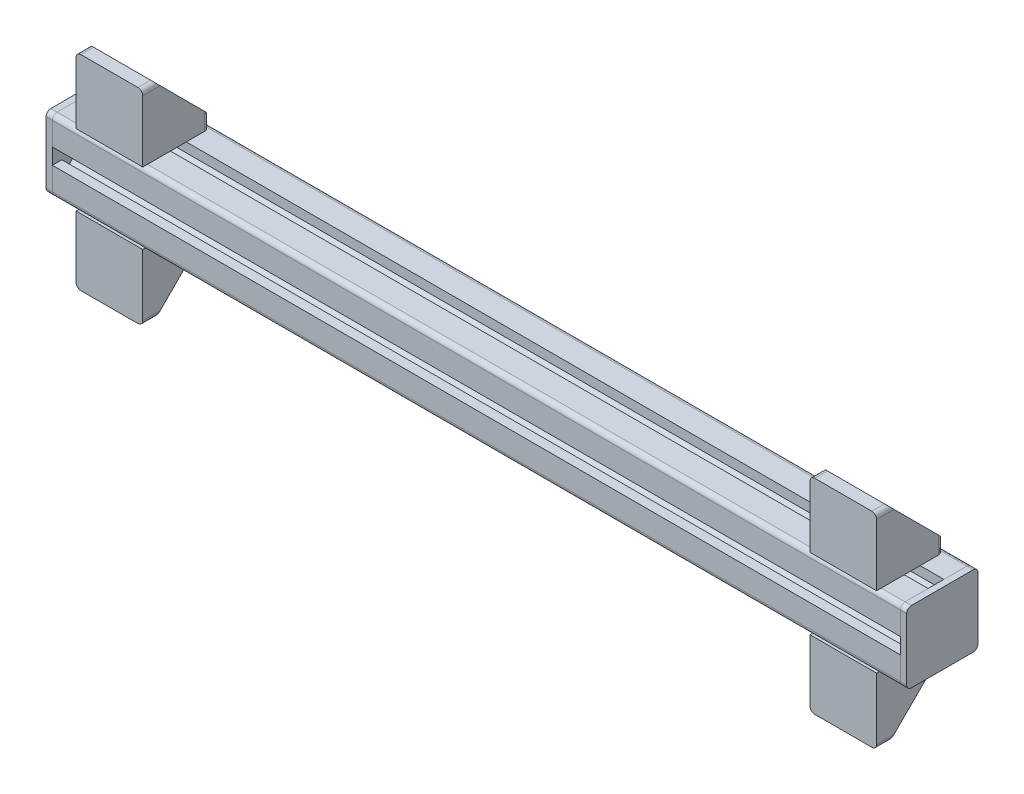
ISO-10303-21;
HEADER;
FILE_DESCRIPTION(('STEP AP214'),'2;1');
FILE_NAME('part.step','',(''),(''),'','','');
FILE_SCHEMA(('AUTOMOTIVE_DESIGN { 1 0 10303 214 1 1 1 1 }'));
ENDSEC;
DATA;
#1=APPLICATION_CONTEXT('core data for automotive mechanical design processes');
#2=APPLICATION_PROTOCOL_DEFINITION('international standard','automotive_design',2000,#1);
#3=PRODUCT_CONTEXT('',#1,'mechanical');
#4=PRODUCT('Part','Part','',(#3));
#5=PRODUCT_RELATED_PRODUCT_CATEGORY('part','',(#4));
#6=PRODUCT_DEFINITION_FORMATION('','',#4);
#7=PRODUCT_DEFINITION_CONTEXT('part definition',#1,'design');
#8=PRODUCT_DEFINITION('design','',#6,#7);
#9=PRODUCT_DEFINITION_SHAPE('','',#8);
#10=(LENGTH_UNIT() NAMED_UNIT(*) SI_UNIT(.MILLI.,.METRE.));
#11=(NAMED_UNIT(*) PLANE_ANGLE_UNIT() SI_UNIT($,.RADIAN.));
#12=(NAMED_UNIT(*) SI_UNIT($,.STERADIAN.) SOLID_ANGLE_UNIT());
#13=UNCERTAINTY_MEASURE_WITH_UNIT(LENGTH_MEASURE(1.E-05),#10,'distance_accuracy_value','');
#14=(GEOMETRIC_REPRESENTATION_CONTEXT(3) GLOBAL_UNCERTAINTY_ASSIGNED_CONTEXT((#13)) GLOBAL_UNIT_ASSIGNED_CONTEXT((#10,
#11,#12)) REPRESENTATION_CONTEXT('',''));
#15=CARTESIAN_POINT('',(0.,0.,0.));
#16=DIRECTION('',(0.,0.,1.));
#17=DIRECTION('',(1.,0.,0.));
#18=AXIS2_PLACEMENT_3D('',#15,#16,#17);
#19=CARTESIAN_POINT('',(-252.5,-64.5000000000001,14.5));
#20=DIRECTION('',(0.,1.,0.));
#21=DIRECTION('',(0.,0.,1.));
#22=AXIS2_PLACEMENT_3D('',#19,#20,#21);
#23=PLANE('',#22);
#24=DIRECTION('',(1.,0.,0.));
#25=VECTOR('',#24,1.);
#26=CARTESIAN_POINT('',(-252.5,-64.5000000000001,22.5));
#27=LINE('',#26,#25);
#28=CARTESIAN_POINT('',(-249.5,-64.5000000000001,22.5));
#29=VERTEX_POINT('',#28);
#30=CARTESIAN_POINT('',(-213.5,-64.5000000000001,22.5));
#31=VERTEX_POINT('',#30);
#32=EDGE_CURVE('E124',#29,#31,#27,.T.);
#33=ORIENTED_EDGE('',*,*,#32,.F.);
#34=DIRECTION('',(0.,0.,-1.));
#35=VECTOR('',#34,1.);
#36=CARTESIAN_POINT('',(-249.5,-64.5000000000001,14.5));
#37=LINE('',#36,#35);
#38=CARTESIAN_POINT('',(-249.5,-64.5000000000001,14.5));
#39=VERTEX_POINT('',#38);
#40=EDGE_CURVE('E157',#39,#29,#37,.F.);
#41=ORIENTED_EDGE('',*,*,#40,.F.);
#42=DIRECTION('',(1.,0.,0.));
#43=VECTOR('',#42,1.);
#44=CARTESIAN_POINT('',(-252.5,-64.5000000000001,14.5));
#45=LINE('',#44,#43);
#46=CARTESIAN_POINT('',(-213.5,-64.5000000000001,14.5));
#47=VERTEX_POINT('',#46);
#48=EDGE_CURVE('E154',#39,#47,#45,.T.);
#49=ORIENTED_EDGE('',*,*,#48,.T.);
#50=DIRECTION('',(0.,0.,-1.));
#51=VECTOR('',#50,1.);
#52=CARTESIAN_POINT('',(-213.5,-64.5000000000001,14.5));
#53=LINE('',#52,#51);
#54=EDGE_CURVE('E160',#31,#47,#53,.T.);
#55=ORIENTED_EDGE('',*,*,#54,.F.);
#56=EDGE_LOOP('',(#33,#41,#49,#55));
#57=FACE_BOUND('',#56,.T.);
#58=ADVANCED_FACE('F46',(#57),#23,.F.);
#59=CARTESIAN_POINT('',(-252.5,-30.5,-19.5));
#60=DIRECTION('',(0.,0.707106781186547,0.707106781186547));
#61=DIRECTION('',(0.,-0.707106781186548,0.707106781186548));
#62=AXIS2_PLACEMENT_3D('',#59,#60,#61);
#63=PLANE('',#62);
#64=ORIENTED_EDGE('',*,*,#48,.F.);
#65=CARTESIAN_POINT('',(-249.5,-61.5000000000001,11.5));
#66=DIRECTION('',(0.,-0.707106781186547,-0.707106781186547));
#67=DIRECTION('',(0.,0.707106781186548,-0.707106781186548));
#68=AXIS2_PLACEMENT_3D('',#65,#66,#67);
#69=ELLIPSE('',#68,4.24264068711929,3.);
#70=CARTESIAN_POINT('',(-252.5,-61.5000000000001,11.5));
#71=VERTEX_POINT('',#70);
#72=EDGE_CURVE('E169',#71,#39,#69,.F.);
#73=ORIENTED_EDGE('',*,*,#72,.F.);
#74=DIRECTION('',(0.,0.707106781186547,-0.707106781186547));
#75=VECTOR('',#74,1.);
#76=CARTESIAN_POINT('',(-252.5,-30.5,-19.5));
#77=LINE('',#76,#75);
#78=CARTESIAN_POINT('',(-252.5,-33.5,-16.5));
#79=VERTEX_POINT('',#78);
#80=EDGE_CURVE('E136',#71,#79,#77,.T.);
#81=ORIENTED_EDGE('',*,*,#80,.T.);
#82=CARTESIAN_POINT('',(-249.5,-33.5,-16.5));
#83=DIRECTION('',(0.,-0.707106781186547,-0.707106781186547));
#84=DIRECTION('',(0.,0.707106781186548,-0.707106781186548));
#85=AXIS2_PLACEMENT_3D('',#82,#83,#84);
#86=ELLIPSE('',#85,4.24264068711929,3.);
#87=CARTESIAN_POINT('',(-249.5,-30.5,-19.5));
#88=VERTEX_POINT('',#87);
#89=EDGE_CURVE('E163',#88,#79,#86,.F.);
#90=ORIENTED_EDGE('',*,*,#89,.F.);
#91=DIRECTION('',(1.,0.,0.));
#92=VECTOR('',#91,1.);
#93=CARTESIAN_POINT('',(-252.5,-30.5,-19.5));
#94=LINE('',#93,#92);
#95=CARTESIAN_POINT('',(-213.5,-30.5,-19.5));
#96=VERTEX_POINT('',#95);
#97=EDGE_CURVE('E151',#88,#96,#94,.T.);
#98=ORIENTED_EDGE('',*,*,#97,.T.);
#99=CARTESIAN_POINT('',(-213.5,-33.5,-16.5));
#100=DIRECTION('',(0.,-0.707106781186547,-0.707106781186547));
#101=DIRECTION('',(0.,-0.707106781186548,0.707106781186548));
#102=AXIS2_PLACEMENT_3D('',#99,#100,#101);
#103=ELLIPSE('',#102,4.24264068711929,3.);
#104=CARTESIAN_POINT('',(-210.5,-33.5,-16.5));
#105=VERTEX_POINT('',#104);
#106=EDGE_CURVE('E166',#105,#96,#103,.F.);
#107=ORIENTED_EDGE('',*,*,#106,.F.);
#108=DIRECTION('',(0.,0.707106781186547,-0.707106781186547));
#109=VECTOR('',#108,1.);
#110=CARTESIAN_POINT('',(-210.5,-30.5,-19.5));
#111=LINE('',#110,#109);
#112=CARTESIAN_POINT('',(-210.5,-61.5000000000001,11.5));
#113=VERTEX_POINT('',#112);
#114=EDGE_CURVE('E141',#113,#105,#111,.T.);
#115=ORIENTED_EDGE('',*,*,#114,.F.);
#116=CARTESIAN_POINT('',(-213.5,-61.5000000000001,11.5));
#117=DIRECTION('',(0.,-0.707106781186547,-0.707106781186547));
#118=DIRECTION('',(0.,-0.707106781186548,0.707106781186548));
#119=AXIS2_PLACEMENT_3D('',#116,#117,#118);
#120=ELLIPSE('',#119,4.24264068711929,3.);
#121=EDGE_CURVE('E171',#47,#113,#120,.F.);
#122=ORIENTED_EDGE('',*,*,#121,.F.);
#123=EDGE_LOOP('',(#64,#73,#81,#90,#98,#107,#115,#122));
#124=FACE_BOUND('',#123,.T.);
#125=ADVANCED_FACE('F199',(#124),#63,.F.);
#126=CARTESIAN_POINT('',(-252.5,-30.5,-19.5));
#127=DIRECTION('',(0.,0.,1.));
#128=DIRECTION('',(-1.,0.,0.));
#129=AXIS2_PLACEMENT_3D('',#126,#127,#128);
#130=PLANE('',#129);
#131=ORIENTED_EDGE('',*,*,#97,.F.);
#132=DIRECTION('',(0.,1.,0.));
#133=VECTOR('',#132,1.);
#134=CARTESIAN_POINT('',(-249.5,-30.5,-19.5));
#135=LINE('',#134,#133);
#136=CARTESIAN_POINT('',(-249.5,-22.5,-19.5));
#137=VERTEX_POINT('',#136);
#138=EDGE_CURVE('E185',#137,#88,#135,.F.);
#139=ORIENTED_EDGE('',*,*,#138,.F.);
#140=DIRECTION('',(1.,0.,0.));
#141=VECTOR('',#140,1.);
#142=CARTESIAN_POINT('',(-252.5,-22.5,-19.5));
#143=LINE('',#142,#141);
#144=CARTESIAN_POINT('',(-213.5,-22.5,-19.5));
#145=VERTEX_POINT('',#144);
#146=EDGE_CURVE('E133',#137,#145,#143,.T.);
#147=ORIENTED_EDGE('',*,*,#146,.T.);
#148=DIRECTION('',(0.,1.,0.));
#149=VECTOR('',#148,1.);
#150=CARTESIAN_POINT('',(-213.5,-22.5,-19.5));
#151=LINE('',#150,#149);
#152=EDGE_CURVE('E187',#96,#145,#151,.T.);
#153=ORIENTED_EDGE('',*,*,#152,.F.);
#154=EDGE_LOOP('',(#131,#139,#147,#153));
#155=FACE_BOUND('',#154,.T.);
#156=ADVANCED_FACE('F194',(#155),#130,.F.);
#157=CARTESIAN_POINT('',(-252.5,-22.5,22.5));
#158=DIRECTION('',(0.,-1.,0.));
#159=DIRECTION('',(0.,0.,-1.));
#160=AXIS2_PLACEMENT_3D('',#157,#158,#159);
#161=PLANE('',#160);
#162=ORIENTED_EDGE('',*,*,#146,.F.);
#163=CARTESIAN_POINT('',(-249.5,-22.5,-16.5));
#164=DIRECTION('',(0.,1.,0.));
#165=DIRECTION('',(0.,0.,-1.));
#166=AXIS2_PLACEMENT_3D('',#163,#164,#165);
#167=CIRCLE('',#166,3.);
#168=CARTESIAN_POINT('',(-252.5,-22.5,-16.5));
#169=VERTEX_POINT('',#168);
#170=EDGE_CURVE('E54',#169,#137,#167,.F.);
#171=ORIENTED_EDGE('',*,*,#170,.F.);
#172=DIRECTION('',(0.,0.,1.));
#173=VECTOR('',#172,1.);
#174=CARTESIAN_POINT('',(-252.5,-22.5,22.5));
#175=LINE('',#174,#173);
#176=CARTESIAN_POINT('',(-252.5,-22.5,22.5));
#177=VERTEX_POINT('',#176);
#178=EDGE_CURVE('E119',#169,#177,#175,.T.);
#179=ORIENTED_EDGE('',*,*,#178,.T.);
#180=DIRECTION('',(1.,0.,0.));
#181=VECTOR('',#180,1.);
#182=CARTESIAN_POINT('',(-252.5,-22.5,22.5));
#183=LINE('',#182,#181);
#184=CARTESIAN_POINT('',(-210.5,-22.5,22.5));
#185=VERTEX_POINT('',#184);
#186=EDGE_CURVE('E127',#177,#185,#183,.T.);
#187=ORIENTED_EDGE('',*,*,#186,.T.);
#188=DIRECTION('',(0.,0.,1.));
#189=VECTOR('',#188,1.);
#190=CARTESIAN_POINT('',(-210.5,-22.5,22.5));
#191=LINE('',#190,#189);
#192=CARTESIAN_POINT('',(-210.5,-22.5,-16.5));
#193=VERTEX_POINT('',#192);
#194=EDGE_CURVE('E144',#193,#185,#191,.T.);
#195=ORIENTED_EDGE('',*,*,#194,.F.);
#196=CARTESIAN_POINT('',(-213.5,-22.5,-16.5));
#197=DIRECTION('',(0.,1.,0.));
#198=DIRECTION('',(0.,0.,-1.));
#199=AXIS2_PLACEMENT_3D('',#196,#197,#198);
#200=CIRCLE('',#199,3.);
#201=EDGE_CURVE('E12',#145,#193,#200,.F.);
#202=ORIENTED_EDGE('',*,*,#201,.F.);
#203=EDGE_LOOP('',(#162,#171,#179,#187,#195,#202));
#204=FACE_BOUND('',#203,.T.);
#205=ADVANCED_FACE('F135',(#204),#161,.F.);
#206=CARTESIAN_POINT('',(-252.5,-64.5000000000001,22.5));
#207=DIRECTION('',(0.,0.,-1.));
#208=DIRECTION('',(1.,0.,0.));
#209=AXIS2_PLACEMENT_3D('',#206,#207,#208);
#210=PLANE('',#209);
#211=DIRECTION('',(0.,-1.,0.));
#212=VECTOR('',#211,1.);
#213=CARTESIAN_POINT('',(-210.5,-64.5000000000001,22.5));
#214=LINE('',#213,#212);
#215=CARTESIAN_POINT('',(-210.5,-61.5000000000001,22.5));
#216=VERTEX_POINT('',#215);
#217=EDGE_CURVE('E131',#185,#216,#214,.T.);
#218=ORIENTED_EDGE('',*,*,#217,.F.);
#219=ORIENTED_EDGE('',*,*,#186,.F.);
#220=DIRECTION('',(0.,-1.,0.));
#221=VECTOR('',#220,1.);
#222=CARTESIAN_POINT('',(-252.5,-64.5000000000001,22.5));
#223=LINE('',#222,#221);
#224=CARTESIAN_POINT('',(-252.5,-61.5000000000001,22.5));
#225=VERTEX_POINT('',#224);
#226=EDGE_CURVE('E115',#177,#225,#223,.T.);
#227=ORIENTED_EDGE('',*,*,#226,.T.);
#228=CARTESIAN_POINT('',(-249.5,-61.5000000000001,22.5));
#229=DIRECTION('',(0.,0.,1.));
#230=DIRECTION('',(1.,0.,0.));
#231=AXIS2_PLACEMENT_3D('',#228,#229,#230);
#232=CIRCLE('',#231,3.);
#233=EDGE_CURVE('E178',#29,#225,#232,.F.);
#234=ORIENTED_EDGE('',*,*,#233,.F.);
#235=ORIENTED_EDGE('',*,*,#32,.T.);
#236=CARTESIAN_POINT('',(-213.5,-61.5000000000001,22.5));
#237=DIRECTION('',(0.,0.,1.));
#238=DIRECTION('',(1.,0.,0.));
#239=AXIS2_PLACEMENT_3D('',#236,#237,#238);
#240=CIRCLE('',#239,3.);
#241=EDGE_CURVE('E180',#216,#31,#240,.F.);
#242=ORIENTED_EDGE('',*,*,#241,.F.);
#243=EDGE_LOOP('',(#218,#219,#227,#234,#235,#242));
#244=FACE_BOUND('',#243,.T.);
#245=ADVANCED_FACE('F128',(#244),#210,.F.);
#246=CARTESIAN_POINT('',(-252.5,0.,0.));
#247=DIRECTION('',(1.,0.,0.));
#248=DIRECTION('',(0.,0.,1.));
#249=AXIS2_PLACEMENT_3D('',#246,#247,#248);
#250=PLANE('',#249);
#251=ORIENTED_EDGE('',*,*,#226,.F.);
#252=ORIENTED_EDGE('',*,*,#178,.F.);
#253=DIRECTION('',(0.,1.,0.));
#254=VECTOR('',#253,1.);
#255=CARTESIAN_POINT('',(-252.5,0.,-16.5));
#256=LINE('',#255,#254);
#257=EDGE_CURVE('E182',#79,#169,#256,.T.);
#258=ORIENTED_EDGE('',*,*,#257,.F.);
#259=ORIENTED_EDGE('',*,*,#80,.F.);
#260=DIRECTION('',(0.,0.,-1.));
#261=VECTOR('',#260,1.);
#262=CARTESIAN_POINT('',(-252.5,-61.5000000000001,0.));
#263=LINE('',#262,#261);
#264=EDGE_CURVE('E121',#225,#71,#263,.T.);
#265=ORIENTED_EDGE('',*,*,#264,.F.);
#266=EDGE_LOOP('',(#251,#252,#258,#259,#265));
#267=FACE_BOUND('',#266,.T.);
#268=ADVANCED_FACE('F117',(#267),#250,.F.);
#269=CARTESIAN_POINT('',(-210.5,0.,0.));
#270=DIRECTION('',(1.,0.,0.));
#271=DIRECTION('',(0.,0.,1.));
#272=AXIS2_PLACEMENT_3D('',#269,#270,#271);
#273=PLANE('',#272);
#274=ORIENTED_EDGE('',*,*,#114,.T.);
#275=DIRECTION('',(0.,1.,0.));
#276=VECTOR('',#275,1.);
#277=CARTESIAN_POINT('',(-210.5,-30.5,-16.5));
#278=LINE('',#277,#276);
#279=EDGE_CURVE('E174',#193,#105,#278,.F.);
#280=ORIENTED_EDGE('',*,*,#279,.F.);
#281=ORIENTED_EDGE('',*,*,#194,.T.);
#282=ORIENTED_EDGE('',*,*,#217,.T.);
#283=DIRECTION('',(0.,0.,-1.));
#284=VECTOR('',#283,1.);
#285=CARTESIAN_POINT('',(-210.5,-61.5000000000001,22.5));
#286=LINE('',#285,#284);
#287=EDGE_CURVE('E176',#113,#216,#286,.F.);
#288=ORIENTED_EDGE('',*,*,#287,.F.);
#289=EDGE_LOOP('',(#274,#280,#281,#282,#288));
#290=FACE_BOUND('',#289,.T.);
#291=ADVANCED_FACE('F210',(#290),#273,.T.);
#292=CARTESIAN_POINT('',(-213.5,-61.5000000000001,14.5));
#293=DIRECTION('',(0.,0.,1.));
#294=DIRECTION('',(-1.,0.,0.));
#295=AXIS2_PLACEMENT_3D('',#292,#293,#294);
#296=CYLINDRICAL_SURFACE('',#295,3.);
#297=ORIENTED_EDGE('',*,*,#241,.T.);
#298=ORIENTED_EDGE('',*,*,#54,.T.);
#299=ORIENTED_EDGE('',*,*,#121,.T.);
#300=ORIENTED_EDGE('',*,*,#287,.T.);
#301=EDGE_LOOP('',(#297,#298,#299,#300));
#302=FACE_BOUND('',#301,.T.);
#303=ADVANCED_FACE('F207',(#302),#296,.T.);
#304=CARTESIAN_POINT('',(-249.5,-61.5000000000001,0.));
#305=DIRECTION('',(0.,0.,-1.));
#306=DIRECTION('',(1.,0.,0.));
#307=AXIS2_PLACEMENT_3D('',#304,#305,#306);
#308=CYLINDRICAL_SURFACE('',#307,3.);
#309=ORIENTED_EDGE('',*,*,#233,.T.);
#310=ORIENTED_EDGE('',*,*,#264,.T.);
#311=ORIENTED_EDGE('',*,*,#72,.T.);
#312=ORIENTED_EDGE('',*,*,#40,.T.);
#313=EDGE_LOOP('',(#309,#310,#311,#312));
#314=FACE_BOUND('',#313,.T.);
#315=ADVANCED_FACE('F202',(#314),#308,.T.);
#316=CARTESIAN_POINT('',(-213.5,-30.5,-16.5));
#317=DIRECTION('',(0.,-1.,0.));
#318=DIRECTION('',(0.,0.,-1.));
#319=AXIS2_PLACEMENT_3D('',#316,#317,#318);
#320=CYLINDRICAL_SURFACE('',#319,3.);
#321=ORIENTED_EDGE('',*,*,#106,.T.);
#322=ORIENTED_EDGE('',*,*,#152,.T.);
#323=ORIENTED_EDGE('',*,*,#201,.T.);
#324=ORIENTED_EDGE('',*,*,#279,.T.);
#325=EDGE_LOOP('',(#321,#322,#323,#324));
#326=FACE_BOUND('',#325,.T.);
#327=ADVANCED_FACE('F189',(#326),#320,.T.);
#328=CARTESIAN_POINT('',(-249.5,0.,-16.5));
#329=DIRECTION('',(0.,1.,0.));
#330=DIRECTION('',(0.,0.,1.));
#331=AXIS2_PLACEMENT_3D('',#328,#329,#330);
#332=CYLINDRICAL_SURFACE('',#331,3.);
#333=ORIENTED_EDGE('',*,*,#89,.T.);
#334=ORIENTED_EDGE('',*,*,#257,.T.);
#335=ORIENTED_EDGE('',*,*,#170,.T.);
#336=ORIENTED_EDGE('',*,*,#138,.T.);
#337=EDGE_LOOP('',(#333,#334,#335,#336));
#338=FACE_BOUND('',#337,.T.);
#339=ADVANCED_FACE('F48',(#338),#332,.T.);
#340=CLOSED_SHELL('',(#58,#125,#156,#205,#245,#268,#291,#303,#315,#327,#339));
#341=MANIFOLD_SOLID_BREP('B2',#340);
#342=CARTESIAN_POINT('',(-252.5,30.5,-19.5));
#343=DIRECTION('',(0.,0.,1.));
#344=DIRECTION('',(-1.,0.,0.));
#345=AXIS2_PLACEMENT_3D('',#342,#343,#344);
#346=PLANE('',#345);
#347=DIRECTION('',(1.,0.,0.));
#348=VECTOR('',#347,1.);
#349=CARTESIAN_POINT('',(-252.5,22.5,-19.5));
#350=LINE('',#349,#348);
#351=CARTESIAN_POINT('',(-249.5,22.5,-19.5));
#352=VERTEX_POINT('',#351);
#353=CARTESIAN_POINT('',(-213.5,22.5,-19.5));
#354=VERTEX_POINT('',#353);
#355=EDGE_CURVE('E388',#352,#354,#350,.T.);
#356=ORIENTED_EDGE('',*,*,#355,.F.);
#357=DIRECTION('',(0.,1.,0.));
#358=VECTOR('',#357,1.);
#359=CARTESIAN_POINT('',(-249.5,30.5,-19.5));
#360=LINE('',#359,#358);
#361=CARTESIAN_POINT('',(-249.5,30.5,-19.5));
#362=VERTEX_POINT('',#361);
#363=EDGE_CURVE('E421',#362,#352,#360,.F.);
#364=ORIENTED_EDGE('',*,*,#363,.F.);
#365=DIRECTION('',(1.,0.,0.));
#366=VECTOR('',#365,1.);
#367=CARTESIAN_POINT('',(-252.5,30.5,-19.5));
#368=LINE('',#367,#366);
#369=CARTESIAN_POINT('',(-213.5,30.5,-19.5));
#370=VERTEX_POINT('',#369);
#371=EDGE_CURVE('E418',#362,#370,#368,.T.);
#372=ORIENTED_EDGE('',*,*,#371,.T.);
#373=DIRECTION('',(0.,1.,0.));
#374=VECTOR('',#373,1.);
#375=CARTESIAN_POINT('',(-213.5,30.5,-19.5));
#376=LINE('',#375,#374);
#377=EDGE_CURVE('E424',#354,#370,#376,.T.);
#378=ORIENTED_EDGE('',*,*,#377,.F.);
#379=EDGE_LOOP('',(#356,#364,#372,#378));
#380=FACE_BOUND('',#379,.T.);
#381=ADVANCED_FACE('F310',(#380),#346,.F.);
#382=CARTESIAN_POINT('',(-252.5,64.5,14.5));
#383=DIRECTION('',(0.,-0.707106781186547,0.707106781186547));
#384=DIRECTION('',(0.,-0.707106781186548,-0.707106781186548));
#385=AXIS2_PLACEMENT_3D('',#382,#383,#384);
#386=PLANE('',#385);
#387=ORIENTED_EDGE('',*,*,#371,.F.);
#388=CARTESIAN_POINT('',(-249.5,33.5,-16.5));
#389=DIRECTION('',(0.,0.707106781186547,-0.707106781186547));
#390=DIRECTION('',(0.,0.707106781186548,0.707106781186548));
#391=AXIS2_PLACEMENT_3D('',#388,#389,#390);
#392=ELLIPSE('',#391,4.24264068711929,3.);
#393=CARTESIAN_POINT('',(-252.5,33.5,-16.5));
#394=VERTEX_POINT('',#393);
#395=EDGE_CURVE('E433',#394,#362,#392,.F.);
#396=ORIENTED_EDGE('',*,*,#395,.F.);
#397=DIRECTION('',(0.,0.707106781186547,0.707106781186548));
#398=VECTOR('',#397,1.);
#399=CARTESIAN_POINT('',(-252.5,64.5,14.5));
#400=LINE('',#399,#398);
#401=CARTESIAN_POINT('',(-252.5,61.5,11.5));
#402=VERTEX_POINT('',#401);
#403=EDGE_CURVE('E400',#394,#402,#400,.T.);
#404=ORIENTED_EDGE('',*,*,#403,.T.);
#405=CARTESIAN_POINT('',(-249.5,61.5,11.5));
#406=DIRECTION('',(0.,0.707106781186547,-0.707106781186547));
#407=DIRECTION('',(0.,0.707106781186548,0.707106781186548));
#408=AXIS2_PLACEMENT_3D('',#405,#406,#407);
#409=ELLIPSE('',#408,4.24264068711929,3.);
#410=CARTESIAN_POINT('',(-249.5,64.5,14.5));
#411=VERTEX_POINT('',#410);
#412=EDGE_CURVE('E427',#411,#402,#409,.F.);
#413=ORIENTED_EDGE('',*,*,#412,.F.);
#414=DIRECTION('',(1.,0.,0.));
#415=VECTOR('',#414,1.);
#416=CARTESIAN_POINT('',(-252.5,64.5,14.5));
#417=LINE('',#416,#415);
#418=CARTESIAN_POINT('',(-213.5,64.5,14.5));
#419=VERTEX_POINT('',#418);
#420=EDGE_CURVE('E415',#411,#419,#417,.T.);
#421=ORIENTED_EDGE('',*,*,#420,.T.);
#422=CARTESIAN_POINT('',(-213.5,61.5,11.5));
#423=DIRECTION('',(0.,0.707106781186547,-0.707106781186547));
#424=DIRECTION('',(0.,-0.707106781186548,-0.707106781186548));
#425=AXIS2_PLACEMENT_3D('',#422,#423,#424);
#426=ELLIPSE('',#425,4.24264068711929,3.);
#427=CARTESIAN_POINT('',(-210.5,61.5,11.5));
#428=VERTEX_POINT('',#427);
#429=EDGE_CURVE('E430',#428,#419,#426,.F.);
#430=ORIENTED_EDGE('',*,*,#429,.F.);
#431=DIRECTION('',(0.,0.707106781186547,0.707106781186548));
#432=VECTOR('',#431,1.);
#433=CARTESIAN_POINT('',(-210.5,64.5,14.5));
#434=LINE('',#433,#432);
#435=CARTESIAN_POINT('',(-210.5,33.5,-16.5));
#436=VERTEX_POINT('',#435);
#437=EDGE_CURVE('E405',#436,#428,#434,.T.);
#438=ORIENTED_EDGE('',*,*,#437,.F.);
#439=CARTESIAN_POINT('',(-213.5,33.5,-16.5));
#440=DIRECTION('',(0.,0.707106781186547,-0.707106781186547));
#441=DIRECTION('',(0.,-0.707106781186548,-0.707106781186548));
#442=AXIS2_PLACEMENT_3D('',#439,#440,#441);
#443=ELLIPSE('',#442,4.24264068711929,3.);
#444=EDGE_CURVE('E435',#370,#436,#443,.F.);
#445=ORIENTED_EDGE('',*,*,#444,.F.);
#446=EDGE_LOOP('',(#387,#396,#404,#413,#421,#430,#438,#445));
#447=FACE_BOUND('',#446,.T.);
#448=ADVANCED_FACE('F463',(#447),#386,.F.);
#449=CARTESIAN_POINT('',(-252.5,64.5,14.5));
#450=DIRECTION('',(0.,-1.,0.));
#451=DIRECTION('',(0.,0.,-1.));
#452=AXIS2_PLACEMENT_3D('',#449,#450,#451);
#453=PLANE('',#452);
#454=ORIENTED_EDGE('',*,*,#420,.F.);
#455=DIRECTION('',(0.,0.,1.));
#456=VECTOR('',#455,1.);
#457=CARTESIAN_POINT('',(-249.5,64.5,14.5));
#458=LINE('',#457,#456);
#459=CARTESIAN_POINT('',(-249.5,64.5,22.5));
#460=VERTEX_POINT('',#459);
#461=EDGE_CURVE('E449',#460,#411,#458,.F.);
#462=ORIENTED_EDGE('',*,*,#461,.F.);
#463=DIRECTION('',(1.,0.,0.));
#464=VECTOR('',#463,1.);
#465=CARTESIAN_POINT('',(-252.5,64.5,22.5));
#466=LINE('',#465,#464);
#467=CARTESIAN_POINT('',(-213.5,64.5,22.5));
#468=VERTEX_POINT('',#467);
#469=EDGE_CURVE('E397',#460,#468,#466,.T.);
#470=ORIENTED_EDGE('',*,*,#469,.T.);
#471=DIRECTION('',(0.,0.,1.));
#472=VECTOR('',#471,1.);
#473=CARTESIAN_POINT('',(-213.5,64.5,22.5));
#474=LINE('',#473,#472);
#475=EDGE_CURVE('E451',#419,#468,#474,.T.);
#476=ORIENTED_EDGE('',*,*,#475,.F.);
#477=EDGE_LOOP('',(#454,#462,#470,#476));
#478=FACE_BOUND('',#477,.T.);
#479=ADVANCED_FACE('F458',(#478),#453,.F.);
#480=CARTESIAN_POINT('',(-252.5,22.5,22.5));
#481=DIRECTION('',(0.,0.,-1.));
#482=DIRECTION('',(1.,0.,0.));
#483=AXIS2_PLACEMENT_3D('',#480,#481,#482);
#484=PLANE('',#483);
#485=ORIENTED_EDGE('',*,*,#469,.F.);
#486=CARTESIAN_POINT('',(-249.5,61.5,22.5));
#487=DIRECTION('',(0.,0.,1.));
#488=DIRECTION('',(1.,0.,0.));
#489=AXIS2_PLACEMENT_3D('',#486,#487,#488);
#490=CIRCLE('',#489,3.);
#491=CARTESIAN_POINT('',(-252.5,61.5,22.5));
#492=VERTEX_POINT('',#491);
#493=EDGE_CURVE('E318',#492,#460,#490,.F.);
#494=ORIENTED_EDGE('',*,*,#493,.F.);
#495=DIRECTION('',(0.,-1.,0.));
#496=VECTOR('',#495,1.);
#497=CARTESIAN_POINT('',(-252.5,22.5,22.5));
#498=LINE('',#497,#496);
#499=CARTESIAN_POINT('',(-252.5,22.5,22.5));
#500=VERTEX_POINT('',#499);
#501=EDGE_CURVE('E383',#492,#500,#498,.T.);
#502=ORIENTED_EDGE('',*,*,#501,.T.);
#503=DIRECTION('',(1.,0.,0.));
#504=VECTOR('',#503,1.);
#505=CARTESIAN_POINT('',(-252.5,22.5,22.5));
#506=LINE('',#505,#504);
#507=CARTESIAN_POINT('',(-210.5,22.5,22.5));
#508=VERTEX_POINT('',#507);
#509=EDGE_CURVE('E391',#500,#508,#506,.T.);
#510=ORIENTED_EDGE('',*,*,#509,.T.);
#511=DIRECTION('',(0.,-1.,0.));
#512=VECTOR('',#511,1.);
#513=CARTESIAN_POINT('',(-210.5,22.5,22.5));
#514=LINE('',#513,#512);
#515=CARTESIAN_POINT('',(-210.5,61.5,22.5));
#516=VERTEX_POINT('',#515);
#517=EDGE_CURVE('E408',#516,#508,#514,.T.);
#518=ORIENTED_EDGE('',*,*,#517,.F.);
#519=CARTESIAN_POINT('',(-213.5,61.5,22.5));
#520=DIRECTION('',(0.,0.,1.));
#521=DIRECTION('',(1.,0.,0.));
#522=AXIS2_PLACEMENT_3D('',#519,#520,#521);
#523=CIRCLE('',#522,3.);
#524=EDGE_CURVE('E44',#468,#516,#523,.F.);
#525=ORIENTED_EDGE('',*,*,#524,.F.);
#526=EDGE_LOOP('',(#485,#494,#502,#510,#518,#525));
#527=FACE_BOUND('',#526,.T.);
#528=ADVANCED_FACE('F399',(#527),#484,.F.);
#529=CARTESIAN_POINT('',(-252.5,22.5,-19.5));
#530=DIRECTION('',(0.,1.,0.));
#531=DIRECTION('',(0.,0.,1.));
#532=AXIS2_PLACEMENT_3D('',#529,#530,#531);
#533=PLANE('',#532);
#534=DIRECTION('',(0.,0.,-1.));
#535=VECTOR('',#534,1.);
#536=CARTESIAN_POINT('',(-210.5,22.5,-19.5));
#537=LINE('',#536,#535);
#538=CARTESIAN_POINT('',(-210.5,22.5,-16.5));
#539=VERTEX_POINT('',#538);
#540=EDGE_CURVE('E395',#508,#539,#537,.T.);
#541=ORIENTED_EDGE('',*,*,#540,.F.);
#542=ORIENTED_EDGE('',*,*,#509,.F.);
#543=DIRECTION('',(0.,0.,-1.));
#544=VECTOR('',#543,1.);
#545=CARTESIAN_POINT('',(-252.5,22.5,-19.5));
#546=LINE('',#545,#544);
#547=CARTESIAN_POINT('',(-252.5,22.5,-16.5));
#548=VERTEX_POINT('',#547);
#549=EDGE_CURVE('E379',#500,#548,#546,.T.);
#550=ORIENTED_EDGE('',*,*,#549,.T.);
#551=CARTESIAN_POINT('',(-249.5,22.5,-16.5));
#552=DIRECTION('',(0.,-1.,0.));
#553=DIRECTION('',(0.,0.,1.));
#554=AXIS2_PLACEMENT_3D('',#551,#552,#553);
#555=CIRCLE('',#554,3.);
#556=EDGE_CURVE('E442',#352,#548,#555,.F.);
#557=ORIENTED_EDGE('',*,*,#556,.F.);
#558=ORIENTED_EDGE('',*,*,#355,.T.);
#559=CARTESIAN_POINT('',(-213.5,22.5,-16.5));
#560=DIRECTION('',(0.,-1.,0.));
#561=DIRECTION('',(0.,0.,1.));
#562=AXIS2_PLACEMENT_3D('',#559,#560,#561);
#563=CIRCLE('',#562,3.);
#564=EDGE_CURVE('E444',#539,#354,#563,.F.);
#565=ORIENTED_EDGE('',*,*,#564,.F.);
#566=EDGE_LOOP('',(#541,#542,#550,#557,#558,#565));
#567=FACE_BOUND('',#566,.T.);
#568=ADVANCED_FACE('F392',(#567),#533,.F.);
#569=CARTESIAN_POINT('',(-252.5,0.,0.));
#570=DIRECTION('',(1.,0.,0.));
#571=DIRECTION('',(0.,0.,1.));
#572=AXIS2_PLACEMENT_3D('',#569,#570,#571);
#573=PLANE('',#572);
#574=ORIENTED_EDGE('',*,*,#549,.F.);
#575=ORIENTED_EDGE('',*,*,#501,.F.);
#576=DIRECTION('',(0.,0.,1.));
#577=VECTOR('',#576,1.);
#578=CARTESIAN_POINT('',(-252.5,61.5,0.));
#579=LINE('',#578,#577);
#580=EDGE_CURVE('E446',#402,#492,#579,.T.);
#581=ORIENTED_EDGE('',*,*,#580,.F.);
#582=ORIENTED_EDGE('',*,*,#403,.F.);
#583=DIRECTION('',(0.,1.,0.));
#584=VECTOR('',#583,1.);
#585=CARTESIAN_POINT('',(-252.5,0.,-16.5));
#586=LINE('',#585,#584);
#587=EDGE_CURVE('E385',#548,#394,#586,.T.);
#588=ORIENTED_EDGE('',*,*,#587,.F.);
#589=EDGE_LOOP('',(#574,#575,#581,#582,#588));
#590=FACE_BOUND('',#589,.T.);
#591=ADVANCED_FACE('F381',(#590),#573,.F.);
#592=CARTESIAN_POINT('',(-210.5,0.,0.));
#593=DIRECTION('',(1.,0.,0.));
#594=DIRECTION('',(0.,0.,1.));
#595=AXIS2_PLACEMENT_3D('',#592,#593,#594);
#596=PLANE('',#595);
#597=ORIENTED_EDGE('',*,*,#437,.T.);
#598=DIRECTION('',(0.,0.,1.));
#599=VECTOR('',#598,1.);
#600=CARTESIAN_POINT('',(-210.5,61.5,14.5));
#601=LINE('',#600,#599);
#602=EDGE_CURVE('E438',#516,#428,#601,.F.);
#603=ORIENTED_EDGE('',*,*,#602,.F.);
#604=ORIENTED_EDGE('',*,*,#517,.T.);
#605=ORIENTED_EDGE('',*,*,#540,.T.);
#606=DIRECTION('',(0.,1.,0.));
#607=VECTOR('',#606,1.);
#608=CARTESIAN_POINT('',(-210.5,22.5,-16.5));
#609=LINE('',#608,#607);
#610=EDGE_CURVE('E440',#436,#539,#609,.F.);
#611=ORIENTED_EDGE('',*,*,#610,.F.);
#612=EDGE_LOOP('',(#597,#603,#604,#605,#611));
#613=FACE_BOUND('',#612,.T.);
#614=ADVANCED_FACE('F474',(#613),#596,.T.);
#615=CARTESIAN_POINT('',(-213.5,30.5,-16.5));
#616=DIRECTION('',(0.,-1.,0.));
#617=DIRECTION('',(0.,0.,-1.));
#618=AXIS2_PLACEMENT_3D('',#615,#616,#617);
#619=CYLINDRICAL_SURFACE('',#618,3.);
#620=ORIENTED_EDGE('',*,*,#564,.T.);
#621=ORIENTED_EDGE('',*,*,#377,.T.);
#622=ORIENTED_EDGE('',*,*,#444,.T.);
#623=ORIENTED_EDGE('',*,*,#610,.T.);
#624=EDGE_LOOP('',(#620,#621,#622,#623));
#625=FACE_BOUND('',#624,.T.);
#626=ADVANCED_FACE('F471',(#625),#619,.T.);
#627=CARTESIAN_POINT('',(-249.5,0.,-16.5));
#628=DIRECTION('',(0.,1.,0.));
#629=DIRECTION('',(0.,0.,1.));
#630=AXIS2_PLACEMENT_3D('',#627,#628,#629);
#631=CYLINDRICAL_SURFACE('',#630,3.);
#632=ORIENTED_EDGE('',*,*,#556,.T.);
#633=ORIENTED_EDGE('',*,*,#587,.T.);
#634=ORIENTED_EDGE('',*,*,#395,.T.);
#635=ORIENTED_EDGE('',*,*,#363,.T.);
#636=EDGE_LOOP('',(#632,#633,#634,#635));
#637=FACE_BOUND('',#636,.T.);
#638=ADVANCED_FACE('F466',(#637),#631,.T.);
#639=CARTESIAN_POINT('',(-213.5,61.5,14.5));
#640=DIRECTION('',(0.,0.,-1.));
#641=DIRECTION('',(1.,0.,0.));
#642=AXIS2_PLACEMENT_3D('',#639,#640,#641);
#643=CYLINDRICAL_SURFACE('',#642,3.);
#644=ORIENTED_EDGE('',*,*,#429,.T.);
#645=ORIENTED_EDGE('',*,*,#475,.T.);
#646=ORIENTED_EDGE('',*,*,#524,.T.);
#647=ORIENTED_EDGE('',*,*,#602,.T.);
#648=EDGE_LOOP('',(#644,#645,#646,#647));
#649=FACE_BOUND('',#648,.T.);
#650=ADVANCED_FACE('F453',(#649),#643,.T.);
#651=CARTESIAN_POINT('',(-249.5,61.5,0.));
#652=DIRECTION('',(0.,0.,1.));
#653=DIRECTION('',(-1.,0.,0.));
#654=AXIS2_PLACEMENT_3D('',#651,#652,#653);
#655=CYLINDRICAL_SURFACE('',#654,3.);
#656=ORIENTED_EDGE('',*,*,#412,.T.);
#657=ORIENTED_EDGE('',*,*,#580,.T.);
#658=ORIENTED_EDGE('',*,*,#493,.T.);
#659=ORIENTED_EDGE('',*,*,#461,.T.);
#660=EDGE_LOOP('',(#656,#657,#658,#659));
#661=FACE_BOUND('',#660,.T.);
#662=ADVANCED_FACE('F312',(#661),#655,.T.);
#663=CLOSED_SHELL('',(#381,#448,#479,#528,#568,#591,#614,#626,#638,#650,#662));
#664=MANIFOLD_SOLID_BREP('B6',#663);
#665=CARTESIAN_POINT('',(-271.5,19.5,19.5));
#666=DIRECTION('',(1.,0.,0.));
#667=DIRECTION('',(0.,0.,1.));
#668=AXIS2_PLACEMENT_3D('',#665,#666,#667);
#669=CYLINDRICAL_SURFACE('',#668,2.99999999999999);
#670=CARTESIAN_POINT('',(-267.5,19.5,19.5));
#671=DIRECTION('',(1.,0.,0.));
#672=DIRECTION('',(0.,0.,-1.));
#673=AXIS2_PLACEMENT_3D('',#670,#671,#672);
#674=CIRCLE('',#673,2.99999999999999);
#675=CARTESIAN_POINT('',(-267.5,22.5,19.5));
#676=VERTEX_POINT('',#675);
#677=CARTESIAN_POINT('',(-267.5,19.5,22.5));
#678=VERTEX_POINT('',#677);
#679=EDGE_CURVE('E670',#676,#678,#674,.T.);
#680=ORIENTED_EDGE('',*,*,#679,.F.);
#681=DIRECTION('',(1.,0.,0.));
#682=VECTOR('',#681,1.);
#683=CARTESIAN_POINT('',(-271.5,22.5,19.5));
#684=LINE('',#683,#682);
#685=CARTESIAN_POINT('',(-271.5,22.5,19.5));
#686=VERTEX_POINT('',#685);
#687=EDGE_CURVE('E669',#686,#676,#684,.T.);
#688=ORIENTED_EDGE('',*,*,#687,.F.);
#689=CARTESIAN_POINT('',(-271.5,19.5,19.5));
#690=DIRECTION('',(1.,0.,0.));
#691=DIRECTION('',(0.,0.,-1.));
#692=AXIS2_PLACEMENT_3D('',#689,#690,#691);
#693=CIRCLE('',#692,2.99999999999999);
#694=CARTESIAN_POINT('',(-271.5,19.5,22.5));
#695=VERTEX_POINT('',#694);
#696=EDGE_CURVE('E688',#686,#695,#693,.T.);
#697=ORIENTED_EDGE('',*,*,#696,.T.);
#698=DIRECTION('',(1.,0.,0.));
#699=VECTOR('',#698,1.);
#700=CARTESIAN_POINT('',(-271.5,19.5,22.5));
#701=LINE('',#700,#699);
#702=EDGE_CURVE('E308',#695,#678,#701,.T.);
#703=ORIENTED_EDGE('',*,*,#702,.T.);
#704=EDGE_LOOP('',(#680,#688,#697,#703));
#705=FACE_BOUND('',#704,.T.);
#706=ADVANCED_FACE('F574',(#705),#669,.T.);
#707=CARTESIAN_POINT('',(-271.5,19.5,22.5));
#708=DIRECTION('',(0.,0.,-1.));
#709=DIRECTION('',(1.,0.,0.));
#710=AXIS2_PLACEMENT_3D('',#707,#708,#709);
#711=PLANE('',#710);
#712=DIRECTION('',(0.,-1.,0.));
#713=VECTOR('',#712,1.);
#714=CARTESIAN_POINT('',(-267.5,19.5,22.5));
#715=LINE('',#714,#713);
#716=CARTESIAN_POINT('',(-267.5,-19.5,22.5));
#717=VERTEX_POINT('',#716);
#718=EDGE_CURVE('E672',#678,#717,#715,.T.);
#719=ORIENTED_EDGE('',*,*,#718,.F.);
#720=ORIENTED_EDGE('',*,*,#702,.F.);
#721=DIRECTION('',(0.,-1.,0.));
#722=VECTOR('',#721,1.);
#723=CARTESIAN_POINT('',(-271.5,19.5,22.5));
#724=LINE('',#723,#722);
#725=CARTESIAN_POINT('',(-271.5,-19.5,22.5));
#726=VERTEX_POINT('',#725);
#727=EDGE_CURVE('E628',#695,#726,#724,.T.);
#728=ORIENTED_EDGE('',*,*,#727,.T.);
#729=DIRECTION('',(1.,0.,0.));
#730=VECTOR('',#729,1.);
#731=CARTESIAN_POINT('',(-271.5,-19.5,22.5));
#732=LINE('',#731,#730);
#733=EDGE_CURVE('E582',#726,#717,#732,.T.);
#734=ORIENTED_EDGE('',*,*,#733,.T.);
#735=EDGE_LOOP('',(#719,#720,#728,#734));
#736=FACE_BOUND('',#735,.T.);
#737=ADVANCED_FACE('F700',(#736),#711,.F.);
#738=CARTESIAN_POINT('',(-271.5,-19.5,19.5));
#739=DIRECTION('',(1.,0.,0.));
#740=DIRECTION('',(0.,0.,1.));
#741=AXIS2_PLACEMENT_3D('',#738,#739,#740);
#742=CYLINDRICAL_SURFACE('',#741,3.);
#743=CARTESIAN_POINT('',(-267.5,-19.5,19.5));
#744=DIRECTION('',(1.,0.,0.));
#745=DIRECTION('',(0.,0.,-1.));
#746=AXIS2_PLACEMENT_3D('',#743,#744,#745);
#747=CIRCLE('',#746,3.);
#748=CARTESIAN_POINT('',(-267.5,-22.5,19.5));
#749=VERTEX_POINT('',#748);
#750=EDGE_CURVE('E675',#717,#749,#747,.T.);
#751=ORIENTED_EDGE('',*,*,#750,.F.);
#752=ORIENTED_EDGE('',*,*,#733,.F.);
#753=CARTESIAN_POINT('',(-271.5,-19.5,19.5));
#754=DIRECTION('',(1.,0.,0.));
#755=DIRECTION('',(0.,0.,-1.));
#756=AXIS2_PLACEMENT_3D('',#753,#754,#755);
#757=CIRCLE('',#756,3.);
#758=CARTESIAN_POINT('',(-271.5,-22.5,19.5));
#759=VERTEX_POINT('',#758);
#760=EDGE_CURVE('E709',#726,#759,#757,.T.);
#761=ORIENTED_EDGE('',*,*,#760,.T.);
#762=DIRECTION('',(1.,0.,0.));
#763=VECTOR('',#762,1.);
#764=CARTESIAN_POINT('',(-271.5,-22.5,19.5));
#765=LINE('',#764,#763);
#766=EDGE_CURVE('E695',#759,#749,#765,.T.);
#767=ORIENTED_EDGE('',*,*,#766,.T.);
#768=EDGE_LOOP('',(#751,#752,#761,#767));
#769=FACE_BOUND('',#768,.T.);
#770=ADVANCED_FACE('F719',(#769),#742,.T.);
#771=CARTESIAN_POINT('',(-271.5,-22.5,19.5));
#772=DIRECTION('',(0.,1.,0.));
#773=DIRECTION('',(0.,0.,1.));
#774=AXIS2_PLACEMENT_3D('',#771,#772,#773);
#775=PLANE('',#774);
#776=DIRECTION('',(0.,0.,-1.));
#777=VECTOR('',#776,1.);
#778=CARTESIAN_POINT('',(-267.5,-22.5,19.5));
#779=LINE('',#778,#777);
#780=CARTESIAN_POINT('',(-267.5,-22.5,-19.5000000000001));
#781=VERTEX_POINT('',#780);
#782=EDGE_CURVE('E678',#749,#781,#779,.T.);
#783=ORIENTED_EDGE('',*,*,#782,.F.);
#784=ORIENTED_EDGE('',*,*,#766,.F.);
#785=DIRECTION('',(0.,0.,-1.));
#786=VECTOR('',#785,1.);
#787=CARTESIAN_POINT('',(-271.5,-22.5,19.5));
#788=LINE('',#787,#786);
#789=CARTESIAN_POINT('',(-271.5,-22.5,-19.5000000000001));
#790=VERTEX_POINT('',#789);
#791=EDGE_CURVE('E664',#759,#790,#788,.T.);
#792=ORIENTED_EDGE('',*,*,#791,.T.);
#793=DIRECTION('',(1.,0.,0.));
#794=VECTOR('',#793,1.);
#795=CARTESIAN_POINT('',(-271.5,-22.5,-19.5000000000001));
#796=LINE('',#795,#794);
#797=EDGE_CURVE('E692',#790,#781,#796,.T.);
#798=ORIENTED_EDGE('',*,*,#797,.T.);
#799=EDGE_LOOP('',(#783,#784,#792,#798));
#800=FACE_BOUND('',#799,.T.);
#801=ADVANCED_FACE('F715',(#800),#775,.F.);
#802=CARTESIAN_POINT('',(-271.5,-19.5000000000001,-19.5000000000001));
#803=DIRECTION('',(1.,0.,0.));
#804=DIRECTION('',(0.,0.,1.));
#805=AXIS2_PLACEMENT_3D('',#802,#803,#804);
#806=CYLINDRICAL_SURFACE('',#805,2.99999999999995);
#807=CARTESIAN_POINT('',(-267.5,-19.5000000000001,-19.5000000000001));
#808=DIRECTION('',(1.,0.,0.));
#809=DIRECTION('',(0.,0.,-1.));
#810=AXIS2_PLACEMENT_3D('',#807,#808,#809);
#811=CIRCLE('',#810,2.99999999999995);
#812=CARTESIAN_POINT('',(-267.5,-19.5000000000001,-22.5));
#813=VERTEX_POINT('',#812);
#814=EDGE_CURVE('E681',#781,#813,#811,.T.);
#815=ORIENTED_EDGE('',*,*,#814,.F.);
#816=ORIENTED_EDGE('',*,*,#797,.F.);
#817=CARTESIAN_POINT('',(-271.5,-19.5000000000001,-19.5000000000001));
#818=DIRECTION('',(1.,0.,0.));
#819=DIRECTION('',(0.,0.,-1.));
#820=AXIS2_PLACEMENT_3D('',#817,#818,#819);
#821=CIRCLE('',#820,2.99999999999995);
#822=CARTESIAN_POINT('',(-271.5,-19.5000000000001,-22.5));
#823=VERTEX_POINT('',#822);
#824=EDGE_CURVE('E662',#790,#823,#821,.T.);
#825=ORIENTED_EDGE('',*,*,#824,.T.);
#826=DIRECTION('',(1.,0.,0.));
#827=VECTOR('',#826,1.);
#828=CARTESIAN_POINT('',(-271.5,-19.5000000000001,-22.5));
#829=LINE('',#828,#827);
#830=EDGE_CURVE('E656',#823,#813,#829,.T.);
#831=ORIENTED_EDGE('',*,*,#830,.T.);
#832=EDGE_LOOP('',(#815,#816,#825,#831));
#833=FACE_BOUND('',#832,.T.);
#834=ADVANCED_FACE('F718',(#833),#806,.T.);
#835=CARTESIAN_POINT('',(-271.5,-19.5000000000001,-22.5));
#836=DIRECTION('',(0.,0.,1.));
#837=DIRECTION('',(-1.,0.,0.));
#838=AXIS2_PLACEMENT_3D('',#835,#836,#837);
#839=PLANE('',#838);
#840=DIRECTION('',(0.,1.,0.));
#841=VECTOR('',#840,1.);
#842=CARTESIAN_POINT('',(-267.5,-19.5000000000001,-22.5));
#843=LINE('',#842,#841);
#844=CARTESIAN_POINT('',(-267.5,19.5,-22.5));
#845=VERTEX_POINT('',#844);
#846=EDGE_CURVE('E684',#813,#845,#843,.T.);
#847=ORIENTED_EDGE('',*,*,#846,.F.);
#848=ORIENTED_EDGE('',*,*,#830,.F.);
#849=DIRECTION('',(0.,1.,0.));
#850=VECTOR('',#849,1.);
#851=CARTESIAN_POINT('',(-271.5,-19.5000000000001,-22.5));
#852=LINE('',#851,#850);
#853=CARTESIAN_POINT('',(-271.5,19.5,-22.5));
#854=VERTEX_POINT('',#853);
#855=EDGE_CURVE('E646',#823,#854,#852,.T.);
#856=ORIENTED_EDGE('',*,*,#855,.T.);
#857=DIRECTION('',(1.,0.,0.));
#858=VECTOR('',#857,1.);
#859=CARTESIAN_POINT('',(-271.5,19.5,-22.5));
#860=LINE('',#859,#858);
#861=EDGE_CURVE('E651',#854,#845,#860,.T.);
#862=ORIENTED_EDGE('',*,*,#861,.T.);
#863=EDGE_LOOP('',(#847,#848,#856,#862));
#864=FACE_BOUND('',#863,.T.);
#865=ADVANCED_FACE('F659',(#864),#839,.F.);
#866=CARTESIAN_POINT('',(-271.5,19.5,-19.5));
#867=DIRECTION('',(1.,0.,0.));
#868=DIRECTION('',(0.,0.,1.));
#869=AXIS2_PLACEMENT_3D('',#866,#867,#868);
#870=CYLINDRICAL_SURFACE('',#869,3.);
#871=CARTESIAN_POINT('',(-267.5,19.5,-19.5));
#872=DIRECTION('',(1.,0.,0.));
#873=DIRECTION('',(0.,0.,-1.));
#874=AXIS2_PLACEMENT_3D('',#871,#872,#873);
#875=CIRCLE('',#874,3.);
#876=CARTESIAN_POINT('',(-267.5,22.5,-19.5));
#877=VERTEX_POINT('',#876);
#878=EDGE_CURVE('E653',#845,#877,#875,.T.);
#879=ORIENTED_EDGE('',*,*,#878,.F.);
#880=ORIENTED_EDGE('',*,*,#861,.F.);
#881=CARTESIAN_POINT('',(-271.5,19.5,-19.5));
#882=DIRECTION('',(1.,0.,0.));
#883=DIRECTION('',(0.,0.,-1.));
#884=AXIS2_PLACEMENT_3D('',#881,#882,#883);
#885=CIRCLE('',#884,3.);
#886=CARTESIAN_POINT('',(-271.5,22.5,-19.5));
#887=VERTEX_POINT('',#886);
#888=EDGE_CURVE('E642',#854,#887,#885,.T.);
#889=ORIENTED_EDGE('',*,*,#888,.T.);
#890=DIRECTION('',(1.,0.,0.));
#891=VECTOR('',#890,1.);
#892=CARTESIAN_POINT('',(-271.5,22.5,-19.5));
#893=LINE('',#892,#891);
#894=EDGE_CURVE('E657',#887,#877,#893,.T.);
#895=ORIENTED_EDGE('',*,*,#894,.T.);
#896=EDGE_LOOP('',(#879,#880,#889,#895));
#897=FACE_BOUND('',#896,.T.);
#898=ADVANCED_FACE('F652',(#897),#870,.T.);
#899=CARTESIAN_POINT('',(-271.5,22.5,-19.5));
#900=DIRECTION('',(0.,-1.,0.));
#901=DIRECTION('',(0.,0.,-1.));
#902=AXIS2_PLACEMENT_3D('',#899,#900,#901);
#903=PLANE('',#902);
#904=DIRECTION('',(0.,0.,1.));
#905=VECTOR('',#904,1.);
#906=CARTESIAN_POINT('',(-267.5,22.5,-19.5));
#907=LINE('',#906,#905);
#908=EDGE_CURVE('E616',#877,#676,#907,.T.);
#909=ORIENTED_EDGE('',*,*,#908,.F.);
#910=ORIENTED_EDGE('',*,*,#894,.F.);
#911=DIRECTION('',(0.,0.,1.));
#912=VECTOR('',#911,1.);
#913=CARTESIAN_POINT('',(-271.5,22.5,-19.5));
#914=LINE('',#913,#912);
#915=EDGE_CURVE('E590',#887,#686,#914,.T.);
#916=ORIENTED_EDGE('',*,*,#915,.T.);
#917=ORIENTED_EDGE('',*,*,#687,.T.);
#918=EDGE_LOOP('',(#909,#910,#916,#917));
#919=FACE_BOUND('',#918,.T.);
#920=ADVANCED_FACE('F769',(#919),#903,.F.);
#921=CARTESIAN_POINT('',(-271.5,19.5,19.5));
#922=DIRECTION('',(-1.,0.,0.));
#923=DIRECTION('',(0.,0.,-1.));
#924=AXIS2_PLACEMENT_3D('',#921,#922,#923);
#925=PLANE('',#924);
#926=ORIENTED_EDGE('',*,*,#696,.F.);
#927=ORIENTED_EDGE('',*,*,#915,.F.);
#928=ORIENTED_EDGE('',*,*,#888,.F.);
#929=ORIENTED_EDGE('',*,*,#855,.F.);
#930=ORIENTED_EDGE('',*,*,#824,.F.);
#931=ORIENTED_EDGE('',*,*,#791,.F.);
#932=ORIENTED_EDGE('',*,*,#760,.F.);
#933=ORIENTED_EDGE('',*,*,#727,.F.);
#934=EDGE_LOOP('',(#926,#927,#928,#929,#930,#931,#932,#933));
#935=FACE_BOUND('',#934,.T.);
#936=ADVANCED_FACE('F644',(#935),#925,.T.);
#937=CARTESIAN_POINT('',(-267.5,19.5,19.5));
#938=DIRECTION('',(-1.,0.,0.));
#939=DIRECTION('',(0.,0.,-1.));
#940=AXIS2_PLACEMENT_3D('',#937,#938,#939);
#941=PLANE('',#940);
#942=ORIENTED_EDGE('',*,*,#679,.T.);
#943=ORIENTED_EDGE('',*,*,#718,.T.);
#944=ORIENTED_EDGE('',*,*,#750,.T.);
#945=ORIENTED_EDGE('',*,*,#782,.T.);
#946=ORIENTED_EDGE('',*,*,#814,.T.);
#947=ORIENTED_EDGE('',*,*,#846,.T.);
#948=ORIENTED_EDGE('',*,*,#878,.T.);
#949=ORIENTED_EDGE('',*,*,#908,.T.);
#950=EDGE_LOOP('',(#942,#943,#944,#945,#946,#947,#948,#949));
#951=FACE_BOUND('',#950,.T.);
#952=ADVANCED_FACE('F703',(#951),#941,.F.);
#953=CLOSED_SHELL('',(#706,#737,#770,#801,#834,#865,#898,#920,#936,#952));
#954=MANIFOLD_SOLID_BREP('B38',#953);
#955=CARTESIAN_POINT('',(271.5,19.5,19.5));
#956=DIRECTION('',(-1.,0.,0.));
#957=DIRECTION('',(0.,0.,1.));
#958=AXIS2_PLACEMENT_3D('',#955,#956,#957);
#959=CYLINDRICAL_SURFACE('',#958,2.99999999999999);
#960=CARTESIAN_POINT('',(267.5,19.5,19.5));
#961=DIRECTION('',(1.,0.,0.));
#962=DIRECTION('',(0.,0.,-1.));
#963=AXIS2_PLACEMENT_3D('',#960,#961,#962);
#964=CIRCLE('',#963,2.99999999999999);
#965=CARTESIAN_POINT('',(267.5,22.5,19.5));
#966=VERTEX_POINT('',#965);
#967=CARTESIAN_POINT('',(267.5,19.5,22.5));
#968=VERTEX_POINT('',#967);
#969=EDGE_CURVE('E908',#966,#968,#964,.T.);
#970=ORIENTED_EDGE('',*,*,#969,.T.);
#971=DIRECTION('',(-1.,0.,0.));
#972=VECTOR('',#971,1.);
#973=CARTESIAN_POINT('',(271.5,19.5,22.5));
#974=LINE('',#973,#972);
#975=CARTESIAN_POINT('',(271.5,19.5,22.5));
#976=VERTEX_POINT('',#975);
#977=EDGE_CURVE('E572',#976,#968,#974,.T.);
#978=ORIENTED_EDGE('',*,*,#977,.F.);
#979=CARTESIAN_POINT('',(271.5,19.5,19.5));
#980=DIRECTION('',(1.,0.,0.));
#981=DIRECTION('',(0.,0.,-1.));
#982=AXIS2_PLACEMENT_3D('',#979,#980,#981);
#983=CIRCLE('',#982,2.99999999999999);
#984=CARTESIAN_POINT('',(271.5,22.5,19.5));
#985=VERTEX_POINT('',#984);
#986=EDGE_CURVE('E922',#985,#976,#983,.T.);
#987=ORIENTED_EDGE('',*,*,#986,.F.);
#988=DIRECTION('',(-1.,0.,0.));
#989=VECTOR('',#988,1.);
#990=CARTESIAN_POINT('',(271.5,22.5,19.5));
#991=LINE('',#990,#989);
#992=EDGE_CURVE('E904',#985,#966,#991,.T.);
#993=ORIENTED_EDGE('',*,*,#992,.T.);
#994=EDGE_LOOP('',(#970,#978,#987,#993));
#995=FACE_BOUND('',#994,.T.);
#996=ADVANCED_FACE('F812',(#995),#959,.T.);
#997=CARTESIAN_POINT('',(271.5,19.5,22.5));
#998=DIRECTION('',(0.,0.,-1.));
#999=DIRECTION('',(-1.,0.,0.));
#1000=AXIS2_PLACEMENT_3D('',#997,#998,#999);
#1001=PLANE('',#1000);
#1002=DIRECTION('',(0.,-1.,0.));
#1003=VECTOR('',#1002,1.);
#1004=CARTESIAN_POINT('',(267.5,19.5,22.5));
#1005=LINE('',#1004,#1003);
#1006=CARTESIAN_POINT('',(267.5,-19.5,22.5));
#1007=VERTEX_POINT('',#1006);
#1008=EDGE_CURVE('E911',#968,#1007,#1005,.T.);
#1009=ORIENTED_EDGE('',*,*,#1008,.T.);
#1010=DIRECTION('',(-1.,0.,0.));
#1011=VECTOR('',#1010,1.);
#1012=CARTESIAN_POINT('',(271.5,-19.5,22.5));
#1013=LINE('',#1012,#1011);
#1014=CARTESIAN_POINT('',(271.5,-19.5,22.5));
#1015=VERTEX_POINT('',#1014);
#1016=EDGE_CURVE('E820',#1015,#1007,#1013,.T.);
#1017=ORIENTED_EDGE('',*,*,#1016,.F.);
#1018=DIRECTION('',(0.,-1.,0.));
#1019=VECTOR('',#1018,1.);
#1020=CARTESIAN_POINT('',(271.5,19.5,22.5));
#1021=LINE('',#1020,#1019);
#1022=EDGE_CURVE('E871',#976,#1015,#1021,.T.);
#1023=ORIENTED_EDGE('',*,*,#1022,.F.);
#1024=ORIENTED_EDGE('',*,*,#977,.T.);
#1025=EDGE_LOOP('',(#1009,#1017,#1023,#1024));
#1026=FACE_BOUND('',#1025,.T.);
#1027=ADVANCED_FACE('F957',(#1026),#1001,.F.);
#1028=CARTESIAN_POINT('',(271.5,-19.5,19.5));
#1029=DIRECTION('',(-1.,0.,0.));
#1030=DIRECTION('',(0.,0.,1.));
#1031=AXIS2_PLACEMENT_3D('',#1028,#1029,#1030);
#1032=CYLINDRICAL_SURFACE('',#1031,3.);
#1033=CARTESIAN_POINT('',(267.5,-19.5,19.5));
#1034=DIRECTION('',(1.,0.,0.));
#1035=DIRECTION('',(0.,0.,-1.));
#1036=AXIS2_PLACEMENT_3D('',#1033,#1034,#1035);
#1037=CIRCLE('',#1036,3.);
#1038=CARTESIAN_POINT('',(267.5,-22.5,19.5));
#1039=VERTEX_POINT('',#1038);
#1040=EDGE_CURVE('E913',#1007,#1039,#1037,.T.);
#1041=ORIENTED_EDGE('',*,*,#1040,.T.);
#1042=DIRECTION('',(-1.,0.,0.));
#1043=VECTOR('',#1042,1.);
#1044=CARTESIAN_POINT('',(271.5,-22.5,19.5));
#1045=LINE('',#1044,#1043);
#1046=CARTESIAN_POINT('',(271.5,-22.5,19.5));
#1047=VERTEX_POINT('',#1046);
#1048=EDGE_CURVE('E929',#1047,#1039,#1045,.T.);
#1049=ORIENTED_EDGE('',*,*,#1048,.F.);
#1050=CARTESIAN_POINT('',(271.5,-19.5,19.5));
#1051=DIRECTION('',(1.,0.,0.));
#1052=DIRECTION('',(0.,0.,-1.));
#1053=AXIS2_PLACEMENT_3D('',#1050,#1051,#1052);
#1054=CIRCLE('',#1053,3.);
#1055=EDGE_CURVE('E937',#1015,#1047,#1054,.T.);
#1056=ORIENTED_EDGE('',*,*,#1055,.F.);
#1057=ORIENTED_EDGE('',*,*,#1016,.T.);
#1058=EDGE_LOOP('',(#1041,#1049,#1056,#1057));
#1059=FACE_BOUND('',#1058,.T.);
#1060=ADVANCED_FACE('F935',(#1059),#1032,.T.);
#1061=CARTESIAN_POINT('',(271.5,-22.5,19.5));
#1062=DIRECTION('',(0.,1.,0.));
#1063=DIRECTION('',(0.,0.,1.));
#1064=AXIS2_PLACEMENT_3D('',#1061,#1062,#1063);
#1065=PLANE('',#1064);
#1066=DIRECTION('',(0.,0.,-1.));
#1067=VECTOR('',#1066,1.);
#1068=CARTESIAN_POINT('',(267.5,-22.5,19.5));
#1069=LINE('',#1068,#1067);
#1070=CARTESIAN_POINT('',(267.5,-22.5,-19.5000000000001));
#1071=VERTEX_POINT('',#1070);
#1072=EDGE_CURVE('E915',#1039,#1071,#1069,.T.);
#1073=ORIENTED_EDGE('',*,*,#1072,.T.);
#1074=DIRECTION('',(-1.,0.,0.));
#1075=VECTOR('',#1074,1.);
#1076=CARTESIAN_POINT('',(271.5,-22.5,-19.5000000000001));
#1077=LINE('',#1076,#1075);
#1078=CARTESIAN_POINT('',(271.5,-22.5,-19.5000000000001));
#1079=VERTEX_POINT('',#1078);
#1080=EDGE_CURVE('E926',#1079,#1071,#1077,.T.);
#1081=ORIENTED_EDGE('',*,*,#1080,.F.);
#1082=DIRECTION('',(0.,0.,-1.));
#1083=VECTOR('',#1082,1.);
#1084=CARTESIAN_POINT('',(271.5,-22.5,19.5));
#1085=LINE('',#1084,#1083);
#1086=EDGE_CURVE('E949',#1047,#1079,#1085,.T.);
#1087=ORIENTED_EDGE('',*,*,#1086,.F.);
#1088=ORIENTED_EDGE('',*,*,#1048,.T.);
#1089=EDGE_LOOP('',(#1073,#1081,#1087,#1088));
#1090=FACE_BOUND('',#1089,.T.);
#1091=ADVANCED_FACE('F945',(#1090),#1065,.F.);
#1092=CARTESIAN_POINT('',(271.5,-19.5000000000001,-19.5000000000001));
#1093=DIRECTION('',(-1.,0.,0.));
#1094=DIRECTION('',(0.,0.,1.));
#1095=AXIS2_PLACEMENT_3D('',#1092,#1093,#1094);
#1096=CYLINDRICAL_SURFACE('',#1095,2.99999999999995);
#1097=CARTESIAN_POINT('',(267.5,-19.5000000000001,-19.5000000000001));
#1098=DIRECTION('',(1.,0.,0.));
#1099=DIRECTION('',(0.,0.,-1.));
#1100=AXIS2_PLACEMENT_3D('',#1097,#1098,#1099);
#1101=CIRCLE('',#1100,2.99999999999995);
#1102=CARTESIAN_POINT('',(267.5,-19.5000000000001,-22.5));
#1103=VERTEX_POINT('',#1102);
#1104=EDGE_CURVE('E917',#1071,#1103,#1101,.T.);
#1105=ORIENTED_EDGE('',*,*,#1104,.T.);
#1106=DIRECTION('',(-1.,0.,0.));
#1107=VECTOR('',#1106,1.);
#1108=CARTESIAN_POINT('',(271.5,-19.5000000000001,-22.5));
#1109=LINE('',#1108,#1107);
#1110=CARTESIAN_POINT('',(271.5,-19.5000000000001,-22.5));
#1111=VERTEX_POINT('',#1110);
#1112=EDGE_CURVE('E899',#1111,#1103,#1109,.T.);
#1113=ORIENTED_EDGE('',*,*,#1112,.F.);
#1114=CARTESIAN_POINT('',(271.5,-19.5000000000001,-19.5000000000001));
#1115=DIRECTION('',(1.,0.,0.));
#1116=DIRECTION('',(0.,0.,-1.));
#1117=AXIS2_PLACEMENT_3D('',#1114,#1115,#1116);
#1118=CIRCLE('',#1117,2.99999999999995);
#1119=EDGE_CURVE('E890',#1079,#1111,#1118,.T.);
#1120=ORIENTED_EDGE('',*,*,#1119,.F.);
#1121=ORIENTED_EDGE('',*,*,#1080,.T.);
#1122=EDGE_LOOP('',(#1105,#1113,#1120,#1121));
#1123=FACE_BOUND('',#1122,.T.);
#1124=ADVANCED_FACE('F948',(#1123),#1096,.T.);
#1125=CARTESIAN_POINT('',(271.5,-19.5000000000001,-22.5));
#1126=DIRECTION('',(0.,0.,1.));
#1127=DIRECTION('',(1.,0.,0.));
#1128=AXIS2_PLACEMENT_3D('',#1125,#1126,#1127);
#1129=PLANE('',#1128);
#1130=DIRECTION('',(0.,1.,0.));
#1131=VECTOR('',#1130,1.);
#1132=CARTESIAN_POINT('',(267.5,-19.5000000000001,-22.5));
#1133=LINE('',#1132,#1131);
#1134=CARTESIAN_POINT('',(267.5,19.5,-22.5));
#1135=VERTEX_POINT('',#1134);
#1136=EDGE_CURVE('E898',#1103,#1135,#1133,.T.);
#1137=ORIENTED_EDGE('',*,*,#1136,.T.);
#1138=DIRECTION('',(-1.,0.,0.));
#1139=VECTOR('',#1138,1.);
#1140=CARTESIAN_POINT('',(271.5,19.5,-22.5));
#1141=LINE('',#1140,#1139);
#1142=CARTESIAN_POINT('',(271.5,19.5,-22.5));
#1143=VERTEX_POINT('',#1142);
#1144=EDGE_CURVE('E895',#1143,#1135,#1141,.T.);
#1145=ORIENTED_EDGE('',*,*,#1144,.F.);
#1146=DIRECTION('',(0.,1.,0.));
#1147=VECTOR('',#1146,1.);
#1148=CARTESIAN_POINT('',(271.5,-19.5000000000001,-22.5));
#1149=LINE('',#1148,#1147);
#1150=EDGE_CURVE('E884',#1111,#1143,#1149,.T.);
#1151=ORIENTED_EDGE('',*,*,#1150,.F.);
#1152=ORIENTED_EDGE('',*,*,#1112,.T.);
#1153=EDGE_LOOP('',(#1137,#1145,#1151,#1152));
#1154=FACE_BOUND('',#1153,.T.);
#1155=ADVANCED_FACE('F896',(#1154),#1129,.F.);
#1156=CARTESIAN_POINT('',(271.5,19.5,-19.5));
#1157=DIRECTION('',(-1.,0.,0.));
#1158=DIRECTION('',(0.,0.,1.));
#1159=AXIS2_PLACEMENT_3D('',#1156,#1157,#1158);
#1160=CYLINDRICAL_SURFACE('',#1159,3.);
#1161=CARTESIAN_POINT('',(267.5,19.5,-19.5));
#1162=DIRECTION('',(1.,0.,0.));
#1163=DIRECTION('',(0.,0.,-1.));
#1164=AXIS2_PLACEMENT_3D('',#1161,#1162,#1163);
#1165=CIRCLE('',#1164,3.);
#1166=CARTESIAN_POINT('',(267.5,22.5,-19.5));
#1167=VERTEX_POINT('',#1166);
#1168=EDGE_CURVE('E857',#1135,#1167,#1165,.T.);
#1169=ORIENTED_EDGE('',*,*,#1168,.T.);
#1170=DIRECTION('',(-1.,0.,0.));
#1171=VECTOR('',#1170,1.);
#1172=CARTESIAN_POINT('',(271.5,22.5,-19.5));
#1173=LINE('',#1172,#1171);
#1174=CARTESIAN_POINT('',(271.5,22.5,-19.5));
#1175=VERTEX_POINT('',#1174);
#1176=EDGE_CURVE('E900',#1175,#1167,#1173,.T.);
#1177=ORIENTED_EDGE('',*,*,#1176,.F.);
#1178=CARTESIAN_POINT('',(271.5,19.5,-19.5));
#1179=DIRECTION('',(1.,0.,0.));
#1180=DIRECTION('',(0.,0.,-1.));
#1181=AXIS2_PLACEMENT_3D('',#1178,#1179,#1180);
#1182=CIRCLE('',#1181,3.);
#1183=EDGE_CURVE('E888',#1143,#1175,#1182,.T.);
#1184=ORIENTED_EDGE('',*,*,#1183,.F.);
#1185=ORIENTED_EDGE('',*,*,#1144,.T.);
#1186=EDGE_LOOP('',(#1169,#1177,#1184,#1185));
#1187=FACE_BOUND('',#1186,.T.);
#1188=ADVANCED_FACE('F902',(#1187),#1160,.T.);
#1189=CARTESIAN_POINT('',(271.5,22.5,-19.5));
#1190=DIRECTION('',(0.,-1.,0.));
#1191=DIRECTION('',(0.,0.,-1.));
#1192=AXIS2_PLACEMENT_3D('',#1189,#1190,#1191);
#1193=PLANE('',#1192);
#1194=DIRECTION('',(0.,0.,1.));
#1195=VECTOR('',#1194,1.);
#1196=CARTESIAN_POINT('',(267.5,22.5,-19.5));
#1197=LINE('',#1196,#1195);
#1198=EDGE_CURVE('E863',#1167,#966,#1197,.T.);
#1199=ORIENTED_EDGE('',*,*,#1198,.T.);
#1200=ORIENTED_EDGE('',*,*,#992,.F.);
#1201=DIRECTION('',(0.,0.,1.));
#1202=VECTOR('',#1201,1.);
#1203=CARTESIAN_POINT('',(271.5,22.5,-19.5));
#1204=LINE('',#1203,#1202);
#1205=EDGE_CURVE('E828',#1175,#985,#1204,.T.);
#1206=ORIENTED_EDGE('',*,*,#1205,.F.);
#1207=ORIENTED_EDGE('',*,*,#1176,.T.);
#1208=EDGE_LOOP('',(#1199,#1200,#1206,#1207));
#1209=FACE_BOUND('',#1208,.T.);
#1210=ADVANCED_FACE('F973',(#1209),#1193,.F.);
#1211=CARTESIAN_POINT('',(271.5,19.5,19.5));
#1212=DIRECTION('',(1.,0.,0.));
#1213=DIRECTION('',(0.,0.,-1.));
#1214=AXIS2_PLACEMENT_3D('',#1211,#1212,#1213);
#1215=PLANE('',#1214);
#1216=ORIENTED_EDGE('',*,*,#986,.T.);
#1217=ORIENTED_EDGE('',*,*,#1022,.T.);
#1218=ORIENTED_EDGE('',*,*,#1055,.T.);
#1219=ORIENTED_EDGE('',*,*,#1086,.T.);
#1220=ORIENTED_EDGE('',*,*,#1119,.T.);
#1221=ORIENTED_EDGE('',*,*,#1150,.T.);
#1222=ORIENTED_EDGE('',*,*,#1183,.T.);
#1223=ORIENTED_EDGE('',*,*,#1205,.T.);
#1224=EDGE_LOOP('',(#1216,#1217,#1218,#1219,#1220,#1221,#1222,#1223));
#1225=FACE_BOUND('',#1224,.T.);
#1226=ADVANCED_FACE('F886',(#1225),#1215,.T.);
#1227=CARTESIAN_POINT('',(267.5,19.5,19.5));
#1228=DIRECTION('',(1.,0.,0.));
#1229=DIRECTION('',(0.,0.,-1.));
#1230=AXIS2_PLACEMENT_3D('',#1227,#1228,#1229);
#1231=PLANE('',#1230);
#1232=ORIENTED_EDGE('',*,*,#969,.F.);
#1233=ORIENTED_EDGE('',*,*,#1198,.F.);
#1234=ORIENTED_EDGE('',*,*,#1168,.F.);
#1235=ORIENTED_EDGE('',*,*,#1136,.F.);
#1236=ORIENTED_EDGE('',*,*,#1104,.F.);
#1237=ORIENTED_EDGE('',*,*,#1072,.F.);
#1238=ORIENTED_EDGE('',*,*,#1040,.F.);
#1239=ORIENTED_EDGE('',*,*,#1008,.F.);
#1240=EDGE_LOOP('',(#1232,#1233,#1234,#1235,#1236,#1237,#1238,#1239));
#1241=FACE_BOUND('',#1240,.T.);
#1242=ADVANCED_FACE('F941',(#1241),#1231,.F.);
#1243=CLOSED_SHELL('',(#996,#1027,#1060,#1091,#1124,#1155,#1188,#1210,#1226,#1242));
#1244=MANIFOLD_SOLID_BREP('B302',#1243);
#1245=CARTESIAN_POINT('',(252.5,-64.5000000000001,14.5));
#1246=DIRECTION('',(0.,1.,0.));
#1247=DIRECTION('',(0.,0.,1.));
#1248=AXIS2_PLACEMENT_3D('',#1245,#1246,#1247);
#1249=PLANE('',#1248);
#1250=DIRECTION('',(-1.,0.,0.));
#1251=VECTOR('',#1250,1.);
#1252=CARTESIAN_POINT('',(252.5,-64.5000000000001,22.5));
#1253=LINE('',#1252,#1251);
#1254=CARTESIAN_POINT('',(249.5,-64.5000000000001,22.5));
#1255=VERTEX_POINT('',#1254);
#1256=CARTESIAN_POINT('',(213.5,-64.5000000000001,22.5));
#1257=VERTEX_POINT('',#1256);
#1258=EDGE_CURVE('E1141',#1255,#1257,#1253,.T.);
#1259=ORIENTED_EDGE('',*,*,#1258,.T.);
#1260=DIRECTION('',(0.,0.,-1.));
#1261=VECTOR('',#1260,1.);
#1262=CARTESIAN_POINT('',(213.5,-64.5000000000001,14.5));
#1263=LINE('',#1262,#1261);
#1264=CARTESIAN_POINT('',(213.5,-64.5000000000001,14.5));
#1265=VERTEX_POINT('',#1264);
#1266=EDGE_CURVE('E1167',#1257,#1265,#1263,.T.);
#1267=ORIENTED_EDGE('',*,*,#1266,.T.);
#1268=DIRECTION('',(-1.,0.,0.));
#1269=VECTOR('',#1268,1.);
#1270=CARTESIAN_POINT('',(252.5,-64.5000000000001,14.5));
#1271=LINE('',#1270,#1269);
#1272=CARTESIAN_POINT('',(249.5,-64.5000000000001,14.5));
#1273=VERTEX_POINT('',#1272);
#1274=EDGE_CURVE('E1162',#1273,#1265,#1271,.T.);
#1275=ORIENTED_EDGE('',*,*,#1274,.F.);
#1276=DIRECTION('',(0.,0.,-1.));
#1277=VECTOR('',#1276,1.);
#1278=CARTESIAN_POINT('',(249.5,-64.5000000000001,14.5));
#1279=LINE('',#1278,#1277);
#1280=EDGE_CURVE('E1165',#1273,#1255,#1279,.F.);
#1281=ORIENTED_EDGE('',*,*,#1280,.T.);
#1282=EDGE_LOOP('',(#1259,#1267,#1275,#1281));
#1283=FACE_BOUND('',#1282,.T.);
#1284=ADVANCED_FACE('F1050',(#1283),#1249,.F.);
#1285=CARTESIAN_POINT('',(252.5,-30.5,-19.5));
#1286=DIRECTION('',(0.,0.707106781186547,0.707106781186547));
#1287=DIRECTION('',(0.,-0.707106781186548,0.707106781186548));
#1288=AXIS2_PLACEMENT_3D('',#1285,#1286,#1287);
#1289=PLANE('',#1288);
#1290=ORIENTED_EDGE('',*,*,#1274,.T.);
#1291=CARTESIAN_POINT('',(213.5,-61.5000000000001,11.5));
#1292=DIRECTION('',(0.,0.707106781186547,0.707106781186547));
#1293=DIRECTION('',(0.,-0.707106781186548,0.707106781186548));
#1294=AXIS2_PLACEMENT_3D('',#1291,#1292,#1293);
#1295=ELLIPSE('',#1294,4.24264068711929,3.);
#1296=CARTESIAN_POINT('',(210.5,-61.5000000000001,11.5));
#1297=VERTEX_POINT('',#1296);
#1298=EDGE_CURVE('E1176',#1265,#1297,#1295,.F.);
#1299=ORIENTED_EDGE('',*,*,#1298,.T.);
#1300=DIRECTION('',(0.,0.707106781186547,-0.707106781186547));
#1301=VECTOR('',#1300,1.);
#1302=CARTESIAN_POINT('',(210.5,-30.5,-19.5));
#1303=LINE('',#1302,#1301);
#1304=CARTESIAN_POINT('',(210.5,-33.5,-16.5));
#1305=VERTEX_POINT('',#1304);
#1306=EDGE_CURVE('E1152',#1297,#1305,#1303,.T.);
#1307=ORIENTED_EDGE('',*,*,#1306,.T.);
#1308=CARTESIAN_POINT('',(213.5,-33.5,-16.5));
#1309=DIRECTION('',(0.,0.707106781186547,0.707106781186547));
#1310=DIRECTION('',(0.,-0.707106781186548,0.707106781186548));
#1311=AXIS2_PLACEMENT_3D('',#1308,#1309,#1310);
#1312=ELLIPSE('',#1311,4.24264068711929,3.);
#1313=CARTESIAN_POINT('',(213.5,-30.5,-19.5));
#1314=VERTEX_POINT('',#1313);
#1315=EDGE_CURVE('E1172',#1305,#1314,#1312,.F.);
#1316=ORIENTED_EDGE('',*,*,#1315,.T.);
#1317=DIRECTION('',(-1.,0.,0.));
#1318=VECTOR('',#1317,1.);
#1319=CARTESIAN_POINT('',(252.5,-30.5,-19.5));
#1320=LINE('',#1319,#1318);
#1321=CARTESIAN_POINT('',(249.5,-30.5,-19.5));
#1322=VERTEX_POINT('',#1321);
#1323=EDGE_CURVE('E1159',#1322,#1314,#1320,.T.);
#1324=ORIENTED_EDGE('',*,*,#1323,.F.);
#1325=CARTESIAN_POINT('',(249.5,-33.5,-16.5));
#1326=DIRECTION('',(0.,0.707106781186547,0.707106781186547));
#1327=DIRECTION('',(0.,0.707106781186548,-0.707106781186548));
#1328=AXIS2_PLACEMENT_3D('',#1325,#1326,#1327);
#1329=ELLIPSE('',#1328,4.24264068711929,3.);
#1330=CARTESIAN_POINT('',(252.5,-33.5,-16.5));
#1331=VERTEX_POINT('',#1330);
#1332=EDGE_CURVE('E1170',#1322,#1331,#1329,.F.);
#1333=ORIENTED_EDGE('',*,*,#1332,.T.);
#1334=DIRECTION('',(0.,0.707106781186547,-0.707106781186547));
#1335=VECTOR('',#1334,1.);
#1336=CARTESIAN_POINT('',(252.5,-30.5,-19.5));
#1337=LINE('',#1336,#1335);
#1338=CARTESIAN_POINT('',(252.5,-61.5000000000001,11.5));
#1339=VERTEX_POINT('',#1338);
#1340=EDGE_CURVE('E1130',#1339,#1331,#1337,.T.);
#1341=ORIENTED_EDGE('',*,*,#1340,.F.);
#1342=CARTESIAN_POINT('',(249.5,-61.5000000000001,11.5));
#1343=DIRECTION('',(0.,0.707106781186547,0.707106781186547));
#1344=DIRECTION('',(0.,0.707106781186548,-0.707106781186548));
#1345=AXIS2_PLACEMENT_3D('',#1342,#1343,#1344);
#1346=ELLIPSE('',#1345,4.24264068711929,3.);
#1347=EDGE_CURVE('E1174',#1339,#1273,#1346,.F.);
#1348=ORIENTED_EDGE('',*,*,#1347,.T.);
#1349=EDGE_LOOP('',(#1290,#1299,#1307,#1316,#1324,#1333,#1341,#1348));
#1350=FACE_BOUND('',#1349,.T.);
#1351=ADVANCED_FACE('F1201',(#1350),#1289,.F.);
#1352=CARTESIAN_POINT('',(252.5,-30.5,-19.5));
#1353=DIRECTION('',(0.,0.,1.));
#1354=DIRECTION('',(1.,0.,0.));
#1355=AXIS2_PLACEMENT_3D('',#1352,#1353,#1354);
#1356=PLANE('',#1355);
#1357=ORIENTED_EDGE('',*,*,#1323,.T.);
#1358=DIRECTION('',(0.,1.,0.));
#1359=VECTOR('',#1358,1.);
#1360=CARTESIAN_POINT('',(213.5,-22.5,-19.5));
#1361=LINE('',#1360,#1359);
#1362=CARTESIAN_POINT('',(213.5,-22.5,-19.5));
#1363=VERTEX_POINT('',#1362);
#1364=EDGE_CURVE('E1190',#1314,#1363,#1361,.T.);
#1365=ORIENTED_EDGE('',*,*,#1364,.T.);
#1366=DIRECTION('',(-1.,0.,0.));
#1367=VECTOR('',#1366,1.);
#1368=CARTESIAN_POINT('',(252.5,-22.5,-19.5));
#1369=LINE('',#1368,#1367);
#1370=CARTESIAN_POINT('',(249.5,-22.5,-19.5));
#1371=VERTEX_POINT('',#1370);
#1372=EDGE_CURVE('E1140',#1371,#1363,#1369,.T.);
#1373=ORIENTED_EDGE('',*,*,#1372,.F.);
#1374=DIRECTION('',(0.,1.,0.));
#1375=VECTOR('',#1374,1.);
#1376=CARTESIAN_POINT('',(249.5,-30.5,-19.5));
#1377=LINE('',#1376,#1375);
#1378=EDGE_CURVE('E1188',#1371,#1322,#1377,.F.);
#1379=ORIENTED_EDGE('',*,*,#1378,.T.);
#1380=EDGE_LOOP('',(#1357,#1365,#1373,#1379));
#1381=FACE_BOUND('',#1380,.T.);
#1382=ADVANCED_FACE('F1192',(#1381),#1356,.F.);
#1383=CARTESIAN_POINT('',(252.5,-22.5,22.5));
#1384=DIRECTION('',(0.,-1.,0.));
#1385=DIRECTION('',(0.,0.,-1.));
#1386=AXIS2_PLACEMENT_3D('',#1383,#1384,#1385);
#1387=PLANE('',#1386);
#1388=ORIENTED_EDGE('',*,*,#1372,.T.);
#1389=CARTESIAN_POINT('',(213.5,-22.5,-16.5));
#1390=DIRECTION('',(0.,-1.,0.));
#1391=DIRECTION('',(0.,0.,-1.));
#1392=AXIS2_PLACEMENT_3D('',#1389,#1390,#1391);
#1393=CIRCLE('',#1392,3.);
#1394=CARTESIAN_POINT('',(210.5,-22.5,-16.5));
#1395=VERTEX_POINT('',#1394);
#1396=EDGE_CURVE('E810',#1363,#1395,#1393,.F.);
#1397=ORIENTED_EDGE('',*,*,#1396,.T.);
#1398=DIRECTION('',(0.,0.,1.));
#1399=VECTOR('',#1398,1.);
#1400=CARTESIAN_POINT('',(210.5,-22.5,22.5));
#1401=LINE('',#1400,#1399);
#1402=CARTESIAN_POINT('',(210.5,-22.5,22.5));
#1403=VERTEX_POINT('',#1402);
#1404=EDGE_CURVE('E1136',#1395,#1403,#1401,.T.);
#1405=ORIENTED_EDGE('',*,*,#1404,.T.);
#1406=DIRECTION('',(-1.,0.,0.));
#1407=VECTOR('',#1406,1.);
#1408=CARTESIAN_POINT('',(252.5,-22.5,22.5));
#1409=LINE('',#1408,#1407);
#1410=CARTESIAN_POINT('',(252.5,-22.5,22.5));
#1411=VERTEX_POINT('',#1410);
#1412=EDGE_CURVE('E1133',#1411,#1403,#1409,.T.);
#1413=ORIENTED_EDGE('',*,*,#1412,.F.);
#1414=DIRECTION('',(0.,0.,1.));
#1415=VECTOR('',#1414,1.);
#1416=CARTESIAN_POINT('',(252.5,-22.5,22.5));
#1417=LINE('',#1416,#1415);
#1418=CARTESIAN_POINT('',(252.5,-22.5,-16.5));
#1419=VERTEX_POINT('',#1418);
#1420=EDGE_CURVE('E1120',#1419,#1411,#1417,.T.);
#1421=ORIENTED_EDGE('',*,*,#1420,.F.);
#1422=CARTESIAN_POINT('',(249.5,-22.5,-16.5));
#1423=DIRECTION('',(0.,-1.,0.));
#1424=DIRECTION('',(0.,0.,-1.));
#1425=AXIS2_PLACEMENT_3D('',#1422,#1423,#1424);
#1426=CIRCLE('',#1425,3.);
#1427=EDGE_CURVE('E1058',#1419,#1371,#1426,.F.);
#1428=ORIENTED_EDGE('',*,*,#1427,.T.);
#1429=EDGE_LOOP('',(#1388,#1397,#1405,#1413,#1421,#1428));
#1430=FACE_BOUND('',#1429,.T.);
#1431=ADVANCED_FACE('F1134',(#1430),#1387,.F.);
#1432=CARTESIAN_POINT('',(252.5,-64.5000000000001,22.5));
#1433=DIRECTION('',(0.,0.,-1.));
#1434=DIRECTION('',(-1.,0.,0.));
#1435=AXIS2_PLACEMENT_3D('',#1432,#1433,#1434);
#1436=PLANE('',#1435);
#1437=DIRECTION('',(0.,-1.,0.));
#1438=VECTOR('',#1437,1.);
#1439=CARTESIAN_POINT('',(210.5,-64.5000000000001,22.5));
#1440=LINE('',#1439,#1438);
#1441=CARTESIAN_POINT('',(210.5,-61.5000000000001,22.5));
#1442=VERTEX_POINT('',#1441);
#1443=EDGE_CURVE('E1156',#1403,#1442,#1440,.T.);
#1444=ORIENTED_EDGE('',*,*,#1443,.T.);
#1445=CARTESIAN_POINT('',(213.5,-61.5000000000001,22.5));
#1446=DIRECTION('',(0.,0.,-1.));
#1447=DIRECTION('',(-1.,0.,0.));
#1448=AXIS2_PLACEMENT_3D('',#1445,#1446,#1447);
#1449=CIRCLE('',#1448,3.);
#1450=EDGE_CURVE('E1183',#1442,#1257,#1449,.F.);
#1451=ORIENTED_EDGE('',*,*,#1450,.T.);
#1452=ORIENTED_EDGE('',*,*,#1258,.F.);
#1453=CARTESIAN_POINT('',(249.5,-61.5000000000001,22.5));
#1454=DIRECTION('',(0.,0.,-1.));
#1455=DIRECTION('',(-1.,0.,0.));
#1456=AXIS2_PLACEMENT_3D('',#1453,#1454,#1455);
#1457=CIRCLE('',#1456,3.);
#1458=CARTESIAN_POINT('',(252.5,-61.5000000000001,22.5));
#1459=VERTEX_POINT('',#1458);
#1460=EDGE_CURVE('E1146',#1255,#1459,#1457,.F.);
#1461=ORIENTED_EDGE('',*,*,#1460,.T.);
#1462=DIRECTION('',(0.,-1.,0.));
#1463=VECTOR('',#1462,1.);
#1464=CARTESIAN_POINT('',(252.5,-64.5000000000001,22.5));
#1465=LINE('',#1464,#1463);
#1466=EDGE_CURVE('E1125',#1411,#1459,#1465,.T.);
#1467=ORIENTED_EDGE('',*,*,#1466,.F.);
#1468=ORIENTED_EDGE('',*,*,#1412,.T.);
#1469=EDGE_LOOP('',(#1444,#1451,#1452,#1461,#1467,#1468));
#1470=FACE_BOUND('',#1469,.T.);
#1471=ADVANCED_FACE('F1143',(#1470),#1436,.F.);
#1472=CARTESIAN_POINT('',(252.5,0.,0.));
#1473=DIRECTION('',(-1.,0.,0.));
#1474=DIRECTION('',(0.,0.,1.));
#1475=AXIS2_PLACEMENT_3D('',#1472,#1473,#1474);
#1476=PLANE('',#1475);
#1477=ORIENTED_EDGE('',*,*,#1466,.T.);
#1478=DIRECTION('',(0.,0.,-1.));
#1479=VECTOR('',#1478,1.);
#1480=CARTESIAN_POINT('',(252.5,-61.5000000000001,0.));
#1481=LINE('',#1480,#1479);
#1482=EDGE_CURVE('E1186',#1459,#1339,#1481,.T.);
#1483=ORIENTED_EDGE('',*,*,#1482,.T.);
#1484=ORIENTED_EDGE('',*,*,#1340,.T.);
#1485=DIRECTION('',(0.,1.,0.));
#1486=VECTOR('',#1485,1.);
#1487=CARTESIAN_POINT('',(252.5,0.,-16.5));
#1488=LINE('',#1487,#1486);
#1489=EDGE_CURVE('E1129',#1331,#1419,#1488,.T.);
#1490=ORIENTED_EDGE('',*,*,#1489,.T.);
#1491=ORIENTED_EDGE('',*,*,#1420,.T.);
#1492=EDGE_LOOP('',(#1477,#1483,#1484,#1490,#1491));
#1493=FACE_BOUND('',#1492,.T.);
#1494=ADVANCED_FACE('F1122',(#1493),#1476,.F.);
#1495=CARTESIAN_POINT('',(210.5,0.,0.));
#1496=DIRECTION('',(-1.,0.,0.));
#1497=DIRECTION('',(0.,0.,1.));
#1498=AXIS2_PLACEMENT_3D('',#1495,#1496,#1497);
#1499=PLANE('',#1498);
#1500=ORIENTED_EDGE('',*,*,#1306,.F.);
#1501=DIRECTION('',(0.,0.,-1.));
#1502=VECTOR('',#1501,1.);
#1503=CARTESIAN_POINT('',(210.5,-61.5000000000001,22.5));
#1504=LINE('',#1503,#1502);
#1505=EDGE_CURVE('E1180',#1297,#1442,#1504,.F.);
#1506=ORIENTED_EDGE('',*,*,#1505,.T.);
#1507=ORIENTED_EDGE('',*,*,#1443,.F.);
#1508=ORIENTED_EDGE('',*,*,#1404,.F.);
#1509=DIRECTION('',(0.,1.,0.));
#1510=VECTOR('',#1509,1.);
#1511=CARTESIAN_POINT('',(210.5,-30.5,-16.5));
#1512=LINE('',#1511,#1510);
#1513=EDGE_CURVE('E1178',#1395,#1305,#1512,.F.);
#1514=ORIENTED_EDGE('',*,*,#1513,.T.);
#1515=EDGE_LOOP('',(#1500,#1506,#1507,#1508,#1514));
#1516=FACE_BOUND('',#1515,.T.);
#1517=ADVANCED_FACE('F1198',(#1516),#1499,.T.);
#1518=CARTESIAN_POINT('',(213.5,-61.5000000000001,14.5));
#1519=DIRECTION('',(0.,0.,1.));
#1520=DIRECTION('',(1.,0.,0.));
#1521=AXIS2_PLACEMENT_3D('',#1518,#1519,#1520);
#1522=CYLINDRICAL_SURFACE('',#1521,3.);
#1523=ORIENTED_EDGE('',*,*,#1450,.F.);
#1524=ORIENTED_EDGE('',*,*,#1505,.F.);
#1525=ORIENTED_EDGE('',*,*,#1298,.F.);
#1526=ORIENTED_EDGE('',*,*,#1266,.F.);
#1527=EDGE_LOOP('',(#1523,#1524,#1525,#1526));
#1528=FACE_BOUND('',#1527,.T.);
#1529=ADVANCED_FACE('F1206',(#1528),#1522,.T.);
#1530=CARTESIAN_POINT('',(249.5,-61.5000000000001,0.));
#1531=DIRECTION('',(0.,0.,-1.));
#1532=DIRECTION('',(-1.,0.,0.));
#1533=AXIS2_PLACEMENT_3D('',#1530,#1531,#1532);
#1534=CYLINDRICAL_SURFACE('',#1533,3.);
#1535=ORIENTED_EDGE('',*,*,#1460,.F.);
#1536=ORIENTED_EDGE('',*,*,#1280,.F.);
#1537=ORIENTED_EDGE('',*,*,#1347,.F.);
#1538=ORIENTED_EDGE('',*,*,#1482,.F.);
#1539=EDGE_LOOP('',(#1535,#1536,#1537,#1538));
#1540=FACE_BOUND('',#1539,.T.);
#1541=ADVANCED_FACE('F1212',(#1540),#1534,.T.);
#1542=CARTESIAN_POINT('',(213.5,-30.5,-16.5));
#1543=DIRECTION('',(0.,-1.,0.));
#1544=DIRECTION('',(0.,0.,-1.));
#1545=AXIS2_PLACEMENT_3D('',#1542,#1543,#1544);
#1546=CYLINDRICAL_SURFACE('',#1545,3.);
#1547=ORIENTED_EDGE('',*,*,#1315,.F.);
#1548=ORIENTED_EDGE('',*,*,#1513,.F.);
#1549=ORIENTED_EDGE('',*,*,#1396,.F.);
#1550=ORIENTED_EDGE('',*,*,#1364,.F.);
#1551=EDGE_LOOP('',(#1547,#1548,#1549,#1550));
#1552=FACE_BOUND('',#1551,.T.);
#1553=ADVANCED_FACE('F1199',(#1552),#1546,.T.);
#1554=CARTESIAN_POINT('',(249.5,0.,-16.5));
#1555=DIRECTION('',(0.,1.,0.));
#1556=DIRECTION('',(0.,0.,1.));
#1557=AXIS2_PLACEMENT_3D('',#1554,#1555,#1556);
#1558=CYLINDRICAL_SURFACE('',#1557,3.);
#1559=ORIENTED_EDGE('',*,*,#1332,.F.);
#1560=ORIENTED_EDGE('',*,*,#1378,.F.);
#1561=ORIENTED_EDGE('',*,*,#1427,.F.);
#1562=ORIENTED_EDGE('',*,*,#1489,.F.);
#1563=EDGE_LOOP('',(#1559,#1560,#1561,#1562));
#1564=FACE_BOUND('',#1563,.T.);
#1565=ADVANCED_FACE('F1052',(#1564),#1558,.T.);
#1566=CLOSED_SHELL('',(#1284,#1351,#1382,#1431,#1471,#1494,#1517,#1529,#1541,#1553,#1565));
#1567=MANIFOLD_SOLID_BREP('B566',#1566);
#1568=CARTESIAN_POINT('',(252.5,30.5,-19.5));
#1569=DIRECTION('',(0.,0.,1.));
#1570=DIRECTION('',(1.,0.,0.));
#1571=AXIS2_PLACEMENT_3D('',#1568,#1569,#1570);
#1572=PLANE('',#1571);
#1573=DIRECTION('',(-1.,0.,0.));
#1574=VECTOR('',#1573,1.);
#1575=CARTESIAN_POINT('',(252.5,22.5,-19.5));
#1576=LINE('',#1575,#1574);
#1577=CARTESIAN_POINT('',(249.5,22.5,-19.5));
#1578=VERTEX_POINT('',#1577);
#1579=CARTESIAN_POINT('',(213.5,22.5,-19.5));
#1580=VERTEX_POINT('',#1579);
#1581=EDGE_CURVE('E1404',#1578,#1580,#1576,.T.);
#1582=ORIENTED_EDGE('',*,*,#1581,.T.);
#1583=DIRECTION('',(0.,1.,0.));
#1584=VECTOR('',#1583,1.);
#1585=CARTESIAN_POINT('',(213.5,30.5,-19.5));
#1586=LINE('',#1585,#1584);
#1587=CARTESIAN_POINT('',(213.5,30.5,-19.5));
#1588=VERTEX_POINT('',#1587);
#1589=EDGE_CURVE('E1430',#1580,#1588,#1586,.T.);
#1590=ORIENTED_EDGE('',*,*,#1589,.T.);
#1591=DIRECTION('',(-1.,0.,0.));
#1592=VECTOR('',#1591,1.);
#1593=CARTESIAN_POINT('',(252.5,30.5,-19.5));
#1594=LINE('',#1593,#1592);
#1595=CARTESIAN_POINT('',(249.5,30.5,-19.5));
#1596=VERTEX_POINT('',#1595);
#1597=EDGE_CURVE('E1425',#1596,#1588,#1594,.T.);
#1598=ORIENTED_EDGE('',*,*,#1597,.F.);
#1599=DIRECTION('',(0.,1.,0.));
#1600=VECTOR('',#1599,1.);
#1601=CARTESIAN_POINT('',(249.5,30.5,-19.5));
#1602=LINE('',#1601,#1600);
#1603=EDGE_CURVE('E1428',#1596,#1578,#1602,.F.);
#1604=ORIENTED_EDGE('',*,*,#1603,.T.);
#1605=EDGE_LOOP('',(#1582,#1590,#1598,#1604));
#1606=FACE_BOUND('',#1605,.T.);
#1607=ADVANCED_FACE('F1313',(#1606),#1572,.F.);
#1608=CARTESIAN_POINT('',(252.5,64.5,14.5));
#1609=DIRECTION('',(0.,-0.707106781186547,0.707106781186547));
#1610=DIRECTION('',(0.,-0.707106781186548,-0.707106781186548));
#1611=AXIS2_PLACEMENT_3D('',#1608,#1609,#1610);
#1612=PLANE('',#1611);
#1613=ORIENTED_EDGE('',*,*,#1597,.T.);
#1614=CARTESIAN_POINT('',(213.5,33.5,-16.5));
#1615=DIRECTION('',(0.,-0.707106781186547,0.707106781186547));
#1616=DIRECTION('',(0.,-0.707106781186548,-0.707106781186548));
#1617=AXIS2_PLACEMENT_3D('',#1614,#1615,#1616);
#1618=ELLIPSE('',#1617,4.24264068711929,3.);
#1619=CARTESIAN_POINT('',(210.5,33.5,-16.5));
#1620=VERTEX_POINT('',#1619);
#1621=EDGE_CURVE('E1439',#1588,#1620,#1618,.F.);
#1622=ORIENTED_EDGE('',*,*,#1621,.T.);
#1623=DIRECTION('',(0.,0.707106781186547,0.707106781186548));
#1624=VECTOR('',#1623,1.);
#1625=CARTESIAN_POINT('',(210.5,64.5,14.5));
#1626=LINE('',#1625,#1624);
#1627=CARTESIAN_POINT('',(210.5,61.5,11.5));
#1628=VERTEX_POINT('',#1627);
#1629=EDGE_CURVE('E1415',#1620,#1628,#1626,.T.);
#1630=ORIENTED_EDGE('',*,*,#1629,.T.);
#1631=CARTESIAN_POINT('',(213.5,61.5,11.5));
#1632=DIRECTION('',(0.,-0.707106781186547,0.707106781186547));
#1633=DIRECTION('',(0.,-0.707106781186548,-0.707106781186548));
#1634=AXIS2_PLACEMENT_3D('',#1631,#1632,#1633);
#1635=ELLIPSE('',#1634,4.24264068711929,3.);
#1636=CARTESIAN_POINT('',(213.5,64.5,14.5));
#1637=VERTEX_POINT('',#1636);
#1638=EDGE_CURVE('E1435',#1628,#1637,#1635,.F.);
#1639=ORIENTED_EDGE('',*,*,#1638,.T.);
#1640=DIRECTION('',(-1.,0.,0.));
#1641=VECTOR('',#1640,1.);
#1642=CARTESIAN_POINT('',(252.5,64.5,14.5));
#1643=LINE('',#1642,#1641);
#1644=CARTESIAN_POINT('',(249.5,64.5,14.5));
#1645=VERTEX_POINT('',#1644);
#1646=EDGE_CURVE('E1422',#1645,#1637,#1643,.T.);
#1647=ORIENTED_EDGE('',*,*,#1646,.F.);
#1648=CARTESIAN_POINT('',(249.5,61.5,11.5));
#1649=DIRECTION('',(0.,-0.707106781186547,0.707106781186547));
#1650=DIRECTION('',(0.,0.707106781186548,0.707106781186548));
#1651=AXIS2_PLACEMENT_3D('',#1648,#1649,#1650);
#1652=ELLIPSE('',#1651,4.24264068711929,3.);
#1653=CARTESIAN_POINT('',(252.5,61.5,11.5));
#1654=VERTEX_POINT('',#1653);
#1655=EDGE_CURVE('E1433',#1645,#1654,#1652,.F.);
#1656=ORIENTED_EDGE('',*,*,#1655,.T.);
#1657=DIRECTION('',(0.,0.707106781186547,0.707106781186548));
#1658=VECTOR('',#1657,1.);
#1659=CARTESIAN_POINT('',(252.5,64.5,14.5));
#1660=LINE('',#1659,#1658);
#1661=CARTESIAN_POINT('',(252.5,33.5,-16.5));
#1662=VERTEX_POINT('',#1661);
#1663=EDGE_CURVE('E1393',#1662,#1654,#1660,.T.);
#1664=ORIENTED_EDGE('',*,*,#1663,.F.);
#1665=CARTESIAN_POINT('',(249.5,33.5,-16.5));
#1666=DIRECTION('',(0.,-0.707106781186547,0.707106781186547));
#1667=DIRECTION('',(0.,0.707106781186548,0.707106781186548));
#1668=AXIS2_PLACEMENT_3D('',#1665,#1666,#1667);
#1669=ELLIPSE('',#1668,4.24264068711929,3.);
#1670=EDGE_CURVE('E1437',#1662,#1596,#1669,.F.);
#1671=ORIENTED_EDGE('',*,*,#1670,.T.);
#1672=EDGE_LOOP('',(#1613,#1622,#1630,#1639,#1647,#1656,#1664,#1671));
#1673=FACE_BOUND('',#1672,.T.);
#1674=ADVANCED_FACE('F1464',(#1673),#1612,.F.);
#1675=CARTESIAN_POINT('',(252.5,64.5,14.5));
#1676=DIRECTION('',(0.,-1.,0.));
#1677=DIRECTION('',(0.,0.,-1.));
#1678=AXIS2_PLACEMENT_3D('',#1675,#1676,#1677);
#1679=PLANE('',#1678);
#1680=ORIENTED_EDGE('',*,*,#1646,.T.);
#1681=DIRECTION('',(0.,0.,1.));
#1682=VECTOR('',#1681,1.);
#1683=CARTESIAN_POINT('',(213.5,64.5,22.5));
#1684=LINE('',#1683,#1682);
#1685=CARTESIAN_POINT('',(213.5,64.5,22.5));
#1686=VERTEX_POINT('',#1685);
#1687=EDGE_CURVE('E1453',#1637,#1686,#1684,.T.);
#1688=ORIENTED_EDGE('',*,*,#1687,.T.);
#1689=DIRECTION('',(-1.,0.,0.));
#1690=VECTOR('',#1689,1.);
#1691=CARTESIAN_POINT('',(252.5,64.5,22.5));
#1692=LINE('',#1691,#1690);
#1693=CARTESIAN_POINT('',(249.5,64.5,22.5));
#1694=VERTEX_POINT('',#1693);
#1695=EDGE_CURVE('E1403',#1694,#1686,#1692,.T.);
#1696=ORIENTED_EDGE('',*,*,#1695,.F.);
#1697=DIRECTION('',(0.,0.,1.));
#1698=VECTOR('',#1697,1.);
#1699=CARTESIAN_POINT('',(249.5,64.5,14.5));
#1700=LINE('',#1699,#1698);
#1701=EDGE_CURVE('E1451',#1694,#1645,#1700,.F.);
#1702=ORIENTED_EDGE('',*,*,#1701,.T.);
#1703=EDGE_LOOP('',(#1680,#1688,#1696,#1702));
#1704=FACE_BOUND('',#1703,.T.);
#1705=ADVANCED_FACE('F1455',(#1704),#1679,.F.);
#1706=CARTESIAN_POINT('',(252.5,22.5,22.5));
#1707=DIRECTION('',(0.,0.,-1.));
#1708=DIRECTION('',(-1.,0.,0.));
#1709=AXIS2_PLACEMENT_3D('',#1706,#1707,#1708);
#1710=PLANE('',#1709);
#1711=ORIENTED_EDGE('',*,*,#1695,.T.);
#1712=CARTESIAN_POINT('',(213.5,61.5,22.5));
#1713=DIRECTION('',(0.,0.,-1.));
#1714=DIRECTION('',(-1.,0.,0.));
#1715=AXIS2_PLACEMENT_3D('',#1712,#1713,#1714);
#1716=CIRCLE('',#1715,3.);
#1717=CARTESIAN_POINT('',(210.5,61.5,22.5));
#1718=VERTEX_POINT('',#1717);
#1719=EDGE_CURVE('E1048',#1686,#1718,#1716,.F.);
#1720=ORIENTED_EDGE('',*,*,#1719,.T.);
#1721=DIRECTION('',(0.,-1.,0.));
#1722=VECTOR('',#1721,1.);
#1723=CARTESIAN_POINT('',(210.5,22.5,22.5));
#1724=LINE('',#1723,#1722);
#1725=CARTESIAN_POINT('',(210.5,22.5,22.5));
#1726=VERTEX_POINT('',#1725);
#1727=EDGE_CURVE('E1399',#1718,#1726,#1724,.T.);
#1728=ORIENTED_EDGE('',*,*,#1727,.T.);
#1729=DIRECTION('',(-1.,0.,0.));
#1730=VECTOR('',#1729,1.);
#1731=CARTESIAN_POINT('',(252.5,22.5,22.5));
#1732=LINE('',#1731,#1730);
#1733=CARTESIAN_POINT('',(252.5,22.5,22.5));
#1734=VERTEX_POINT('',#1733);
#1735=EDGE_CURVE('E1396',#1734,#1726,#1732,.T.);
#1736=ORIENTED_EDGE('',*,*,#1735,.F.);
#1737=DIRECTION('',(0.,-1.,0.));
#1738=VECTOR('',#1737,1.);
#1739=CARTESIAN_POINT('',(252.5,22.5,22.5));
#1740=LINE('',#1739,#1738);
#1741=CARTESIAN_POINT('',(252.5,61.5,22.5));
#1742=VERTEX_POINT('',#1741);
#1743=EDGE_CURVE('E1383',#1742,#1734,#1740,.T.);
#1744=ORIENTED_EDGE('',*,*,#1743,.F.);
#1745=CARTESIAN_POINT('',(249.5,61.5,22.5));
#1746=DIRECTION('',(0.,0.,-1.));
#1747=DIRECTION('',(-1.,0.,0.));
#1748=AXIS2_PLACEMENT_3D('',#1745,#1746,#1747);
#1749=CIRCLE('',#1748,3.);
#1750=EDGE_CURVE('E1321',#1742,#1694,#1749,.F.);
#1751=ORIENTED_EDGE('',*,*,#1750,.T.);
#1752=EDGE_LOOP('',(#1711,#1720,#1728,#1736,#1744,#1751));
#1753=FACE_BOUND('',#1752,.T.);
#1754=ADVANCED_FACE('F1397',(#1753),#1710,.F.);
#1755=CARTESIAN_POINT('',(252.5,22.5,-19.5));
#1756=DIRECTION('',(0.,1.,0.));
#1757=DIRECTION('',(0.,0.,1.));
#1758=AXIS2_PLACEMENT_3D('',#1755,#1756,#1757);
#1759=PLANE('',#1758);
#1760=DIRECTION('',(0.,0.,-1.));
#1761=VECTOR('',#1760,1.);
#1762=CARTESIAN_POINT('',(210.5,22.5,-19.5));
#1763=LINE('',#1762,#1761);
#1764=CARTESIAN_POINT('',(210.5,22.5,-16.5));
#1765=VERTEX_POINT('',#1764);
#1766=EDGE_CURVE('E1419',#1726,#1765,#1763,.T.);
#1767=ORIENTED_EDGE('',*,*,#1766,.T.);
#1768=CARTESIAN_POINT('',(213.5,22.5,-16.5));
#1769=DIRECTION('',(0.,1.,0.));
#1770=DIRECTION('',(0.,0.,1.));
#1771=AXIS2_PLACEMENT_3D('',#1768,#1769,#1770);
#1772=CIRCLE('',#1771,3.);
#1773=EDGE_CURVE('E1446',#1765,#1580,#1772,.F.);
#1774=ORIENTED_EDGE('',*,*,#1773,.T.);
#1775=ORIENTED_EDGE('',*,*,#1581,.F.);
#1776=CARTESIAN_POINT('',(249.5,22.5,-16.5));
#1777=DIRECTION('',(0.,1.,0.));
#1778=DIRECTION('',(0.,0.,1.));
#1779=AXIS2_PLACEMENT_3D('',#1776,#1777,#1778);
#1780=CIRCLE('',#1779,3.);
#1781=CARTESIAN_POINT('',(252.5,22.5,-16.5));
#1782=VERTEX_POINT('',#1781);
#1783=EDGE_CURVE('E1409',#1578,#1782,#1780,.F.);
#1784=ORIENTED_EDGE('',*,*,#1783,.T.);
#1785=DIRECTION('',(0.,0.,-1.));
#1786=VECTOR('',#1785,1.);
#1787=CARTESIAN_POINT('',(252.5,22.5,-19.5));
#1788=LINE('',#1787,#1786);
#1789=EDGE_CURVE('E1388',#1734,#1782,#1788,.T.);
#1790=ORIENTED_EDGE('',*,*,#1789,.F.);
#1791=ORIENTED_EDGE('',*,*,#1735,.T.);
#1792=EDGE_LOOP('',(#1767,#1774,#1775,#1784,#1790,#1791));
#1793=FACE_BOUND('',#1792,.T.);
#1794=ADVANCED_FACE('F1406',(#1793),#1759,.F.);
#1795=CARTESIAN_POINT('',(252.5,0.,0.));
#1796=DIRECTION('',(-1.,0.,0.));
#1797=DIRECTION('',(0.,0.,1.));
#1798=AXIS2_PLACEMENT_3D('',#1795,#1796,#1797);
#1799=PLANE('',#1798);
#1800=ORIENTED_EDGE('',*,*,#1789,.T.);
#1801=DIRECTION('',(0.,1.,0.));
#1802=VECTOR('',#1801,1.);
#1803=CARTESIAN_POINT('',(252.5,0.,-16.5));
#1804=LINE('',#1803,#1802);
#1805=EDGE_CURVE('E1449',#1782,#1662,#1804,.T.);
#1806=ORIENTED_EDGE('',*,*,#1805,.T.);
#1807=ORIENTED_EDGE('',*,*,#1663,.T.);
#1808=DIRECTION('',(0.,0.,1.));
#1809=VECTOR('',#1808,1.);
#1810=CARTESIAN_POINT('',(252.5,61.5,0.));
#1811=LINE('',#1810,#1809);
#1812=EDGE_CURVE('E1392',#1654,#1742,#1811,.T.);
#1813=ORIENTED_EDGE('',*,*,#1812,.T.);
#1814=ORIENTED_EDGE('',*,*,#1743,.T.);
#1815=EDGE_LOOP('',(#1800,#1806,#1807,#1813,#1814));
#1816=FACE_BOUND('',#1815,.T.);
#1817=ADVANCED_FACE('F1385',(#1816),#1799,.F.);
#1818=CARTESIAN_POINT('',(210.5,0.,0.));
#1819=DIRECTION('',(-1.,0.,0.));
#1820=DIRECTION('',(0.,0.,1.));
#1821=AXIS2_PLACEMENT_3D('',#1818,#1819,#1820);
#1822=PLANE('',#1821);
#1823=ORIENTED_EDGE('',*,*,#1629,.F.);
#1824=DIRECTION('',(0.,1.,0.));
#1825=VECTOR('',#1824,1.);
#1826=CARTESIAN_POINT('',(210.5,22.5,-16.5));
#1827=LINE('',#1826,#1825);
#1828=EDGE_CURVE('E1443',#1620,#1765,#1827,.F.);
#1829=ORIENTED_EDGE('',*,*,#1828,.T.);
#1830=ORIENTED_EDGE('',*,*,#1766,.F.);
#1831=ORIENTED_EDGE('',*,*,#1727,.F.);
#1832=DIRECTION('',(0.,0.,1.));
#1833=VECTOR('',#1832,1.);
#1834=CARTESIAN_POINT('',(210.5,61.5,14.5));
#1835=LINE('',#1834,#1833);
#1836=EDGE_CURVE('E1441',#1718,#1628,#1835,.F.);
#1837=ORIENTED_EDGE('',*,*,#1836,.T.);
#1838=EDGE_LOOP('',(#1823,#1829,#1830,#1831,#1837));
#1839=FACE_BOUND('',#1838,.T.);
#1840=ADVANCED_FACE('F1461',(#1839),#1822,.T.);
#1841=CARTESIAN_POINT('',(213.5,30.5,-16.5));
#1842=DIRECTION('',(0.,-1.,0.));
#1843=DIRECTION('',(0.,0.,-1.));
#1844=AXIS2_PLACEMENT_3D('',#1841,#1842,#1843);
#1845=CYLINDRICAL_SURFACE('',#1844,3.);
#1846=ORIENTED_EDGE('',*,*,#1773,.F.);
#1847=ORIENTED_EDGE('',*,*,#1828,.F.);
#1848=ORIENTED_EDGE('',*,*,#1621,.F.);
#1849=ORIENTED_EDGE('',*,*,#1589,.F.);
#1850=EDGE_LOOP('',(#1846,#1847,#1848,#1849));
#1851=FACE_BOUND('',#1850,.T.);
#1852=ADVANCED_FACE('F1469',(#1851),#1845,.T.);
#1853=CARTESIAN_POINT('',(249.5,0.,-16.5));
#1854=DIRECTION('',(0.,1.,0.));
#1855=DIRECTION('',(0.,0.,1.));
#1856=AXIS2_PLACEMENT_3D('',#1853,#1854,#1855);
#1857=CYLINDRICAL_SURFACE('',#1856,3.);
#1858=ORIENTED_EDGE('',*,*,#1783,.F.);
#1859=ORIENTED_EDGE('',*,*,#1603,.F.);
#1860=ORIENTED_EDGE('',*,*,#1670,.F.);
#1861=ORIENTED_EDGE('',*,*,#1805,.F.);
#1862=EDGE_LOOP('',(#1858,#1859,#1860,#1861));
#1863=FACE_BOUND('',#1862,.T.);
#1864=ADVANCED_FACE('F1475',(#1863),#1857,.T.);
#1865=CARTESIAN_POINT('',(213.5,61.5,14.5));
#1866=DIRECTION('',(0.,0.,-1.));
#1867=DIRECTION('',(-1.,0.,0.));
#1868=AXIS2_PLACEMENT_3D('',#1865,#1866,#1867);
#1869=CYLINDRICAL_SURFACE('',#1868,3.);
#1870=ORIENTED_EDGE('',*,*,#1638,.F.);
#1871=ORIENTED_EDGE('',*,*,#1836,.F.);
#1872=ORIENTED_EDGE('',*,*,#1719,.F.);
#1873=ORIENTED_EDGE('',*,*,#1687,.F.);
#1874=EDGE_LOOP('',(#1870,#1871,#1872,#1873));
#1875=FACE_BOUND('',#1874,.T.);
#1876=ADVANCED_FACE('F1462',(#1875),#1869,.T.);
#1877=CARTESIAN_POINT('',(249.5,61.5,0.));
#1878=DIRECTION('',(0.,0.,1.));
#1879=DIRECTION('',(1.,0.,0.));
#1880=AXIS2_PLACEMENT_3D('',#1877,#1878,#1879);
#1881=CYLINDRICAL_SURFACE('',#1880,3.);
#1882=ORIENTED_EDGE('',*,*,#1655,.F.);
#1883=ORIENTED_EDGE('',*,*,#1701,.F.);
#1884=ORIENTED_EDGE('',*,*,#1750,.F.);
#1885=ORIENTED_EDGE('',*,*,#1812,.F.);
#1886=EDGE_LOOP('',(#1882,#1883,#1884,#1885));
#1887=FACE_BOUND('',#1886,.T.);
#1888=ADVANCED_FACE('F1315',(#1887),#1881,.T.);
#1889=CLOSED_SHELL('',(#1607,#1674,#1705,#1754,#1794,#1817,#1840,#1852,#1864,#1876,#1888));
#1890=MANIFOLD_SOLID_BREP('B804',#1889);
#1891=CARTESIAN_POINT('',(267.5,-19.5,19.5));
#1892=DIRECTION('',(-1.,0.,0.));
#1893=DIRECTION('',(0.,0.,1.));
#1894=AXIS2_PLACEMENT_3D('',#1891,#1892,#1893);
#1895=CYLINDRICAL_SURFACE('',#1894,3.);
#1896=DIRECTION('',(-1.,0.,0.));
#1897=VECTOR('',#1896,1.);
#1898=CARTESIAN_POINT('',(267.5,-19.5,22.5));
#1899=LINE('',#1898,#1897);
#1900=CARTESIAN_POINT('',(267.5,-19.5,22.5));
#1901=VERTEX_POINT('',#1900);
#1902=CARTESIAN_POINT('',(-267.5,-19.5,22.5));
#1903=VERTEX_POINT('',#1902);
#1904=EDGE_CURVE('E1889',#1901,#1903,#1899,.T.);
#1905=ORIENTED_EDGE('',*,*,#1904,.T.);
#1906=CARTESIAN_POINT('',(-267.5,-19.5,19.5));
#1907=DIRECTION('',(1.,0.,0.));
#1908=DIRECTION('',(0.,0.,-1.));
#1909=AXIS2_PLACEMENT_3D('',#1906,#1907,#1908);
#1910=CIRCLE('',#1909,3.);
#1911=CARTESIAN_POINT('',(-267.5,-22.5,19.5));
#1912=VERTEX_POINT('',#1911);
#1913=EDGE_CURVE('E1883',#1903,#1912,#1910,.T.);
#1914=ORIENTED_EDGE('',*,*,#1913,.T.);
#1915=DIRECTION('',(-1.,0.,0.));
#1916=VECTOR('',#1915,1.);
#1917=CARTESIAN_POINT('',(267.5,-22.5,19.5));
#1918=LINE('',#1917,#1916);
#1919=CARTESIAN_POINT('',(267.5,-22.5,19.5));
#1920=VERTEX_POINT('',#1919);
#1921=EDGE_CURVE('E1311',#1920,#1912,#1918,.T.);
#1922=ORIENTED_EDGE('',*,*,#1921,.F.);
#1923=CARTESIAN_POINT('',(267.5,-19.5,19.5));
#1924=DIRECTION('',(1.,0.,0.));
#1925=DIRECTION('',(0.,0.,-1.));
#1926=AXIS2_PLACEMENT_3D('',#1923,#1924,#1925);
#1927=CIRCLE('',#1926,3.);
#1928=EDGE_CURVE('E2027',#1901,#1920,#1927,.T.);
#1929=ORIENTED_EDGE('',*,*,#1928,.F.);
#1930=EDGE_LOOP('',(#1905,#1914,#1922,#1929));
#1931=FACE_BOUND('',#1930,.T.);
#1932=ADVANCED_FACE('F1567',(#1931),#1895,.T.);
#1933=CARTESIAN_POINT('',(267.5,-22.5,19.5));
#1934=DIRECTION('',(0.,1.,0.));
#1935=DIRECTION('',(0.,0.,1.));
#1936=AXIS2_PLACEMENT_3D('',#1933,#1934,#1935);
#1937=PLANE('',#1936);
#1938=ORIENTED_EDGE('',*,*,#1921,.T.);
#1939=DIRECTION('',(0.,0.,-1.));
#1940=VECTOR('',#1939,1.);
#1941=CARTESIAN_POINT('',(-267.5,-22.5,19.5));
#1942=LINE('',#1941,#1940);
#1943=CARTESIAN_POINT('',(-267.5,-22.5,5.00000000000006));
#1944=VERTEX_POINT('',#1943);
#1945=EDGE_CURVE('E1873',#1912,#1944,#1942,.T.);
#1946=ORIENTED_EDGE('',*,*,#1945,.T.);
#1947=DIRECTION('',(-1.,0.,0.));
#1948=VECTOR('',#1947,1.);
#1949=CARTESIAN_POINT('',(267.5,-22.5,5.00000000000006));
#1950=LINE('',#1949,#1948);
#1951=CARTESIAN_POINT('',(267.5,-22.5,5.00000000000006));
#1952=VERTEX_POINT('',#1951);
#1953=EDGE_CURVE('E1574',#1952,#1944,#1950,.T.);
#1954=ORIENTED_EDGE('',*,*,#1953,.F.);
#1955=DIRECTION('',(0.,0.,-1.));
#1956=VECTOR('',#1955,1.);
#1957=CARTESIAN_POINT('',(267.5,-22.5,19.5));
#1958=LINE('',#1957,#1956);
#1959=EDGE_CURVE('E1874',#1920,#1952,#1958,.T.);
#1960=ORIENTED_EDGE('',*,*,#1959,.F.);
#1961=EDGE_LOOP('',(#1938,#1946,#1954,#1960));
#1962=FACE_BOUND('',#1961,.T.);
#1963=ADVANCED_FACE('F1871',(#1962),#1937,.F.);
#1964=CARTESIAN_POINT('',(267.5,-22.5,5.00000000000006));
#1965=DIRECTION('',(0.,0.,1.));
#1966=DIRECTION('',(1.,0.,0.));
#1967=AXIS2_PLACEMENT_3D('',#1964,#1965,#1966);
#1968=PLANE('',#1967);
#1969=ORIENTED_EDGE('',*,*,#1953,.T.);
#1970=DIRECTION('',(0.,1.,0.));
#1971=VECTOR('',#1970,1.);
#1972=CARTESIAN_POINT('',(-267.5,-22.5,5.00000000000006));
#1973=LINE('',#1972,#1971);
#1974=CARTESIAN_POINT('',(-267.5,-16.5,5.00000000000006));
#1975=VERTEX_POINT('',#1974);
#1976=EDGE_CURVE('E1887',#1944,#1975,#1973,.T.);
#1977=ORIENTED_EDGE('',*,*,#1976,.T.);
#1978=DIRECTION('',(-1.,0.,0.));
#1979=VECTOR('',#1978,1.);
#1980=CARTESIAN_POINT('',(267.5,-16.5,5.00000000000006));
#1981=LINE('',#1980,#1979);
#1982=CARTESIAN_POINT('',(267.5,-16.5,5.00000000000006));
#1983=VERTEX_POINT('',#1982);
#1984=EDGE_CURVE('E2209',#1983,#1975,#1981,.T.);
#1985=ORIENTED_EDGE('',*,*,#1984,.F.);
#1986=DIRECTION('',(0.,1.,0.));
#1987=VECTOR('',#1986,1.);
#1988=CARTESIAN_POINT('',(267.5,-22.5,5.00000000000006));
#1989=LINE('',#1988,#1987);
#1990=EDGE_CURVE('E2030',#1952,#1983,#1989,.T.);
#1991=ORIENTED_EDGE('',*,*,#1990,.F.);
#1992=EDGE_LOOP('',(#1969,#1977,#1985,#1991));
#1993=FACE_BOUND('',#1992,.T.);
#1994=ADVANCED_FACE('F2212',(#1993),#1968,.F.);
#1995=CARTESIAN_POINT('',(267.5,-16.5,5.00000000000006));
#1996=DIRECTION('',(0.,-1.,0.));
#1997=DIRECTION('',(0.,0.,-1.));
#1998=AXIS2_PLACEMENT_3D('',#1995,#1996,#1997);
#1999=PLANE('',#1998);
#2000=ORIENTED_EDGE('',*,*,#1984,.T.);
#2001=DIRECTION('',(0.,0.,1.));
#2002=VECTOR('',#2001,1.);
#2003=CARTESIAN_POINT('',(-267.5,-16.5,5.00000000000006));
#2004=LINE('',#2003,#2002);
#2005=CARTESIAN_POINT('',(-267.5,-16.5,10.0000000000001));
#2006=VERTEX_POINT('',#2005);
#2007=EDGE_CURVE('E1893',#1975,#2006,#2004,.T.);
#2008=ORIENTED_EDGE('',*,*,#2007,.T.);
#2009=DIRECTION('',(-1.,0.,0.));
#2010=VECTOR('',#2009,1.);
#2011=CARTESIAN_POINT('',(267.5,-16.5,10.0000000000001));
#2012=LINE('',#2011,#2010);
#2013=CARTESIAN_POINT('',(267.5,-16.5,10.0000000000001));
#2014=VERTEX_POINT('',#2013);
#2015=EDGE_CURVE('E2207',#2014,#2006,#2012,.T.);
#2016=ORIENTED_EDGE('',*,*,#2015,.F.);
#2017=DIRECTION('',(0.,0.,1.));
#2018=VECTOR('',#2017,1.);
#2019=CARTESIAN_POINT('',(267.5,-16.5,5.00000000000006));
#2020=LINE('',#2019,#2018);
#2021=EDGE_CURVE('E2032',#1983,#2014,#2020,.T.);
#2022=ORIENTED_EDGE('',*,*,#2021,.F.);
#2023=EDGE_LOOP('',(#2000,#2008,#2016,#2022));
#2024=FACE_BOUND('',#2023,.T.);
#2025=ADVANCED_FACE('F2220',(#2024),#1999,.F.);
#2026=CARTESIAN_POINT('',(267.5,-16.5,10.0000000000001));
#2027=DIRECTION('',(0.,0.,1.));
#2028=DIRECTION('',(1.,0.,0.));
#2029=AXIS2_PLACEMENT_3D('',#2026,#2027,#2028);
#2030=PLANE('',#2029);
#2031=ORIENTED_EDGE('',*,*,#2015,.T.);
#2032=DIRECTION('',(0.,1.,0.));
#2033=VECTOR('',#2032,1.);
#2034=CARTESIAN_POINT('',(-267.5,-16.5,10.0000000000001));
#2035=LINE('',#2034,#2033);
#2036=CARTESIAN_POINT('',(-267.5,-12.,10.0000000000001));
#2037=VERTEX_POINT('',#2036);
#2038=EDGE_CURVE('E1896',#2006,#2037,#2035,.T.);
#2039=ORIENTED_EDGE('',*,*,#2038,.T.);
#2040=DIRECTION('',(-1.,0.,0.));
#2041=VECTOR('',#2040,1.);
#2042=CARTESIAN_POINT('',(267.5,-12.,10.0000000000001));
#2043=LINE('',#2042,#2041);
#2044=CARTESIAN_POINT('',(267.5,-12.,10.0000000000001));
#2045=VERTEX_POINT('',#2044);
#2046=EDGE_CURVE('E2205',#2045,#2037,#2043,.T.);
#2047=ORIENTED_EDGE('',*,*,#2046,.F.);
#2048=DIRECTION('',(0.,1.,0.));
#2049=VECTOR('',#2048,1.);
#2050=CARTESIAN_POINT('',(267.5,-16.5,10.0000000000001));
#2051=LINE('',#2050,#2049);
#2052=EDGE_CURVE('E2034',#2014,#2045,#2051,.T.);
#2053=ORIENTED_EDGE('',*,*,#2052,.F.);
#2054=EDGE_LOOP('',(#2031,#2039,#2047,#2053));
#2055=FACE_BOUND('',#2054,.T.);
#2056=ADVANCED_FACE('F2223',(#2055),#2030,.F.);
#2057=CARTESIAN_POINT('',(267.5,-12.,10.0000000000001));
#2058=DIRECTION('',(0.,0.707106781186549,0.707106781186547));
#2059=DIRECTION('',(0.,-0.707106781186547,0.707106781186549));
#2060=AXIS2_PLACEMENT_3D('',#2057,#2058,#2059);
#2061=PLANE('',#2060);
#2062=ORIENTED_EDGE('',*,*,#2046,.T.);
#2063=DIRECTION('',(0.,0.707106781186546,-0.707106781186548));
#2064=VECTOR('',#2063,1.);
#2065=CARTESIAN_POINT('',(-267.5,-12.,10.0000000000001));
#2066=LINE('',#2065,#2064);
#2067=CARTESIAN_POINT('',(-267.5,-9.49999999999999,7.50000000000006));
#2068=VERTEX_POINT('',#2067);
#2069=EDGE_CURVE('E1899',#2037,#2068,#2066,.T.);
#2070=ORIENTED_EDGE('',*,*,#2069,.T.);
#2071=DIRECTION('',(-1.,0.,0.));
#2072=VECTOR('',#2071,1.);
#2073=CARTESIAN_POINT('',(267.5,-9.49999999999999,7.50000000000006));
#2074=LINE('',#2073,#2072);
#2075=CARTESIAN_POINT('',(267.5,-9.49999999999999,7.50000000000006));
#2076=VERTEX_POINT('',#2075);
#2077=EDGE_CURVE('E2203',#2076,#2068,#2074,.T.);
#2078=ORIENTED_EDGE('',*,*,#2077,.F.);
#2079=DIRECTION('',(0.,0.707106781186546,-0.707106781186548));
#2080=VECTOR('',#2079,1.);
#2081=CARTESIAN_POINT('',(267.5,-12.,10.0000000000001));
#2082=LINE('',#2081,#2080);
#2083=EDGE_CURVE('E2036',#2045,#2076,#2082,.T.);
#2084=ORIENTED_EDGE('',*,*,#2083,.F.);
#2085=EDGE_LOOP('',(#2062,#2070,#2078,#2084));
#2086=FACE_BOUND('',#2085,.T.);
#2087=ADVANCED_FACE('F2228',(#2086),#2061,.F.);
#2088=CARTESIAN_POINT('',(267.5,-9.49999999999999,7.50000000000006));
#2089=DIRECTION('',(0.,1.,0.));
#2090=DIRECTION('',(0.,0.,1.));
#2091=AXIS2_PLACEMENT_3D('',#2088,#2089,#2090);
#2092=PLANE('',#2091);
#2093=ORIENTED_EDGE('',*,*,#2077,.T.);
#2094=DIRECTION('',(0.,0.,-1.));
#2095=VECTOR('',#2094,1.);
#2096=CARTESIAN_POINT('',(-267.5,-9.49999999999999,7.50000000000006));
#2097=LINE('',#2096,#2095);
#2098=CARTESIAN_POINT('',(-267.5,-9.49999999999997,-7.50000000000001));
#2099=VERTEX_POINT('',#2098);
#2100=EDGE_CURVE('E1902',#2068,#2099,#2097,.T.);
#2101=ORIENTED_EDGE('',*,*,#2100,.T.);
#2102=DIRECTION('',(-1.,0.,0.));
#2103=VECTOR('',#2102,1.);
#2104=CARTESIAN_POINT('',(267.5,-9.49999999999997,-7.50000000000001));
#2105=LINE('',#2104,#2103);
#2106=CARTESIAN_POINT('',(267.5,-9.49999999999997,-7.50000000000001));
#2107=VERTEX_POINT('',#2106);
#2108=EDGE_CURVE('E2201',#2107,#2099,#2105,.T.);
#2109=ORIENTED_EDGE('',*,*,#2108,.F.);
#2110=DIRECTION('',(0.,0.,-1.));
#2111=VECTOR('',#2110,1.);
#2112=CARTESIAN_POINT('',(267.5,-9.49999999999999,7.50000000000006));
#2113=LINE('',#2112,#2111);
#2114=EDGE_CURVE('E2038',#2076,#2107,#2113,.T.);
#2115=ORIENTED_EDGE('',*,*,#2114,.F.);
#2116=EDGE_LOOP('',(#2093,#2101,#2109,#2115));
#2117=FACE_BOUND('',#2116,.T.);
#2118=ADVANCED_FACE('F2234',(#2117),#2092,.F.);
#2119=CARTESIAN_POINT('',(267.5,-9.49999999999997,-7.50000000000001));
#2120=DIRECTION('',(0.,0.70710678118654,-0.707106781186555));
#2121=DIRECTION('',(0.,0.707106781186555,0.70710678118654));
#2122=AXIS2_PLACEMENT_3D('',#2119,#2120,#2121);
#2123=PLANE('',#2122);
#2124=ORIENTED_EDGE('',*,*,#2108,.T.);
#2125=DIRECTION('',(0.,-0.707106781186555,-0.70710678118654));
#2126=VECTOR('',#2125,1.);
#2127=CARTESIAN_POINT('',(-267.5,-9.49999999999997,-7.50000000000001));
#2128=LINE('',#2127,#2126);
#2129=CARTESIAN_POINT('',(-267.5,-12.,-9.99999999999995));
#2130=VERTEX_POINT('',#2129);
#2131=EDGE_CURVE('E1905',#2099,#2130,#2128,.T.);
#2132=ORIENTED_EDGE('',*,*,#2131,.T.);
#2133=DIRECTION('',(-1.,0.,0.));
#2134=VECTOR('',#2133,1.);
#2135=CARTESIAN_POINT('',(267.5,-12.,-9.99999999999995));
#2136=LINE('',#2135,#2134);
#2137=CARTESIAN_POINT('',(267.5,-12.,-9.99999999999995));
#2138=VERTEX_POINT('',#2137);
#2139=EDGE_CURVE('E2199',#2138,#2130,#2136,.T.);
#2140=ORIENTED_EDGE('',*,*,#2139,.F.);
#2141=DIRECTION('',(0.,-0.707106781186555,-0.70710678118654));
#2142=VECTOR('',#2141,1.);
#2143=CARTESIAN_POINT('',(267.5,-9.49999999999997,-7.50000000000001));
#2144=LINE('',#2143,#2142);
#2145=EDGE_CURVE('E2040',#2107,#2138,#2144,.T.);
#2146=ORIENTED_EDGE('',*,*,#2145,.F.);
#2147=EDGE_LOOP('',(#2124,#2132,#2140,#2146));
#2148=FACE_BOUND('',#2147,.T.);
#2149=ADVANCED_FACE('F2238',(#2148),#2123,.F.);
#2150=CARTESIAN_POINT('',(267.5,-12.,-9.99999999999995));
#2151=DIRECTION('',(0.,0.,-1.));
#2152=DIRECTION('',(-1.,0.,0.));
#2153=AXIS2_PLACEMENT_3D('',#2150,#2151,#2152);
#2154=PLANE('',#2153);
#2155=ORIENTED_EDGE('',*,*,#2139,.T.);
#2156=DIRECTION('',(0.,-1.,0.));
#2157=VECTOR('',#2156,1.);
#2158=CARTESIAN_POINT('',(-267.5,-12.,-9.99999999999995));
#2159=LINE('',#2158,#2157);
#2160=CARTESIAN_POINT('',(-267.5,-16.5,-9.99999999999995));
#2161=VERTEX_POINT('',#2160);
#2162=EDGE_CURVE('E1908',#2130,#2161,#2159,.T.);
#2163=ORIENTED_EDGE('',*,*,#2162,.T.);
#2164=DIRECTION('',(-1.,0.,0.));
#2165=VECTOR('',#2164,1.);
#2166=CARTESIAN_POINT('',(267.5,-16.5,-9.99999999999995));
#2167=LINE('',#2166,#2165);
#2168=CARTESIAN_POINT('',(267.5,-16.5,-9.99999999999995));
#2169=VERTEX_POINT('',#2168);
#2170=EDGE_CURVE('E2197',#2169,#2161,#2167,.T.);
#2171=ORIENTED_EDGE('',*,*,#2170,.F.);
#2172=DIRECTION('',(0.,-1.,0.));
#2173=VECTOR('',#2172,1.);
#2174=CARTESIAN_POINT('',(267.5,-12.,-9.99999999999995));
#2175=LINE('',#2174,#2173);
#2176=EDGE_CURVE('E2042',#2138,#2169,#2175,.T.);
#2177=ORIENTED_EDGE('',*,*,#2176,.F.);
#2178=EDGE_LOOP('',(#2155,#2163,#2171,#2177));
#2179=FACE_BOUND('',#2178,.T.);
#2180=ADVANCED_FACE('F2243',(#2179),#2154,.F.);
#2181=CARTESIAN_POINT('',(267.5,-16.5,-9.99999999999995));
#2182=DIRECTION('',(0.,-1.,0.));
#2183=DIRECTION('',(0.,0.,-1.));
#2184=AXIS2_PLACEMENT_3D('',#2181,#2182,#2183);
#2185=PLANE('',#2184);
#2186=ORIENTED_EDGE('',*,*,#2170,.T.);
#2187=DIRECTION('',(0.,0.,1.));
#2188=VECTOR('',#2187,1.);
#2189=CARTESIAN_POINT('',(-267.5,-16.5,-9.99999999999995));
#2190=LINE('',#2189,#2188);
#2191=CARTESIAN_POINT('',(-267.5,-16.5,-4.99999999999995));
#2192=VERTEX_POINT('',#2191);
#2193=EDGE_CURVE('E1911',#2161,#2192,#2190,.T.);
#2194=ORIENTED_EDGE('',*,*,#2193,.T.);
#2195=DIRECTION('',(-1.,0.,0.));
#2196=VECTOR('',#2195,1.);
#2197=CARTESIAN_POINT('',(267.5,-16.5,-4.99999999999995));
#2198=LINE('',#2197,#2196);
#2199=CARTESIAN_POINT('',(267.5,-16.5,-4.99999999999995));
#2200=VERTEX_POINT('',#2199);
#2201=EDGE_CURVE('E2195',#2200,#2192,#2198,.T.);
#2202=ORIENTED_EDGE('',*,*,#2201,.F.);
#2203=DIRECTION('',(0.,0.,1.));
#2204=VECTOR('',#2203,1.);
#2205=CARTESIAN_POINT('',(267.5,-16.5,-9.99999999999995));
#2206=LINE('',#2205,#2204);
#2207=EDGE_CURVE('E2044',#2169,#2200,#2206,.T.);
#2208=ORIENTED_EDGE('',*,*,#2207,.F.);
#2209=EDGE_LOOP('',(#2186,#2194,#2202,#2208));
#2210=FACE_BOUND('',#2209,.T.);
#2211=ADVANCED_FACE('F2249',(#2210),#2185,.F.);
#2212=CARTESIAN_POINT('',(267.5,-16.5,-4.99999999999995));
#2213=DIRECTION('',(0.,0.,-1.));
#2214=DIRECTION('',(-1.,0.,0.));
#2215=AXIS2_PLACEMENT_3D('',#2212,#2213,#2214);
#2216=PLANE('',#2215);
#2217=ORIENTED_EDGE('',*,*,#2201,.T.);
#2218=DIRECTION('',(0.,-1.,0.));
#2219=VECTOR('',#2218,1.);
#2220=CARTESIAN_POINT('',(-267.5,-16.5,-4.99999999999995));
#2221=LINE('',#2220,#2219);
#2222=CARTESIAN_POINT('',(-267.5,-22.5,-4.99999999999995));
#2223=VERTEX_POINT('',#2222);
#2224=EDGE_CURVE('E1914',#2192,#2223,#2221,.T.);
#2225=ORIENTED_EDGE('',*,*,#2224,.T.);
#2226=DIRECTION('',(-1.,0.,0.));
#2227=VECTOR('',#2226,1.);
#2228=CARTESIAN_POINT('',(267.5,-22.5,-4.99999999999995));
#2229=LINE('',#2228,#2227);
#2230=CARTESIAN_POINT('',(267.5,-22.5,-4.99999999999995));
#2231=VERTEX_POINT('',#2230);
#2232=EDGE_CURVE('E2193',#2231,#2223,#2229,.T.);
#2233=ORIENTED_EDGE('',*,*,#2232,.F.);
#2234=DIRECTION('',(0.,-1.,0.));
#2235=VECTOR('',#2234,1.);
#2236=CARTESIAN_POINT('',(267.5,-16.5,-4.99999999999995));
#2237=LINE('',#2236,#2235);
#2238=EDGE_CURVE('E2046',#2200,#2231,#2237,.T.);
#2239=ORIENTED_EDGE('',*,*,#2238,.F.);
#2240=EDGE_LOOP('',(#2217,#2225,#2233,#2239));
#2241=FACE_BOUND('',#2240,.T.);
#2242=ADVANCED_FACE('F2253',(#2241),#2216,.F.);
#2243=CARTESIAN_POINT('',(267.5,-22.5,-4.99999999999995));
#2244=DIRECTION('',(0.,1.,0.));
#2245=DIRECTION('',(0.,0.,1.));
#2246=AXIS2_PLACEMENT_3D('',#2243,#2244,#2245);
#2247=PLANE('',#2246);
#2248=ORIENTED_EDGE('',*,*,#2232,.T.);
#2249=DIRECTION('',(0.,0.,-1.));
#2250=VECTOR('',#2249,1.);
#2251=CARTESIAN_POINT('',(-267.5,-22.5,-4.99999999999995));
#2252=LINE('',#2251,#2250);
#2253=CARTESIAN_POINT('',(-267.5,-22.5,-19.5000000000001));
#2254=VERTEX_POINT('',#2253);
#2255=EDGE_CURVE('E1917',#2223,#2254,#2252,.T.);
#2256=ORIENTED_EDGE('',*,*,#2255,.T.);
#2257=DIRECTION('',(-1.,0.,0.));
#2258=VECTOR('',#2257,1.);
#2259=CARTESIAN_POINT('',(267.5,-22.5,-19.5000000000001));
#2260=LINE('',#2259,#2258);
#2261=CARTESIAN_POINT('',(267.5,-22.5,-19.5000000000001));
#2262=VERTEX_POINT('',#2261);
#2263=EDGE_CURVE('E2191',#2262,#2254,#2260,.T.);
#2264=ORIENTED_EDGE('',*,*,#2263,.F.);
#2265=DIRECTION('',(0.,0.,-1.));
#2266=VECTOR('',#2265,1.);
#2267=CARTESIAN_POINT('',(267.5,-22.5,-4.99999999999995));
#2268=LINE('',#2267,#2266);
#2269=EDGE_CURVE('E2048',#2231,#2262,#2268,.T.);
#2270=ORIENTED_EDGE('',*,*,#2269,.F.);
#2271=EDGE_LOOP('',(#2248,#2256,#2264,#2270));
#2272=FACE_BOUND('',#2271,.T.);
#2273=ADVANCED_FACE('F2258',(#2272),#2247,.F.);
#2274=CARTESIAN_POINT('',(267.5,-19.5000000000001,-19.5000000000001));
#2275=DIRECTION('',(-1.,0.,0.));
#2276=DIRECTION('',(0.,0.,1.));
#2277=AXIS2_PLACEMENT_3D('',#2274,#2275,#2276);
#2278=CYLINDRICAL_SURFACE('',#2277,2.99999999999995);
#2279=ORIENTED_EDGE('',*,*,#2263,.T.);
#2280=CARTESIAN_POINT('',(-267.5,-19.5000000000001,-19.5000000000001));
#2281=DIRECTION('',(1.,0.,0.));
#2282=DIRECTION('',(0.,0.,-1.));
#2283=AXIS2_PLACEMENT_3D('',#2280,#2281,#2282);
#2284=CIRCLE('',#2283,2.99999999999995);
#2285=CARTESIAN_POINT('',(-267.5,-19.5000000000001,-22.5));
#2286=VERTEX_POINT('',#2285);
#2287=EDGE_CURVE('E1920',#2254,#2286,#2284,.T.);
#2288=ORIENTED_EDGE('',*,*,#2287,.T.);
#2289=DIRECTION('',(-1.,0.,0.));
#2290=VECTOR('',#2289,1.);
#2291=CARTESIAN_POINT('',(267.5,-19.5000000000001,-22.5));
#2292=LINE('',#2291,#2290);
#2293=CARTESIAN_POINT('',(267.5,-19.5000000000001,-22.5));
#2294=VERTEX_POINT('',#2293);
#2295=EDGE_CURVE('E2189',#2294,#2286,#2292,.T.);
#2296=ORIENTED_EDGE('',*,*,#2295,.F.);
#2297=CARTESIAN_POINT('',(267.5,-19.5000000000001,-19.5000000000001));
#2298=DIRECTION('',(1.,0.,0.));
#2299=DIRECTION('',(0.,0.,-1.));
#2300=AXIS2_PLACEMENT_3D('',#2297,#2298,#2299);
#2301=CIRCLE('',#2300,2.99999999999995);
#2302=EDGE_CURVE('E2050',#2262,#2294,#2301,.T.);
#2303=ORIENTED_EDGE('',*,*,#2302,.F.);
#2304=EDGE_LOOP('',(#2279,#2288,#2296,#2303));
#2305=FACE_BOUND('',#2304,.T.);
#2306=ADVANCED_FACE('F2264',(#2305),#2278,.T.);
#2307=CARTESIAN_POINT('',(267.5,-5.00000000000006,-22.4999999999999));
#2308=DIRECTION('',(0.,0.,1.));
#2309=DIRECTION('',(0.,-1.,0.));
#2310=AXIS2_PLACEMENT_3D('',#2307,#2308,#2309);
#2311=PLANE('',#2310);
#2312=ORIENTED_EDGE('',*,*,#2295,.T.);
#2313=DIRECTION('',(0.,1.,0.));
#2314=VECTOR('',#2313,1.);
#2315=CARTESIAN_POINT('',(-267.5,-5.00000000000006,-22.4999999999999));
#2316=LINE('',#2315,#2314);
#2317=CARTESIAN_POINT('',(-267.5,-5.00000000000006,-22.4999999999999));
#2318=VERTEX_POINT('',#2317);
#2319=EDGE_CURVE('E1923',#2286,#2318,#2316,.T.);
#2320=ORIENTED_EDGE('',*,*,#2319,.T.);
#2321=DIRECTION('',(-1.,0.,0.));
#2322=VECTOR('',#2321,1.);
#2323=CARTESIAN_POINT('',(267.5,-5.00000000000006,-22.4999999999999));
#2324=LINE('',#2323,#2322);
#2325=CARTESIAN_POINT('',(267.5,-5.00000000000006,-22.4999999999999));
#2326=VERTEX_POINT('',#2325);
#2327=EDGE_CURVE('E2187',#2326,#2318,#2324,.T.);
#2328=ORIENTED_EDGE('',*,*,#2327,.F.);
#2329=DIRECTION('',(0.,1.,0.));
#2330=VECTOR('',#2329,1.);
#2331=CARTESIAN_POINT('',(267.5,-5.00000000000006,-22.4999999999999));
#2332=LINE('',#2331,#2330);
#2333=EDGE_CURVE('E2052',#2294,#2326,#2332,.T.);
#2334=ORIENTED_EDGE('',*,*,#2333,.F.);
#2335=EDGE_LOOP('',(#2312,#2320,#2328,#2334));
#2336=FACE_BOUND('',#2335,.T.);
#2337=ADVANCED_FACE('F2268',(#2336),#2311,.F.);
#2338=CARTESIAN_POINT('',(267.5,-5.00000000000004,-16.4999999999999));
#2339=DIRECTION('',(0.,-1.,0.));
#2340=DIRECTION('',(0.,0.,-1.));
#2341=AXIS2_PLACEMENT_3D('',#2338,#2339,#2340);
#2342=PLANE('',#2341);
#2343=ORIENTED_EDGE('',*,*,#2327,.T.);
#2344=DIRECTION('',(0.,0.,1.));
#2345=VECTOR('',#2344,1.);
#2346=CARTESIAN_POINT('',(-267.5,-5.00000000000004,-16.4999999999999));
#2347=LINE('',#2346,#2345);
#2348=CARTESIAN_POINT('',(-267.5,-5.00000000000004,-16.4999999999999));
#2349=VERTEX_POINT('',#2348);
#2350=EDGE_CURVE('E1926',#2318,#2349,#2347,.T.);
#2351=ORIENTED_EDGE('',*,*,#2350,.T.);
#2352=DIRECTION('',(-1.,0.,0.));
#2353=VECTOR('',#2352,1.);
#2354=CARTESIAN_POINT('',(267.5,-5.00000000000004,-16.4999999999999));
#2355=LINE('',#2354,#2353);
#2356=CARTESIAN_POINT('',(267.5,-5.00000000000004,-16.4999999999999));
#2357=VERTEX_POINT('',#2356);
#2358=EDGE_CURVE('E2185',#2357,#2349,#2355,.T.);
#2359=ORIENTED_EDGE('',*,*,#2358,.F.);
#2360=DIRECTION('',(0.,0.,1.));
#2361=VECTOR('',#2360,1.);
#2362=CARTESIAN_POINT('',(267.5,-5.00000000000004,-16.4999999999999));
#2363=LINE('',#2362,#2361);
#2364=EDGE_CURVE('E2054',#2326,#2357,#2363,.T.);
#2365=ORIENTED_EDGE('',*,*,#2364,.F.);
#2366=EDGE_LOOP('',(#2343,#2351,#2359,#2365));
#2367=FACE_BOUND('',#2366,.T.);
#2368=ADVANCED_FACE('F2273',(#2367),#2342,.F.);
#2369=CARTESIAN_POINT('',(267.5,-10.,-16.4999999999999));
#2370=DIRECTION('',(0.,0.,-1.));
#2371=DIRECTION('',(-1.,0.,0.));
#2372=AXIS2_PLACEMENT_3D('',#2369,#2370,#2371);
#2373=PLANE('',#2372);
#2374=ORIENTED_EDGE('',*,*,#2358,.T.);
#2375=DIRECTION('',(0.,-1.,0.));
#2376=VECTOR('',#2375,1.);
#2377=CARTESIAN_POINT('',(-267.5,-10.,-16.4999999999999));
#2378=LINE('',#2377,#2376);
#2379=CARTESIAN_POINT('',(-267.5,-10.,-16.4999999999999));
#2380=VERTEX_POINT('',#2379);
#2381=EDGE_CURVE('E1929',#2349,#2380,#2378,.T.);
#2382=ORIENTED_EDGE('',*,*,#2381,.T.);
#2383=DIRECTION('',(-1.,0.,0.));
#2384=VECTOR('',#2383,1.);
#2385=CARTESIAN_POINT('',(267.5,-10.,-16.4999999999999));
#2386=LINE('',#2385,#2384);
#2387=CARTESIAN_POINT('',(267.5,-10.,-16.4999999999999));
#2388=VERTEX_POINT('',#2387);
#2389=EDGE_CURVE('E2183',#2388,#2380,#2386,.T.);
#2390=ORIENTED_EDGE('',*,*,#2389,.F.);
#2391=DIRECTION('',(0.,-1.,0.));
#2392=VECTOR('',#2391,1.);
#2393=CARTESIAN_POINT('',(267.5,-10.,-16.4999999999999));
#2394=LINE('',#2393,#2392);
#2395=EDGE_CURVE('E2056',#2357,#2388,#2394,.T.);
#2396=ORIENTED_EDGE('',*,*,#2395,.F.);
#2397=EDGE_LOOP('',(#2374,#2382,#2390,#2396));
#2398=FACE_BOUND('',#2397,.T.);
#2399=ADVANCED_FACE('F2279',(#2398),#2373,.F.);
#2400=CARTESIAN_POINT('',(267.5,-10.0000000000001,-11.9999999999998));
#2401=DIRECTION('',(0.,-1.,0.));
#2402=DIRECTION('',(0.,0.,-1.));
#2403=AXIS2_PLACEMENT_3D('',#2400,#2401,#2402);
#2404=PLANE('',#2403);
#2405=ORIENTED_EDGE('',*,*,#2389,.T.);
#2406=DIRECTION('',(0.,0.,1.));
#2407=VECTOR('',#2406,1.);
#2408=CARTESIAN_POINT('',(-267.5,-10.0000000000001,-11.9999999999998));
#2409=LINE('',#2408,#2407);
#2410=CARTESIAN_POINT('',(-267.5,-10.0000000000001,-11.9999999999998));
#2411=VERTEX_POINT('',#2410);
#2412=EDGE_CURVE('E1932',#2380,#2411,#2409,.T.);
#2413=ORIENTED_EDGE('',*,*,#2412,.T.);
#2414=DIRECTION('',(-1.,0.,0.));
#2415=VECTOR('',#2414,1.);
#2416=CARTESIAN_POINT('',(267.5,-10.0000000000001,-11.9999999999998));
#2417=LINE('',#2416,#2415);
#2418=CARTESIAN_POINT('',(267.5,-10.0000000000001,-11.9999999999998));
#2419=VERTEX_POINT('',#2418);
#2420=EDGE_CURVE('E2181',#2419,#2411,#2417,.T.);
#2421=ORIENTED_EDGE('',*,*,#2420,.F.);
#2422=DIRECTION('',(0.,0.,1.));
#2423=VECTOR('',#2422,1.);
#2424=CARTESIAN_POINT('',(267.5,-10.0000000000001,-11.9999999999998));
#2425=LINE('',#2424,#2423);
#2426=EDGE_CURVE('E2058',#2388,#2419,#2425,.T.);
#2427=ORIENTED_EDGE('',*,*,#2426,.F.);
#2428=EDGE_LOOP('',(#2405,#2413,#2421,#2427));
#2429=FACE_BOUND('',#2428,.T.);
#2430=ADVANCED_FACE('F2283',(#2429),#2404,.F.);
#2431=CARTESIAN_POINT('',(267.5,-7.50000000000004,-9.4999999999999));
#2432=DIRECTION('',(0.,-0.707106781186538,0.707106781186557));
#2433=DIRECTION('',(0.,-0.707106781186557,-0.707106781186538));
#2434=AXIS2_PLACEMENT_3D('',#2431,#2432,#2433);
#2435=PLANE('',#2434);
#2436=ORIENTED_EDGE('',*,*,#2420,.T.);
#2437=DIRECTION('',(0.,0.707106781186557,0.707106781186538));
#2438=VECTOR('',#2437,1.);
#2439=CARTESIAN_POINT('',(-267.5,-7.50000000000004,-9.4999999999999));
#2440=LINE('',#2439,#2438);
#2441=CARTESIAN_POINT('',(-267.5,-7.50000000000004,-9.4999999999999));
#2442=VERTEX_POINT('',#2441);
#2443=EDGE_CURVE('E1935',#2411,#2442,#2440,.T.);
#2444=ORIENTED_EDGE('',*,*,#2443,.T.);
#2445=DIRECTION('',(-1.,0.,0.));
#2446=VECTOR('',#2445,1.);
#2447=CARTESIAN_POINT('',(267.5,-7.50000000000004,-9.4999999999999));
#2448=LINE('',#2447,#2446);
#2449=CARTESIAN_POINT('',(267.5,-7.50000000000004,-9.4999999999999));
#2450=VERTEX_POINT('',#2449);
#2451=EDGE_CURVE('E2179',#2450,#2442,#2448,.T.);
#2452=ORIENTED_EDGE('',*,*,#2451,.F.);
#2453=DIRECTION('',(0.,0.707106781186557,0.707106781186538));
#2454=VECTOR('',#2453,1.);
#2455=CARTESIAN_POINT('',(267.5,-7.50000000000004,-9.4999999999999));
#2456=LINE('',#2455,#2454);
#2457=EDGE_CURVE('E2060',#2419,#2450,#2456,.T.);
#2458=ORIENTED_EDGE('',*,*,#2457,.F.);
#2459=EDGE_LOOP('',(#2436,#2444,#2452,#2458));
#2460=FACE_BOUND('',#2459,.T.);
#2461=ADVANCED_FACE('F2288',(#2460),#2435,.F.);
#2462=CARTESIAN_POINT('',(267.5,7.49999999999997,-9.4999999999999));
#2463=DIRECTION('',(0.,0.,1.));
#2464=DIRECTION('',(1.,0.,0.));
#2465=AXIS2_PLACEMENT_3D('',#2462,#2463,#2464);
#2466=PLANE('',#2465);
#2467=ORIENTED_EDGE('',*,*,#2451,.T.);
#2468=DIRECTION('',(0.,1.,0.));
#2469=VECTOR('',#2468,1.);
#2470=CARTESIAN_POINT('',(-267.5,7.49999999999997,-9.4999999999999));
#2471=LINE('',#2470,#2469);
#2472=CARTESIAN_POINT('',(-267.5,7.49999999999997,-9.4999999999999));
#2473=VERTEX_POINT('',#2472);
#2474=EDGE_CURVE('E1938',#2442,#2473,#2471,.T.);
#2475=ORIENTED_EDGE('',*,*,#2474,.T.);
#2476=DIRECTION('',(-1.,0.,0.));
#2477=VECTOR('',#2476,1.);
#2478=CARTESIAN_POINT('',(267.5,7.49999999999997,-9.4999999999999));
#2479=LINE('',#2478,#2477);
#2480=CARTESIAN_POINT('',(267.5,7.49999999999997,-9.4999999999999));
#2481=VERTEX_POINT('',#2480);
#2482=EDGE_CURVE('E2177',#2481,#2473,#2479,.T.);
#2483=ORIENTED_EDGE('',*,*,#2482,.F.);
#2484=DIRECTION('',(0.,1.,0.));
#2485=VECTOR('',#2484,1.);
#2486=CARTESIAN_POINT('',(267.5,7.49999999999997,-9.4999999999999));
#2487=LINE('',#2486,#2485);
#2488=EDGE_CURVE('E2062',#2450,#2481,#2487,.T.);
#2489=ORIENTED_EDGE('',*,*,#2488,.F.);
#2490=EDGE_LOOP('',(#2467,#2475,#2483,#2489));
#2491=FACE_BOUND('',#2490,.T.);
#2492=ADVANCED_FACE('F2294',(#2491),#2466,.F.);
#2493=CARTESIAN_POINT('',(267.5,9.99999999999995,-12.));
#2494=DIRECTION('',(0.,0.707106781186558,0.707106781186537));
#2495=DIRECTION('',(0.,-0.707106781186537,0.707106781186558));
#2496=AXIS2_PLACEMENT_3D('',#2493,#2494,#2495);
#2497=PLANE('',#2496);
#2498=ORIENTED_EDGE('',*,*,#2482,.T.);
#2499=DIRECTION('',(0.,0.707106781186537,-0.707106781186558));
#2500=VECTOR('',#2499,1.);
#2501=CARTESIAN_POINT('',(-267.5,9.99999999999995,-12.));
#2502=LINE('',#2501,#2500);
#2503=CARTESIAN_POINT('',(-267.5,9.99999999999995,-12.));
#2504=VERTEX_POINT('',#2503);
#2505=EDGE_CURVE('E1941',#2473,#2504,#2502,.T.);
#2506=ORIENTED_EDGE('',*,*,#2505,.T.);
#2507=DIRECTION('',(-1.,0.,0.));
#2508=VECTOR('',#2507,1.);
#2509=CARTESIAN_POINT('',(267.5,9.99999999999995,-12.));
#2510=LINE('',#2509,#2508);
#2511=CARTESIAN_POINT('',(267.5,9.99999999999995,-12.));
#2512=VERTEX_POINT('',#2511);
#2513=EDGE_CURVE('E2175',#2512,#2504,#2510,.T.);
#2514=ORIENTED_EDGE('',*,*,#2513,.F.);
#2515=DIRECTION('',(0.,0.707106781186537,-0.707106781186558));
#2516=VECTOR('',#2515,1.);
#2517=CARTESIAN_POINT('',(267.5,9.99999999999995,-12.));
#2518=LINE('',#2517,#2516);
#2519=EDGE_CURVE('E2064',#2481,#2512,#2518,.T.);
#2520=ORIENTED_EDGE('',*,*,#2519,.F.);
#2521=EDGE_LOOP('',(#2498,#2506,#2514,#2520));
#2522=FACE_BOUND('',#2521,.T.);
#2523=ADVANCED_FACE('F2298',(#2522),#2497,.F.);
#2524=CARTESIAN_POINT('',(267.5,9.99999999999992,-16.4999999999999));
#2525=DIRECTION('',(0.,1.,0.));
#2526=DIRECTION('',(0.,0.,1.));
#2527=AXIS2_PLACEMENT_3D('',#2524,#2525,#2526);
#2528=PLANE('',#2527);
#2529=ORIENTED_EDGE('',*,*,#2513,.T.);
#2530=DIRECTION('',(0.,0.,-1.));
#2531=VECTOR('',#2530,1.);
#2532=CARTESIAN_POINT('',(-267.5,9.99999999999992,-16.4999999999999));
#2533=LINE('',#2532,#2531);
#2534=CARTESIAN_POINT('',(-267.5,9.99999999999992,-16.4999999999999));
#2535=VERTEX_POINT('',#2534);
#2536=EDGE_CURVE('E1944',#2504,#2535,#2533,.T.);
#2537=ORIENTED_EDGE('',*,*,#2536,.T.);
#2538=DIRECTION('',(-1.,0.,0.));
#2539=VECTOR('',#2538,1.);
#2540=CARTESIAN_POINT('',(267.5,9.99999999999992,-16.4999999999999));
#2541=LINE('',#2540,#2539);
#2542=CARTESIAN_POINT('',(267.5,9.99999999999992,-16.4999999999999));
#2543=VERTEX_POINT('',#2542);
#2544=EDGE_CURVE('E2173',#2543,#2535,#2541,.T.);
#2545=ORIENTED_EDGE('',*,*,#2544,.F.);
#2546=DIRECTION('',(0.,0.,-1.));
#2547=VECTOR('',#2546,1.);
#2548=CARTESIAN_POINT('',(267.5,9.99999999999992,-16.4999999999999));
#2549=LINE('',#2548,#2547);
#2550=EDGE_CURVE('E2066',#2512,#2543,#2549,.T.);
#2551=ORIENTED_EDGE('',*,*,#2550,.F.);
#2552=EDGE_LOOP('',(#2529,#2537,#2545,#2551));
#2553=FACE_BOUND('',#2552,.T.);
#2554=ADVANCED_FACE('F2303',(#2553),#2528,.F.);
#2555=CARTESIAN_POINT('',(267.5,4.99999999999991,-16.4999999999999));
#2556=DIRECTION('',(0.,0.,-1.));
#2557=DIRECTION('',(-1.,0.,0.));
#2558=AXIS2_PLACEMENT_3D('',#2555,#2556,#2557);
#2559=PLANE('',#2558);
#2560=ORIENTED_EDGE('',*,*,#2544,.T.);
#2561=DIRECTION('',(0.,-1.,0.));
#2562=VECTOR('',#2561,1.);
#2563=CARTESIAN_POINT('',(-267.5,4.99999999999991,-16.4999999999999));
#2564=LINE('',#2563,#2562);
#2565=CARTESIAN_POINT('',(-267.5,4.99999999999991,-16.4999999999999));
#2566=VERTEX_POINT('',#2565);
#2567=EDGE_CURVE('E1947',#2535,#2566,#2564,.T.);
#2568=ORIENTED_EDGE('',*,*,#2567,.T.);
#2569=DIRECTION('',(-1.,0.,0.));
#2570=VECTOR('',#2569,1.);
#2571=CARTESIAN_POINT('',(267.5,4.99999999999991,-16.4999999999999));
#2572=LINE('',#2571,#2570);
#2573=CARTESIAN_POINT('',(267.5,4.99999999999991,-16.4999999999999));
#2574=VERTEX_POINT('',#2573);
#2575=EDGE_CURVE('E2171',#2574,#2566,#2572,.T.);
#2576=ORIENTED_EDGE('',*,*,#2575,.F.);
#2577=DIRECTION('',(0.,-1.,0.));
#2578=VECTOR('',#2577,1.);
#2579=CARTESIAN_POINT('',(267.5,4.99999999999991,-16.4999999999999));
#2580=LINE('',#2579,#2578);
#2581=EDGE_CURVE('E2068',#2543,#2574,#2580,.T.);
#2582=ORIENTED_EDGE('',*,*,#2581,.F.);
#2583=EDGE_LOOP('',(#2560,#2568,#2576,#2582));
#2584=FACE_BOUND('',#2583,.T.);
#2585=ADVANCED_FACE('F2309',(#2584),#2559,.F.);
#2586=CARTESIAN_POINT('',(267.5,4.9999999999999,-22.4999999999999));
#2587=DIRECTION('',(0.,1.,0.));
#2588=DIRECTION('',(0.,0.,1.));
#2589=AXIS2_PLACEMENT_3D('',#2586,#2587,#2588);
#2590=PLANE('',#2589);
#2591=ORIENTED_EDGE('',*,*,#2575,.T.);
#2592=DIRECTION('',(0.,0.,-1.));
#2593=VECTOR('',#2592,1.);
#2594=CARTESIAN_POINT('',(-267.5,4.9999999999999,-22.4999999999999));
#2595=LINE('',#2594,#2593);
#2596=CARTESIAN_POINT('',(-267.5,4.9999999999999,-22.4999999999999));
#2597=VERTEX_POINT('',#2596);
#2598=EDGE_CURVE('E1950',#2566,#2597,#2595,.T.);
#2599=ORIENTED_EDGE('',*,*,#2598,.T.);
#2600=DIRECTION('',(-1.,0.,0.));
#2601=VECTOR('',#2600,1.);
#2602=CARTESIAN_POINT('',(267.5,4.9999999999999,-22.4999999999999));
#2603=LINE('',#2602,#2601);
#2604=CARTESIAN_POINT('',(267.5,4.9999999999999,-22.4999999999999));
#2605=VERTEX_POINT('',#2604);
#2606=EDGE_CURVE('E2169',#2605,#2597,#2603,.T.);
#2607=ORIENTED_EDGE('',*,*,#2606,.F.);
#2608=DIRECTION('',(0.,0.,-1.));
#2609=VECTOR('',#2608,1.);
#2610=CARTESIAN_POINT('',(267.5,4.9999999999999,-22.4999999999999));
#2611=LINE('',#2610,#2609);
#2612=EDGE_CURVE('E2070',#2574,#2605,#2611,.T.);
#2613=ORIENTED_EDGE('',*,*,#2612,.F.);
#2614=EDGE_LOOP('',(#2591,#2599,#2607,#2613));
#2615=FACE_BOUND('',#2614,.T.);
#2616=ADVANCED_FACE('F2313',(#2615),#2590,.F.);
#2617=CARTESIAN_POINT('',(267.5,19.5,-22.5));
#2618=DIRECTION('',(0.,0.,1.));
#2619=DIRECTION('',(0.,-1.,0.));
#2620=AXIS2_PLACEMENT_3D('',#2617,#2618,#2619);
#2621=PLANE('',#2620);
#2622=ORIENTED_EDGE('',*,*,#2606,.T.);
#2623=DIRECTION('',(0.,1.,0.));
#2624=VECTOR('',#2623,1.);
#2625=CARTESIAN_POINT('',(-267.5,19.5,-22.5));
#2626=LINE('',#2625,#2624);
#2627=CARTESIAN_POINT('',(-267.5,19.5,-22.5));
#2628=VERTEX_POINT('',#2627);
#2629=EDGE_CURVE('E1953',#2597,#2628,#2626,.T.);
#2630=ORIENTED_EDGE('',*,*,#2629,.T.);
#2631=DIRECTION('',(-1.,0.,0.));
#2632=VECTOR('',#2631,1.);
#2633=CARTESIAN_POINT('',(267.5,19.5,-22.5));
#2634=LINE('',#2633,#2632);
#2635=CARTESIAN_POINT('',(267.5,19.5,-22.5));
#2636=VERTEX_POINT('',#2635);
#2637=EDGE_CURVE('E2167',#2636,#2628,#2634,.T.);
#2638=ORIENTED_EDGE('',*,*,#2637,.F.);
#2639=DIRECTION('',(0.,1.,0.));
#2640=VECTOR('',#2639,1.);
#2641=CARTESIAN_POINT('',(267.5,19.5,-22.5));
#2642=LINE('',#2641,#2640);
#2643=EDGE_CURVE('E2072',#2605,#2636,#2642,.T.);
#2644=ORIENTED_EDGE('',*,*,#2643,.F.);
#2645=EDGE_LOOP('',(#2622,#2630,#2638,#2644));
#2646=FACE_BOUND('',#2645,.T.);
#2647=ADVANCED_FACE('F2318',(#2646),#2621,.F.);
#2648=CARTESIAN_POINT('',(267.5,19.5,-19.5));
#2649=DIRECTION('',(-1.,0.,0.));
#2650=DIRECTION('',(0.,0.,1.));
#2651=AXIS2_PLACEMENT_3D('',#2648,#2649,#2650);
#2652=CYLINDRICAL_SURFACE('',#2651,3.);
#2653=ORIENTED_EDGE('',*,*,#2637,.T.);
#2654=CARTESIAN_POINT('',(-267.5,19.5,-19.5));
#2655=DIRECTION('',(1.,0.,0.));
#2656=DIRECTION('',(0.,0.,-1.));
#2657=AXIS2_PLACEMENT_3D('',#2654,#2655,#2656);
#2658=CIRCLE('',#2657,3.);
#2659=CARTESIAN_POINT('',(-267.5,22.5,-19.5));
#2660=VERTEX_POINT('',#2659);
#2661=EDGE_CURVE('E1956',#2628,#2660,#2658,.T.);
#2662=ORIENTED_EDGE('',*,*,#2661,.T.);
#2663=DIRECTION('',(-1.,0.,0.));
#2664=VECTOR('',#2663,1.);
#2665=CARTESIAN_POINT('',(267.5,22.5,-19.5));
#2666=LINE('',#2665,#2664);
#2667=CARTESIAN_POINT('',(267.5,22.5,-19.5));
#2668=VERTEX_POINT('',#2667);
#2669=EDGE_CURVE('E2165',#2668,#2660,#2666,.T.);
#2670=ORIENTED_EDGE('',*,*,#2669,.F.);
#2671=CARTESIAN_POINT('',(267.5,19.5,-19.5));
#2672=DIRECTION('',(1.,0.,0.));
#2673=DIRECTION('',(0.,0.,-1.));
#2674=AXIS2_PLACEMENT_3D('',#2671,#2672,#2673);
#2675=CIRCLE('',#2674,3.);
#2676=EDGE_CURVE('E2074',#2636,#2668,#2675,.T.);
#2677=ORIENTED_EDGE('',*,*,#2676,.F.);
#2678=EDGE_LOOP('',(#2653,#2662,#2670,#2677));
#2679=FACE_BOUND('',#2678,.T.);
#2680=ADVANCED_FACE('F2324',(#2679),#2652,.T.);
#2681=CARTESIAN_POINT('',(267.5,22.5,-4.99999999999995));
#2682=DIRECTION('',(0.,-1.,0.));
#2683=DIRECTION('',(0.,0.,-1.));
#2684=AXIS2_PLACEMENT_3D('',#2681,#2682,#2683);
#2685=PLANE('',#2684);
#2686=ORIENTED_EDGE('',*,*,#2669,.T.);
#2687=DIRECTION('',(0.,0.,1.));
#2688=VECTOR('',#2687,1.);
#2689=CARTESIAN_POINT('',(-267.5,22.5,-4.99999999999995));
#2690=LINE('',#2689,#2688);
#2691=CARTESIAN_POINT('',(-267.5,22.5,-4.99999999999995));
#2692=VERTEX_POINT('',#2691);
#2693=EDGE_CURVE('E1959',#2660,#2692,#2690,.T.);
#2694=ORIENTED_EDGE('',*,*,#2693,.T.);
#2695=DIRECTION('',(-1.,0.,0.));
#2696=VECTOR('',#2695,1.);
#2697=CARTESIAN_POINT('',(267.5,22.5,-4.99999999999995));
#2698=LINE('',#2697,#2696);
#2699=CARTESIAN_POINT('',(267.5,22.5,-4.99999999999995));
#2700=VERTEX_POINT('',#2699);
#2701=EDGE_CURVE('E2163',#2700,#2692,#2698,.T.);
#2702=ORIENTED_EDGE('',*,*,#2701,.F.);
#2703=DIRECTION('',(0.,0.,1.));
#2704=VECTOR('',#2703,1.);
#2705=CARTESIAN_POINT('',(267.5,22.5,-4.99999999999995));
#2706=LINE('',#2705,#2704);
#2707=EDGE_CURVE('E2076',#2668,#2700,#2706,.T.);
#2708=ORIENTED_EDGE('',*,*,#2707,.F.);
#2709=EDGE_LOOP('',(#2686,#2694,#2702,#2708));
#2710=FACE_BOUND('',#2709,.T.);
#2711=ADVANCED_FACE('F2328',(#2710),#2685,.F.);
#2712=CARTESIAN_POINT('',(267.5,16.5,-4.99999999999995));
#2713=DIRECTION('',(0.,0.,-1.));
#2714=DIRECTION('',(-1.,0.,0.));
#2715=AXIS2_PLACEMENT_3D('',#2712,#2713,#2714);
#2716=PLANE('',#2715);
#2717=ORIENTED_EDGE('',*,*,#2701,.T.);
#2718=DIRECTION('',(0.,-1.,0.));
#2719=VECTOR('',#2718,1.);
#2720=CARTESIAN_POINT('',(-267.5,16.5,-4.99999999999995));
#2721=LINE('',#2720,#2719);
#2722=CARTESIAN_POINT('',(-267.5,16.5,-4.99999999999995));
#2723=VERTEX_POINT('',#2722);
#2724=EDGE_CURVE('E1962',#2692,#2723,#2721,.T.);
#2725=ORIENTED_EDGE('',*,*,#2724,.T.);
#2726=DIRECTION('',(-1.,0.,0.));
#2727=VECTOR('',#2726,1.);
#2728=CARTESIAN_POINT('',(267.5,16.5,-4.99999999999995));
#2729=LINE('',#2728,#2727);
#2730=CARTESIAN_POINT('',(267.5,16.5,-4.99999999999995));
#2731=VERTEX_POINT('',#2730);
#2732=EDGE_CURVE('E2161',#2731,#2723,#2729,.T.);
#2733=ORIENTED_EDGE('',*,*,#2732,.F.);
#2734=DIRECTION('',(0.,-1.,0.));
#2735=VECTOR('',#2734,1.);
#2736=CARTESIAN_POINT('',(267.5,16.5,-4.99999999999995));
#2737=LINE('',#2736,#2735);
#2738=EDGE_CURVE('E2078',#2700,#2731,#2737,.T.);
#2739=ORIENTED_EDGE('',*,*,#2738,.F.);
#2740=EDGE_LOOP('',(#2717,#2725,#2733,#2739));
#2741=FACE_BOUND('',#2740,.T.);
#2742=ADVANCED_FACE('F2333',(#2741),#2716,.F.);
#2743=CARTESIAN_POINT('',(267.5,16.5,-9.99999999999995));
#2744=DIRECTION('',(0.,1.,0.));
#2745=DIRECTION('',(0.,0.,1.));
#2746=AXIS2_PLACEMENT_3D('',#2743,#2744,#2745);
#2747=PLANE('',#2746);
#2748=ORIENTED_EDGE('',*,*,#2732,.T.);
#2749=DIRECTION('',(0.,0.,-1.));
#2750=VECTOR('',#2749,1.);
#2751=CARTESIAN_POINT('',(-267.5,16.5,-9.99999999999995));
#2752=LINE('',#2751,#2750);
#2753=CARTESIAN_POINT('',(-267.5,16.5,-9.99999999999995));
#2754=VERTEX_POINT('',#2753);
#2755=EDGE_CURVE('E1965',#2723,#2754,#2752,.T.);
#2756=ORIENTED_EDGE('',*,*,#2755,.T.);
#2757=DIRECTION('',(-1.,0.,0.));
#2758=VECTOR('',#2757,1.);
#2759=CARTESIAN_POINT('',(267.5,16.5,-9.99999999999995));
#2760=LINE('',#2759,#2758);
#2761=CARTESIAN_POINT('',(267.5,16.5,-9.99999999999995));
#2762=VERTEX_POINT('',#2761);
#2763=EDGE_CURVE('E2159',#2762,#2754,#2760,.T.);
#2764=ORIENTED_EDGE('',*,*,#2763,.F.);
#2765=DIRECTION('',(0.,0.,-1.));
#2766=VECTOR('',#2765,1.);
#2767=CARTESIAN_POINT('',(267.5,16.5,-9.99999999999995));
#2768=LINE('',#2767,#2766);
#2769=EDGE_CURVE('E2080',#2731,#2762,#2768,.T.);
#2770=ORIENTED_EDGE('',*,*,#2769,.F.);
#2771=EDGE_LOOP('',(#2748,#2756,#2764,#2770));
#2772=FACE_BOUND('',#2771,.T.);
#2773=ADVANCED_FACE('F2339',(#2772),#2747,.F.);
#2774=CARTESIAN_POINT('',(267.5,12.,-9.99999999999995));
#2775=DIRECTION('',(0.,0.,-1.));
#2776=DIRECTION('',(-1.,0.,0.));
#2777=AXIS2_PLACEMENT_3D('',#2774,#2775,#2776);
#2778=PLANE('',#2777);
#2779=ORIENTED_EDGE('',*,*,#2763,.T.);
#2780=DIRECTION('',(0.,-1.,0.));
#2781=VECTOR('',#2780,1.);
#2782=CARTESIAN_POINT('',(-267.5,12.,-9.99999999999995));
#2783=LINE('',#2782,#2781);
#2784=CARTESIAN_POINT('',(-267.5,12.,-9.99999999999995));
#2785=VERTEX_POINT('',#2784);
#2786=EDGE_CURVE('E1968',#2754,#2785,#2783,.T.);
#2787=ORIENTED_EDGE('',*,*,#2786,.T.);
#2788=DIRECTION('',(-1.,0.,0.));
#2789=VECTOR('',#2788,1.);
#2790=CARTESIAN_POINT('',(267.5,12.,-9.99999999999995));
#2791=LINE('',#2790,#2789);
#2792=CARTESIAN_POINT('',(267.5,12.,-9.99999999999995));
#2793=VERTEX_POINT('',#2792);
#2794=EDGE_CURVE('E2157',#2793,#2785,#2791,.T.);
#2795=ORIENTED_EDGE('',*,*,#2794,.F.);
#2796=DIRECTION('',(0.,-1.,0.));
#2797=VECTOR('',#2796,1.);
#2798=CARTESIAN_POINT('',(267.5,12.,-9.99999999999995));
#2799=LINE('',#2798,#2797);
#2800=EDGE_CURVE('E2082',#2762,#2793,#2799,.T.);
#2801=ORIENTED_EDGE('',*,*,#2800,.F.);
#2802=EDGE_LOOP('',(#2779,#2787,#2795,#2801));
#2803=FACE_BOUND('',#2802,.T.);
#2804=ADVANCED_FACE('F2343',(#2803),#2778,.F.);
#2805=CARTESIAN_POINT('',(267.5,9.49999999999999,-7.50000000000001));
#2806=DIRECTION('',(0.,-0.70710678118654,-0.707106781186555));
#2807=DIRECTION('',(0.,0.707106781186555,-0.70710678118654));
#2808=AXIS2_PLACEMENT_3D('',#2805,#2806,#2807);
#2809=PLANE('',#2808);
#2810=ORIENTED_EDGE('',*,*,#2794,.T.);
#2811=DIRECTION('',(0.,-0.707106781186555,0.70710678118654));
#2812=VECTOR('',#2811,1.);
#2813=CARTESIAN_POINT('',(-267.5,9.49999999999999,-7.50000000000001));
#2814=LINE('',#2813,#2812);
#2815=CARTESIAN_POINT('',(-267.5,9.49999999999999,-7.50000000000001));
#2816=VERTEX_POINT('',#2815);
#2817=EDGE_CURVE('E1971',#2785,#2816,#2814,.T.);
#2818=ORIENTED_EDGE('',*,*,#2817,.T.);
#2819=DIRECTION('',(-1.,0.,0.));
#2820=VECTOR('',#2819,1.);
#2821=CARTESIAN_POINT('',(267.5,9.49999999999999,-7.50000000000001));
#2822=LINE('',#2821,#2820);
#2823=CARTESIAN_POINT('',(267.5,9.49999999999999,-7.50000000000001));
#2824=VERTEX_POINT('',#2823);
#2825=EDGE_CURVE('E2155',#2824,#2816,#2822,.T.);
#2826=ORIENTED_EDGE('',*,*,#2825,.F.);
#2827=DIRECTION('',(0.,-0.707106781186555,0.70710678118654));
#2828=VECTOR('',#2827,1.);
#2829=CARTESIAN_POINT('',(267.5,9.49999999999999,-7.50000000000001));
#2830=LINE('',#2829,#2828);
#2831=EDGE_CURVE('E2084',#2793,#2824,#2830,.T.);
#2832=ORIENTED_EDGE('',*,*,#2831,.F.);
#2833=EDGE_LOOP('',(#2810,#2818,#2826,#2832));
#2834=FACE_BOUND('',#2833,.T.);
#2835=ADVANCED_FACE('F2348',(#2834),#2809,.F.);
#2836=CARTESIAN_POINT('',(267.5,9.49999999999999,7.50000000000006));
#2837=DIRECTION('',(0.,-1.,0.));
#2838=DIRECTION('',(0.,0.,-1.));
#2839=AXIS2_PLACEMENT_3D('',#2836,#2837,#2838);
#2840=PLANE('',#2839);
#2841=ORIENTED_EDGE('',*,*,#2825,.T.);
#2842=DIRECTION('',(0.,0.,1.));
#2843=VECTOR('',#2842,1.);
#2844=CARTESIAN_POINT('',(-267.5,9.49999999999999,7.50000000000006));
#2845=LINE('',#2844,#2843);
#2846=CARTESIAN_POINT('',(-267.5,9.49999999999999,7.50000000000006));
#2847=VERTEX_POINT('',#2846);
#2848=EDGE_CURVE('E1974',#2816,#2847,#2845,.T.);
#2849=ORIENTED_EDGE('',*,*,#2848,.T.);
#2850=DIRECTION('',(-1.,0.,0.));
#2851=VECTOR('',#2850,1.);
#2852=CARTESIAN_POINT('',(267.5,9.49999999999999,7.50000000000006));
#2853=LINE('',#2852,#2851);
#2854=CARTESIAN_POINT('',(267.5,9.49999999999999,7.50000000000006));
#2855=VERTEX_POINT('',#2854);
#2856=EDGE_CURVE('E2153',#2855,#2847,#2853,.T.);
#2857=ORIENTED_EDGE('',*,*,#2856,.F.);
#2858=DIRECTION('',(0.,0.,1.));
#2859=VECTOR('',#2858,1.);
#2860=CARTESIAN_POINT('',(267.5,9.49999999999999,7.50000000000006));
#2861=LINE('',#2860,#2859);
#2862=EDGE_CURVE('E2086',#2824,#2855,#2861,.T.);
#2863=ORIENTED_EDGE('',*,*,#2862,.F.);
#2864=EDGE_LOOP('',(#2841,#2849,#2857,#2863));
#2865=FACE_BOUND('',#2864,.T.);
#2866=ADVANCED_FACE('F2354',(#2865),#2840,.F.);
#2867=CARTESIAN_POINT('',(267.5,12.,10.0000000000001));
#2868=DIRECTION('',(0.,-0.707106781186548,0.707106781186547));
#2869=DIRECTION('',(0.,-0.707106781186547,-0.707106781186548));
#2870=AXIS2_PLACEMENT_3D('',#2867,#2868,#2869);
#2871=PLANE('',#2870);
#2872=ORIENTED_EDGE('',*,*,#2856,.T.);
#2873=DIRECTION('',(0.,0.707106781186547,0.707106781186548));
#2874=VECTOR('',#2873,1.);
#2875=CARTESIAN_POINT('',(-267.5,12.,10.0000000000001));
#2876=LINE('',#2875,#2874);
#2877=CARTESIAN_POINT('',(-267.5,12.,10.0000000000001));
#2878=VERTEX_POINT('',#2877);
#2879=EDGE_CURVE('E1977',#2847,#2878,#2876,.T.);
#2880=ORIENTED_EDGE('',*,*,#2879,.T.);
#2881=DIRECTION('',(-1.,0.,0.));
#2882=VECTOR('',#2881,1.);
#2883=CARTESIAN_POINT('',(267.5,12.,10.0000000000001));
#2884=LINE('',#2883,#2882);
#2885=CARTESIAN_POINT('',(267.5,12.,10.0000000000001));
#2886=VERTEX_POINT('',#2885);
#2887=EDGE_CURVE('E2151',#2886,#2878,#2884,.T.);
#2888=ORIENTED_EDGE('',*,*,#2887,.F.);
#2889=DIRECTION('',(0.,0.707106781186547,0.707106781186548));
#2890=VECTOR('',#2889,1.);
#2891=CARTESIAN_POINT('',(267.5,12.,10.0000000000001));
#2892=LINE('',#2891,#2890);
#2893=EDGE_CURVE('E2088',#2855,#2886,#2892,.T.);
#2894=ORIENTED_EDGE('',*,*,#2893,.F.);
#2895=EDGE_LOOP('',(#2872,#2880,#2888,#2894));
#2896=FACE_BOUND('',#2895,.T.);
#2897=ADVANCED_FACE('F2358',(#2896),#2871,.F.);
#2898=CARTESIAN_POINT('',(267.5,16.5,10.0000000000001));
#2899=DIRECTION('',(0.,0.,1.));
#2900=DIRECTION('',(1.,0.,0.));
#2901=AXIS2_PLACEMENT_3D('',#2898,#2899,#2900);
#2902=PLANE('',#2901);
#2903=ORIENTED_EDGE('',*,*,#2887,.T.);
#2904=DIRECTION('',(0.,1.,0.));
#2905=VECTOR('',#2904,1.);
#2906=CARTESIAN_POINT('',(-267.5,16.5,10.0000000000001));
#2907=LINE('',#2906,#2905);
#2908=CARTESIAN_POINT('',(-267.5,16.5,10.0000000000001));
#2909=VERTEX_POINT('',#2908);
#2910=EDGE_CURVE('E1980',#2878,#2909,#2907,.T.);
#2911=ORIENTED_EDGE('',*,*,#2910,.T.);
#2912=DIRECTION('',(-1.,0.,0.));
#2913=VECTOR('',#2912,1.);
#2914=CARTESIAN_POINT('',(267.5,16.5,10.0000000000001));
#2915=LINE('',#2914,#2913);
#2916=CARTESIAN_POINT('',(267.5,16.5,10.0000000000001));
#2917=VERTEX_POINT('',#2916);
#2918=EDGE_CURVE('E2149',#2917,#2909,#2915,.T.);
#2919=ORIENTED_EDGE('',*,*,#2918,.F.);
#2920=DIRECTION('',(0.,1.,0.));
#2921=VECTOR('',#2920,1.);
#2922=CARTESIAN_POINT('',(267.5,16.5,10.0000000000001));
#2923=LINE('',#2922,#2921);
#2924=EDGE_CURVE('E2090',#2886,#2917,#2923,.T.);
#2925=ORIENTED_EDGE('',*,*,#2924,.F.);
#2926=EDGE_LOOP('',(#2903,#2911,#2919,#2925));
#2927=FACE_BOUND('',#2926,.T.);
#2928=ADVANCED_FACE('F2363',(#2927),#2902,.F.);
#2929=CARTESIAN_POINT('',(267.5,16.5,5.00000000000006));
#2930=DIRECTION('',(0.,1.,0.));
#2931=DIRECTION('',(0.,0.,1.));
#2932=AXIS2_PLACEMENT_3D('',#2929,#2930,#2931);
#2933=PLANE('',#2932);
#2934=ORIENTED_EDGE('',*,*,#2918,.T.);
#2935=DIRECTION('',(0.,0.,-1.));
#2936=VECTOR('',#2935,1.);
#2937=CARTESIAN_POINT('',(-267.5,16.5,5.00000000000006));
#2938=LINE('',#2937,#2936);
#2939=CARTESIAN_POINT('',(-267.5,16.5,5.00000000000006));
#2940=VERTEX_POINT('',#2939);
#2941=EDGE_CURVE('E1983',#2909,#2940,#2938,.T.);
#2942=ORIENTED_EDGE('',*,*,#2941,.T.);
#2943=DIRECTION('',(-1.,0.,0.));
#2944=VECTOR('',#2943,1.);
#2945=CARTESIAN_POINT('',(267.5,16.5,5.00000000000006));
#2946=LINE('',#2945,#2944);
#2947=CARTESIAN_POINT('',(267.5,16.5,5.00000000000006));
#2948=VERTEX_POINT('',#2947);
#2949=EDGE_CURVE('E2147',#2948,#2940,#2946,.T.);
#2950=ORIENTED_EDGE('',*,*,#2949,.F.);
#2951=DIRECTION('',(0.,0.,-1.));
#2952=VECTOR('',#2951,1.);
#2953=CARTESIAN_POINT('',(267.5,16.5,5.00000000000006));
#2954=LINE('',#2953,#2952);
#2955=EDGE_CURVE('E2092',#2917,#2948,#2954,.T.);
#2956=ORIENTED_EDGE('',*,*,#2955,.F.);
#2957=EDGE_LOOP('',(#2934,#2942,#2950,#2956));
#2958=FACE_BOUND('',#2957,.T.);
#2959=ADVANCED_FACE('F2369',(#2958),#2933,.F.);
#2960=CARTESIAN_POINT('',(267.5,22.5,5.00000000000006));
#2961=DIRECTION('',(0.,0.,1.));
#2962=DIRECTION('',(1.,0.,0.));
#2963=AXIS2_PLACEMENT_3D('',#2960,#2961,#2962);
#2964=PLANE('',#2963);
#2965=ORIENTED_EDGE('',*,*,#2949,.T.);
#2966=DIRECTION('',(0.,1.,0.));
#2967=VECTOR('',#2966,1.);
#2968=CARTESIAN_POINT('',(-267.5,22.5,5.00000000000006));
#2969=LINE('',#2968,#2967);
#2970=CARTESIAN_POINT('',(-267.5,22.5,5.00000000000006));
#2971=VERTEX_POINT('',#2970);
#2972=EDGE_CURVE('E1986',#2940,#2971,#2969,.T.);
#2973=ORIENTED_EDGE('',*,*,#2972,.T.);
#2974=DIRECTION('',(-1.,0.,0.));
#2975=VECTOR('',#2974,1.);
#2976=CARTESIAN_POINT('',(267.5,22.5,5.00000000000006));
#2977=LINE('',#2976,#2975);
#2978=CARTESIAN_POINT('',(267.5,22.5,5.00000000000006));
#2979=VERTEX_POINT('',#2978);
#2980=EDGE_CURVE('E2145',#2979,#2971,#2977,.T.);
#2981=ORIENTED_EDGE('',*,*,#2980,.F.);
#2982=DIRECTION('',(0.,1.,0.));
#2983=VECTOR('',#2982,1.);
#2984=CARTESIAN_POINT('',(267.5,22.5,5.00000000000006));
#2985=LINE('',#2984,#2983);
#2986=EDGE_CURVE('E2094',#2948,#2979,#2985,.T.);
#2987=ORIENTED_EDGE('',*,*,#2986,.F.);
#2988=EDGE_LOOP('',(#2965,#2973,#2981,#2987));
#2989=FACE_BOUND('',#2988,.T.);
#2990=ADVANCED_FACE('F2373',(#2989),#2964,.F.);
#2991=CARTESIAN_POINT('',(267.5,22.5,19.5));
#2992=DIRECTION('',(0.,-1.,0.));
#2993=DIRECTION('',(0.,0.,-1.));
#2994=AXIS2_PLACEMENT_3D('',#2991,#2992,#2993);
#2995=PLANE('',#2994);
#2996=ORIENTED_EDGE('',*,*,#2980,.T.);
#2997=DIRECTION('',(0.,0.,1.));
#2998=VECTOR('',#2997,1.);
#2999=CARTESIAN_POINT('',(-267.5,22.5,19.5));
#3000=LINE('',#2999,#2998);
#3001=CARTESIAN_POINT('',(-267.5,22.5,19.5));
#3002=VERTEX_POINT('',#3001);
#3003=EDGE_CURVE('E1989',#2971,#3002,#3000,.T.);
#3004=ORIENTED_EDGE('',*,*,#3003,.T.);
#3005=DIRECTION('',(-1.,0.,0.));
#3006=VECTOR('',#3005,1.);
#3007=CARTESIAN_POINT('',(267.5,22.5,19.5));
#3008=LINE('',#3007,#3006);
#3009=CARTESIAN_POINT('',(267.5,22.5,19.5));
#3010=VERTEX_POINT('',#3009);
#3011=EDGE_CURVE('E2143',#3010,#3002,#3008,.T.);
#3012=ORIENTED_EDGE('',*,*,#3011,.F.);
#3013=DIRECTION('',(0.,0.,1.));
#3014=VECTOR('',#3013,1.);
#3015=CARTESIAN_POINT('',(267.5,22.5,19.5));
#3016=LINE('',#3015,#3014);
#3017=EDGE_CURVE('E2096',#2979,#3010,#3016,.T.);
#3018=ORIENTED_EDGE('',*,*,#3017,.F.);
#3019=EDGE_LOOP('',(#2996,#3004,#3012,#3018));
#3020=FACE_BOUND('',#3019,.T.);
#3021=ADVANCED_FACE('F2378',(#3020),#2995,.F.);
#3022=CARTESIAN_POINT('',(267.5,19.5,19.5));
#3023=DIRECTION('',(-1.,0.,0.));
#3024=DIRECTION('',(0.,0.,1.));
#3025=AXIS2_PLACEMENT_3D('',#3022,#3023,#3024);
#3026=CYLINDRICAL_SURFACE('',#3025,2.99999999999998);
#3027=ORIENTED_EDGE('',*,*,#3011,.T.);
#3028=CARTESIAN_POINT('',(-267.5,19.5,19.5));
#3029=DIRECTION('',(1.,0.,0.));
#3030=DIRECTION('',(0.,0.,-1.));
#3031=AXIS2_PLACEMENT_3D('',#3028,#3029,#3030);
#3032=CIRCLE('',#3031,2.99999999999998);
#3033=CARTESIAN_POINT('',(-267.5,19.5,22.5));
#3034=VERTEX_POINT('',#3033);
#3035=EDGE_CURVE('E1992',#3002,#3034,#3032,.T.);
#3036=ORIENTED_EDGE('',*,*,#3035,.T.);
#3037=DIRECTION('',(-1.,0.,0.));
#3038=VECTOR('',#3037,1.);
#3039=CARTESIAN_POINT('',(267.5,19.5,22.5));
#3040=LINE('',#3039,#3038);
#3041=CARTESIAN_POINT('',(267.5,19.5,22.5));
#3042=VERTEX_POINT('',#3041);
#3043=EDGE_CURVE('E2141',#3042,#3034,#3040,.T.);
#3044=ORIENTED_EDGE('',*,*,#3043,.F.);
#3045=CARTESIAN_POINT('',(267.5,19.5,19.5));
#3046=DIRECTION('',(1.,0.,0.));
#3047=DIRECTION('',(0.,0.,-1.));
#3048=AXIS2_PLACEMENT_3D('',#3045,#3046,#3047);
#3049=CIRCLE('',#3048,2.99999999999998);
#3050=EDGE_CURVE('E2098',#3010,#3042,#3049,.T.);
#3051=ORIENTED_EDGE('',*,*,#3050,.F.);
#3052=EDGE_LOOP('',(#3027,#3036,#3044,#3051));
#3053=FACE_BOUND('',#3052,.T.);
#3054=ADVANCED_FACE('F2384',(#3053),#3026,.T.);
#3055=CARTESIAN_POINT('',(267.5,19.5,22.5));
#3056=DIRECTION('',(0.,0.,-1.));
#3057=DIRECTION('',(-1.,0.,0.));
#3058=AXIS2_PLACEMENT_3D('',#3055,#3056,#3057);
#3059=PLANE('',#3058);
#3060=ORIENTED_EDGE('',*,*,#3043,.T.);
#3061=DIRECTION('',(0.,-1.,0.));
#3062=VECTOR('',#3061,1.);
#3063=CARTESIAN_POINT('',(-267.5,19.5,22.5));
#3064=LINE('',#3063,#3062);
#3065=CARTESIAN_POINT('',(-267.5,4.99999999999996,22.5));
#3066=VERTEX_POINT('',#3065);
#3067=EDGE_CURVE('E1995',#3034,#3066,#3064,.T.);
#3068=ORIENTED_EDGE('',*,*,#3067,.T.);
#3069=DIRECTION('',(-1.,0.,0.));
#3070=VECTOR('',#3069,1.);
#3071=CARTESIAN_POINT('',(267.5,4.99999999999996,22.5));
#3072=LINE('',#3071,#3070);
#3073=CARTESIAN_POINT('',(267.5,4.99999999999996,22.5));
#3074=VERTEX_POINT('',#3073);
#3075=EDGE_CURVE('E2139',#3074,#3066,#3072,.T.);
#3076=ORIENTED_EDGE('',*,*,#3075,.F.);
#3077=DIRECTION('',(0.,-1.,0.));
#3078=VECTOR('',#3077,1.);
#3079=CARTESIAN_POINT('',(267.5,19.5,22.5));
#3080=LINE('',#3079,#3078);
#3081=EDGE_CURVE('E2100',#3042,#3074,#3080,.T.);
#3082=ORIENTED_EDGE('',*,*,#3081,.F.);
#3083=EDGE_LOOP('',(#3060,#3068,#3076,#3082));
#3084=FACE_BOUND('',#3083,.T.);
#3085=ADVANCED_FACE('F2388',(#3084),#3059,.F.);
#3086=CARTESIAN_POINT('',(267.5,4.99999999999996,22.5));
#3087=DIRECTION('',(0.,1.,0.));
#3088=DIRECTION('',(0.,0.,1.));
#3089=AXIS2_PLACEMENT_3D('',#3086,#3087,#3088);
#3090=PLANE('',#3089);
#3091=ORIENTED_EDGE('',*,*,#3075,.T.);
#3092=DIRECTION('',(0.,0.,-1.));
#3093=VECTOR('',#3092,1.);
#3094=CARTESIAN_POINT('',(-267.5,4.99999999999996,22.5));
#3095=LINE('',#3094,#3093);
#3096=CARTESIAN_POINT('',(-267.5,4.99999999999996,16.5));
#3097=VERTEX_POINT('',#3096);
#3098=EDGE_CURVE('E1998',#3066,#3097,#3095,.T.);
#3099=ORIENTED_EDGE('',*,*,#3098,.T.);
#3100=DIRECTION('',(-1.,0.,0.));
#3101=VECTOR('',#3100,1.);
#3102=CARTESIAN_POINT('',(267.5,4.99999999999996,16.5));
#3103=LINE('',#3102,#3101);
#3104=CARTESIAN_POINT('',(267.5,4.99999999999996,16.5));
#3105=VERTEX_POINT('',#3104);
#3106=EDGE_CURVE('E2137',#3105,#3097,#3103,.T.);
#3107=ORIENTED_EDGE('',*,*,#3106,.F.);
#3108=DIRECTION('',(0.,0.,-1.));
#3109=VECTOR('',#3108,1.);
#3110=CARTESIAN_POINT('',(267.5,4.99999999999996,22.5));
#3111=LINE('',#3110,#3109);
#3112=EDGE_CURVE('E2102',#3074,#3105,#3111,.T.);
#3113=ORIENTED_EDGE('',*,*,#3112,.F.);
#3114=EDGE_LOOP('',(#3091,#3099,#3107,#3113));
#3115=FACE_BOUND('',#3114,.T.);
#3116=ADVANCED_FACE('F2393',(#3115),#3090,.F.);
#3117=CARTESIAN_POINT('',(267.5,4.99999999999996,16.5));
#3118=DIRECTION('',(0.,0.,1.));
#3119=DIRECTION('',(1.,0.,0.));
#3120=AXIS2_PLACEMENT_3D('',#3117,#3118,#3119);
#3121=PLANE('',#3120);
#3122=ORIENTED_EDGE('',*,*,#3106,.T.);
#3123=DIRECTION('',(0.,1.,0.));
#3124=VECTOR('',#3123,1.);
#3125=CARTESIAN_POINT('',(-267.5,4.99999999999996,16.5));
#3126=LINE('',#3125,#3124);
#3127=CARTESIAN_POINT('',(-267.5,9.99999999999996,16.5));
#3128=VERTEX_POINT('',#3127);
#3129=EDGE_CURVE('E2001',#3097,#3128,#3126,.T.);
#3130=ORIENTED_EDGE('',*,*,#3129,.T.);
#3131=DIRECTION('',(-1.,0.,0.));
#3132=VECTOR('',#3131,1.);
#3133=CARTESIAN_POINT('',(267.5,9.99999999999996,16.5));
#3134=LINE('',#3133,#3132);
#3135=CARTESIAN_POINT('',(267.5,9.99999999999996,16.5));
#3136=VERTEX_POINT('',#3135);
#3137=EDGE_CURVE('E2135',#3136,#3128,#3134,.T.);
#3138=ORIENTED_EDGE('',*,*,#3137,.F.);
#3139=DIRECTION('',(0.,1.,0.));
#3140=VECTOR('',#3139,1.);
#3141=CARTESIAN_POINT('',(267.5,4.99999999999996,16.5));
#3142=LINE('',#3141,#3140);
#3143=EDGE_CURVE('E2104',#3105,#3136,#3142,.T.);
#3144=ORIENTED_EDGE('',*,*,#3143,.F.);
#3145=EDGE_LOOP('',(#3122,#3130,#3138,#3144));
#3146=FACE_BOUND('',#3145,.T.);
#3147=ADVANCED_FACE('F2399',(#3146),#3121,.F.);
#3148=CARTESIAN_POINT('',(267.5,9.99999999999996,16.5));
#3149=DIRECTION('',(0.,1.,0.));
#3150=DIRECTION('',(0.,0.,1.));
#3151=AXIS2_PLACEMENT_3D('',#3148,#3149,#3150);
#3152=PLANE('',#3151);
#3153=ORIENTED_EDGE('',*,*,#3137,.T.);
#3154=DIRECTION('',(0.,0.,-1.));
#3155=VECTOR('',#3154,1.);
#3156=CARTESIAN_POINT('',(-267.5,9.99999999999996,16.5));
#3157=LINE('',#3156,#3155);
#3158=CARTESIAN_POINT('',(-267.5,9.99999999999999,12.));
#3159=VERTEX_POINT('',#3158);
#3160=EDGE_CURVE('E2004',#3128,#3159,#3157,.T.);
#3161=ORIENTED_EDGE('',*,*,#3160,.T.);
#3162=DIRECTION('',(-1.,0.,0.));
#3163=VECTOR('',#3162,1.);
#3164=CARTESIAN_POINT('',(267.5,9.99999999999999,12.));
#3165=LINE('',#3164,#3163);
#3166=CARTESIAN_POINT('',(267.5,9.99999999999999,12.));
#3167=VERTEX_POINT('',#3166);
#3168=EDGE_CURVE('E2133',#3167,#3159,#3165,.T.);
#3169=ORIENTED_EDGE('',*,*,#3168,.F.);
#3170=DIRECTION('',(0.,0.,-1.));
#3171=VECTOR('',#3170,1.);
#3172=CARTESIAN_POINT('',(267.5,9.99999999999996,16.5));
#3173=LINE('',#3172,#3171);
#3174=EDGE_CURVE('E2106',#3136,#3167,#3173,.T.);
#3175=ORIENTED_EDGE('',*,*,#3174,.F.);
#3176=EDGE_LOOP('',(#3153,#3161,#3169,#3175));
#3177=FACE_BOUND('',#3176,.T.);
#3178=ADVANCED_FACE('F2403',(#3177),#3152,.F.);
#3179=CARTESIAN_POINT('',(267.5,9.99999999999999,12.));
#3180=DIRECTION('',(0.,0.707106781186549,-0.707106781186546));
#3181=DIRECTION('',(0.,0.707106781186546,0.707106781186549));
#3182=AXIS2_PLACEMENT_3D('',#3179,#3180,#3181);
#3183=PLANE('',#3182);
#3184=ORIENTED_EDGE('',*,*,#3168,.T.);
#3185=DIRECTION('',(0.,-0.707106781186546,-0.707106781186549));
#3186=VECTOR('',#3185,1.);
#3187=CARTESIAN_POINT('',(-267.5,9.99999999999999,12.));
#3188=LINE('',#3187,#3186);
#3189=CARTESIAN_POINT('',(-267.5,7.5,9.50000000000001));
#3190=VERTEX_POINT('',#3189);
#3191=EDGE_CURVE('E2007',#3159,#3190,#3188,.T.);
#3192=ORIENTED_EDGE('',*,*,#3191,.T.);
#3193=DIRECTION('',(-1.,0.,0.));
#3194=VECTOR('',#3193,1.);
#3195=CARTESIAN_POINT('',(267.5,7.5,9.50000000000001));
#3196=LINE('',#3195,#3194);
#3197=CARTESIAN_POINT('',(267.5,7.5,9.50000000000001));
#3198=VERTEX_POINT('',#3197);
#3199=EDGE_CURVE('E2131',#3198,#3190,#3196,.T.);
#3200=ORIENTED_EDGE('',*,*,#3199,.F.);
#3201=DIRECTION('',(0.,-0.707106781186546,-0.707106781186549));
#3202=VECTOR('',#3201,1.);
#3203=CARTESIAN_POINT('',(267.5,9.99999999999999,12.));
#3204=LINE('',#3203,#3202);
#3205=EDGE_CURVE('E2108',#3167,#3198,#3204,.T.);
#3206=ORIENTED_EDGE('',*,*,#3205,.F.);
#3207=EDGE_LOOP('',(#3184,#3192,#3200,#3206));
#3208=FACE_BOUND('',#3207,.T.);
#3209=ADVANCED_FACE('F2408',(#3208),#3183,.F.);
#3210=CARTESIAN_POINT('',(267.5,7.5,9.50000000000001));
#3211=DIRECTION('',(0.,0.,-1.));
#3212=DIRECTION('',(-1.,0.,0.));
#3213=AXIS2_PLACEMENT_3D('',#3210,#3211,#3212);
#3214=PLANE('',#3213);
#3215=ORIENTED_EDGE('',*,*,#3199,.T.);
#3216=DIRECTION('',(0.,-1.,0.));
#3217=VECTOR('',#3216,1.);
#3218=CARTESIAN_POINT('',(-267.5,7.5,9.50000000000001));
#3219=LINE('',#3218,#3217);
#3220=CARTESIAN_POINT('',(-267.5,-7.50000000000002,9.50000000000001));
#3221=VERTEX_POINT('',#3220);
#3222=EDGE_CURVE('E2010',#3190,#3221,#3219,.T.);
#3223=ORIENTED_EDGE('',*,*,#3222,.T.);
#3224=DIRECTION('',(-1.,0.,0.));
#3225=VECTOR('',#3224,1.);
#3226=CARTESIAN_POINT('',(267.5,-7.50000000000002,9.50000000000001));
#3227=LINE('',#3226,#3225);
#3228=CARTESIAN_POINT('',(267.5,-7.50000000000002,9.50000000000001));
#3229=VERTEX_POINT('',#3228);
#3230=EDGE_CURVE('E2129',#3229,#3221,#3227,.T.);
#3231=ORIENTED_EDGE('',*,*,#3230,.F.);
#3232=DIRECTION('',(0.,-1.,0.));
#3233=VECTOR('',#3232,1.);
#3234=CARTESIAN_POINT('',(267.5,7.5,9.50000000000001));
#3235=LINE('',#3234,#3233);
#3236=EDGE_CURVE('E2110',#3198,#3229,#3235,.T.);
#3237=ORIENTED_EDGE('',*,*,#3236,.F.);
#3238=EDGE_LOOP('',(#3215,#3223,#3231,#3237));
#3239=FACE_BOUND('',#3238,.T.);
#3240=ADVANCED_FACE('F2414',(#3239),#3214,.F.);
#3241=CARTESIAN_POINT('',(267.5,-7.50000000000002,9.50000000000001));
#3242=DIRECTION('',(0.,-0.707106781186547,-0.707106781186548));
#3243=DIRECTION('',(0.,0.707106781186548,-0.707106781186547));
#3244=AXIS2_PLACEMENT_3D('',#3241,#3242,#3243);
#3245=PLANE('',#3244);
#3246=ORIENTED_EDGE('',*,*,#3230,.T.);
#3247=DIRECTION('',(0.,-0.707106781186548,0.707106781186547));
#3248=VECTOR('',#3247,1.);
#3249=CARTESIAN_POINT('',(-267.5,-7.50000000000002,9.50000000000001));
#3250=LINE('',#3249,#3248);
#3251=CARTESIAN_POINT('',(-267.5,-10.,12.));
#3252=VERTEX_POINT('',#3251);
#3253=EDGE_CURVE('E2013',#3221,#3252,#3250,.T.);
#3254=ORIENTED_EDGE('',*,*,#3253,.T.);
#3255=DIRECTION('',(-1.,0.,0.));
#3256=VECTOR('',#3255,1.);
#3257=CARTESIAN_POINT('',(267.5,-10.,12.));
#3258=LINE('',#3257,#3256);
#3259=CARTESIAN_POINT('',(267.5,-10.,12.));
#3260=VERTEX_POINT('',#3259);
#3261=EDGE_CURVE('E2127',#3260,#3252,#3258,.T.);
#3262=ORIENTED_EDGE('',*,*,#3261,.F.);
#3263=DIRECTION('',(0.,-0.707106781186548,0.707106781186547));
#3264=VECTOR('',#3263,1.);
#3265=CARTESIAN_POINT('',(267.5,-7.50000000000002,9.50000000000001));
#3266=LINE('',#3265,#3264);
#3267=EDGE_CURVE('E2112',#3229,#3260,#3266,.T.);
#3268=ORIENTED_EDGE('',*,*,#3267,.F.);
#3269=EDGE_LOOP('',(#3246,#3254,#3262,#3268));
#3270=FACE_BOUND('',#3269,.T.);
#3271=ADVANCED_FACE('F2418',(#3270),#3245,.F.);
#3272=CARTESIAN_POINT('',(267.5,-10.,12.));
#3273=DIRECTION('',(0.,-1.,0.));
#3274=DIRECTION('',(0.,0.,-1.));
#3275=AXIS2_PLACEMENT_3D('',#3272,#3273,#3274);
#3276=PLANE('',#3275);
#3277=ORIENTED_EDGE('',*,*,#3261,.T.);
#3278=DIRECTION('',(0.,0.,1.));
#3279=VECTOR('',#3278,1.);
#3280=CARTESIAN_POINT('',(-267.5,-10.,12.));
#3281=LINE('',#3280,#3279);
#3282=CARTESIAN_POINT('',(-267.5,-9.99999999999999,16.5));
#3283=VERTEX_POINT('',#3282);
#3284=EDGE_CURVE('E2016',#3252,#3283,#3281,.T.);
#3285=ORIENTED_EDGE('',*,*,#3284,.T.);
#3286=DIRECTION('',(-1.,0.,0.));
#3287=VECTOR('',#3286,1.);
#3288=CARTESIAN_POINT('',(267.5,-9.99999999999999,16.5));
#3289=LINE('',#3288,#3287);
#3290=CARTESIAN_POINT('',(267.5,-9.99999999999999,16.5));
#3291=VERTEX_POINT('',#3290);
#3292=EDGE_CURVE('E2125',#3291,#3283,#3289,.T.);
#3293=ORIENTED_EDGE('',*,*,#3292,.F.);
#3294=DIRECTION('',(0.,0.,1.));
#3295=VECTOR('',#3294,1.);
#3296=CARTESIAN_POINT('',(267.5,-10.,12.));
#3297=LINE('',#3296,#3295);
#3298=EDGE_CURVE('E2114',#3260,#3291,#3297,.T.);
#3299=ORIENTED_EDGE('',*,*,#3298,.F.);
#3300=EDGE_LOOP('',(#3277,#3285,#3293,#3299));
#3301=FACE_BOUND('',#3300,.T.);
#3302=ADVANCED_FACE('F2423',(#3301),#3276,.F.);
#3303=CARTESIAN_POINT('',(267.5,-9.99999999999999,16.5));
#3304=DIRECTION('',(0.,0.,1.));
#3305=DIRECTION('',(1.,0.,0.));
#3306=AXIS2_PLACEMENT_3D('',#3303,#3304,#3305);
#3307=PLANE('',#3306);
#3308=ORIENTED_EDGE('',*,*,#3292,.T.);
#3309=DIRECTION('',(0.,1.,0.));
#3310=VECTOR('',#3309,1.);
#3311=CARTESIAN_POINT('',(-267.5,-9.99999999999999,16.5));
#3312=LINE('',#3311,#3310);
#3313=CARTESIAN_POINT('',(-267.5,-4.99999999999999,16.5));
#3314=VERTEX_POINT('',#3313);
#3315=EDGE_CURVE('E2019',#3283,#3314,#3312,.T.);
#3316=ORIENTED_EDGE('',*,*,#3315,.T.);
#3317=DIRECTION('',(-1.,0.,0.));
#3318=VECTOR('',#3317,1.);
#3319=CARTESIAN_POINT('',(267.5,-4.99999999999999,16.5));
#3320=LINE('',#3319,#3318);
#3321=CARTESIAN_POINT('',(267.5,-4.99999999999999,16.5));
#3322=VERTEX_POINT('',#3321);
#3323=EDGE_CURVE('E2123',#3322,#3314,#3320,.T.);
#3324=ORIENTED_EDGE('',*,*,#3323,.F.);
#3325=DIRECTION('',(0.,1.,0.));
#3326=VECTOR('',#3325,1.);
#3327=CARTESIAN_POINT('',(267.5,-9.99999999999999,16.5));
#3328=LINE('',#3327,#3326);
#3329=EDGE_CURVE('E2116',#3291,#3322,#3328,.T.);
#3330=ORIENTED_EDGE('',*,*,#3329,.F.);
#3331=EDGE_LOOP('',(#3308,#3316,#3324,#3330));
#3332=FACE_BOUND('',#3331,.T.);
#3333=ADVANCED_FACE('F2427',(#3332),#3307,.F.);
#3334=CARTESIAN_POINT('',(267.5,-4.99999999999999,16.5));
#3335=DIRECTION('',(0.,-1.,0.));
#3336=DIRECTION('',(0.,0.,-1.));
#3337=AXIS2_PLACEMENT_3D('',#3334,#3335,#3336);
#3338=PLANE('',#3337);
#3339=ORIENTED_EDGE('',*,*,#3323,.T.);
#3340=DIRECTION('',(0.,0.,1.));
#3341=VECTOR('',#3340,1.);
#3342=CARTESIAN_POINT('',(-267.5,-4.99999999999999,16.5));
#3343=LINE('',#3342,#3341);
#3344=CARTESIAN_POINT('',(-267.5,-4.99999999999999,22.5));
#3345=VERTEX_POINT('',#3344);
#3346=EDGE_CURVE('E2022',#3314,#3345,#3343,.T.);
#3347=ORIENTED_EDGE('',*,*,#3346,.T.);
#3348=DIRECTION('',(-1.,0.,0.));
#3349=VECTOR('',#3348,1.);
#3350=CARTESIAN_POINT('',(267.5,-4.99999999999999,22.5));
#3351=LINE('',#3350,#3349);
#3352=CARTESIAN_POINT('',(267.5,-4.99999999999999,22.5));
#3353=VERTEX_POINT('',#3352);
#3354=EDGE_CURVE('E2121',#3353,#3345,#3351,.T.);
#3355=ORIENTED_EDGE('',*,*,#3354,.F.);
#3356=DIRECTION('',(0.,0.,1.));
#3357=VECTOR('',#3356,1.);
#3358=CARTESIAN_POINT('',(267.5,-4.99999999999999,16.5));
#3359=LINE('',#3358,#3357);
#3360=EDGE_CURVE('E1586',#3322,#3353,#3359,.T.);
#3361=ORIENTED_EDGE('',*,*,#3360,.F.);
#3362=EDGE_LOOP('',(#3339,#3347,#3355,#3361));
#3363=FACE_BOUND('',#3362,.T.);
#3364=ADVANCED_FACE('F2431',(#3363),#3338,.F.);
#3365=CARTESIAN_POINT('',(267.5,-4.99999999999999,22.5));
#3366=DIRECTION('',(0.,0.,-1.));
#3367=DIRECTION('',(-1.,0.,0.));
#3368=AXIS2_PLACEMENT_3D('',#3365,#3366,#3367);
#3369=PLANE('',#3368);
#3370=ORIENTED_EDGE('',*,*,#3354,.T.);
#3371=DIRECTION('',(0.,-1.,0.));
#3372=VECTOR('',#3371,1.);
#3373=CARTESIAN_POINT('',(-267.5,-4.99999999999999,22.5));
#3374=LINE('',#3373,#3372);
#3375=EDGE_CURVE('E2025',#3345,#1903,#3374,.T.);
#3376=ORIENTED_EDGE('',*,*,#3375,.T.);
#3377=ORIENTED_EDGE('',*,*,#1904,.F.);
#3378=DIRECTION('',(0.,-1.,0.));
#3379=VECTOR('',#3378,1.);
#3380=CARTESIAN_POINT('',(267.5,-4.99999999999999,22.5));
#3381=LINE('',#3380,#3379);
#3382=EDGE_CURVE('E1581',#3353,#1901,#3381,.T.);
#3383=ORIENTED_EDGE('',*,*,#3382,.F.);
#3384=EDGE_LOOP('',(#3370,#3376,#3377,#3383));
#3385=FACE_BOUND('',#3384,.T.);
#3386=ADVANCED_FACE('F2433',(#3385),#3369,.F.);
#3387=CARTESIAN_POINT('',(267.5,-19.5,19.5));
#3388=DIRECTION('',(1.,0.,0.));
#3389=DIRECTION('',(0.,0.,-1.));
#3390=AXIS2_PLACEMENT_3D('',#3387,#3388,#3389);
#3391=PLANE('',#3390);
#3392=ORIENTED_EDGE('',*,*,#1928,.T.);
#3393=ORIENTED_EDGE('',*,*,#1959,.T.);
#3394=ORIENTED_EDGE('',*,*,#1990,.T.);
#3395=ORIENTED_EDGE('',*,*,#2021,.T.);
#3396=ORIENTED_EDGE('',*,*,#2052,.T.);
#3397=ORIENTED_EDGE('',*,*,#2083,.T.);
#3398=ORIENTED_EDGE('',*,*,#2114,.T.);
#3399=ORIENTED_EDGE('',*,*,#2145,.T.);
#3400=ORIENTED_EDGE('',*,*,#2176,.T.);
#3401=ORIENTED_EDGE('',*,*,#2207,.T.);
#3402=ORIENTED_EDGE('',*,*,#2238,.T.);
#3403=ORIENTED_EDGE('',*,*,#2269,.T.);
#3404=ORIENTED_EDGE('',*,*,#2302,.T.);
#3405=ORIENTED_EDGE('',*,*,#2333,.T.);
#3406=ORIENTED_EDGE('',*,*,#2364,.T.);
#3407=ORIENTED_EDGE('',*,*,#2395,.T.);
#3408=ORIENTED_EDGE('',*,*,#2426,.T.);
#3409=ORIENTED_EDGE('',*,*,#2457,.T.);
#3410=ORIENTED_EDGE('',*,*,#2488,.T.);
#3411=ORIENTED_EDGE('',*,*,#2519,.T.);
#3412=ORIENTED_EDGE('',*,*,#2550,.T.);
#3413=ORIENTED_EDGE('',*,*,#2581,.T.);
#3414=ORIENTED_EDGE('',*,*,#2612,.T.);
#3415=ORIENTED_EDGE('',*,*,#2643,.T.);
#3416=ORIENTED_EDGE('',*,*,#2676,.T.);
#3417=ORIENTED_EDGE('',*,*,#2707,.T.);
#3418=ORIENTED_EDGE('',*,*,#2738,.T.);
#3419=ORIENTED_EDGE('',*,*,#2769,.T.);
#3420=ORIENTED_EDGE('',*,*,#2800,.T.);
#3421=ORIENTED_EDGE('',*,*,#2831,.T.);
#3422=ORIENTED_EDGE('',*,*,#2862,.T.);
#3423=ORIENTED_EDGE('',*,*,#2893,.T.);
#3424=ORIENTED_EDGE('',*,*,#2924,.T.);
#3425=ORIENTED_EDGE('',*,*,#2955,.T.);
#3426=ORIENTED_EDGE('',*,*,#2986,.T.);
#3427=ORIENTED_EDGE('',*,*,#3017,.T.);
#3428=ORIENTED_EDGE('',*,*,#3050,.T.);
#3429=ORIENTED_EDGE('',*,*,#3081,.T.);
#3430=ORIENTED_EDGE('',*,*,#3112,.T.);
#3431=ORIENTED_EDGE('',*,*,#3143,.T.);
#3432=ORIENTED_EDGE('',*,*,#3174,.T.);
#3433=ORIENTED_EDGE('',*,*,#3205,.T.);
#3434=ORIENTED_EDGE('',*,*,#3236,.T.);
#3435=ORIENTED_EDGE('',*,*,#3267,.T.);
#3436=ORIENTED_EDGE('',*,*,#3298,.T.);
#3437=ORIENTED_EDGE('',*,*,#3329,.T.);
#3438=ORIENTED_EDGE('',*,*,#3360,.T.);
#3439=ORIENTED_EDGE('',*,*,#3382,.T.);
#3440=EDGE_LOOP('',(#3392,#3393,#3394,#3395,#3396,#3397,#3398,#3399,#3400,#3401,#3402,#3403,
#3404,#3405,#3406,#3407,#3408,#3409,#3410,#3411,#3412,#3413,#3414,#3415,#3416,#3417,#3418,#3419,
#3420,#3421,#3422,#3423,#3424,#3425,#3426,#3427,#3428,#3429,#3430,#3431,#3432,#3433,#3434,#3435,
#3436,#3437,#3438,#3439));
#3441=FACE_BOUND('',#3440,.T.);
#3442=ADVANCED_FACE('F2215',(#3441),#3391,.T.);
#3443=CARTESIAN_POINT('',(-267.5,-19.5,19.5));
#3444=DIRECTION('',(1.,0.,0.));
#3445=DIRECTION('',(0.,0.,-1.));
#3446=AXIS2_PLACEMENT_3D('',#3443,#3444,#3445);
#3447=PLANE('',#3446);
#3448=ORIENTED_EDGE('',*,*,#1913,.F.);
#3449=ORIENTED_EDGE('',*,*,#3375,.F.);
#3450=ORIENTED_EDGE('',*,*,#3346,.F.);
#3451=ORIENTED_EDGE('',*,*,#3315,.F.);
#3452=ORIENTED_EDGE('',*,*,#3284,.F.);
#3453=ORIENTED_EDGE('',*,*,#3253,.F.);
#3454=ORIENTED_EDGE('',*,*,#3222,.F.);
#3455=ORIENTED_EDGE('',*,*,#3191,.F.);
#3456=ORIENTED_EDGE('',*,*,#3160,.F.);
#3457=ORIENTED_EDGE('',*,*,#3129,.F.);
#3458=ORIENTED_EDGE('',*,*,#3098,.F.);
#3459=ORIENTED_EDGE('',*,*,#3067,.F.);
#3460=ORIENTED_EDGE('',*,*,#3035,.F.);
#3461=ORIENTED_EDGE('',*,*,#3003,.F.);
#3462=ORIENTED_EDGE('',*,*,#2972,.F.);
#3463=ORIENTED_EDGE('',*,*,#2941,.F.);
#3464=ORIENTED_EDGE('',*,*,#2910,.F.);
#3465=ORIENTED_EDGE('',*,*,#2879,.F.);
#3466=ORIENTED_EDGE('',*,*,#2848,.F.);
#3467=ORIENTED_EDGE('',*,*,#2817,.F.);
#3468=ORIENTED_EDGE('',*,*,#2786,.F.);
#3469=ORIENTED_EDGE('',*,*,#2755,.F.);
#3470=ORIENTED_EDGE('',*,*,#2724,.F.);
#3471=ORIENTED_EDGE('',*,*,#2693,.F.);
#3472=ORIENTED_EDGE('',*,*,#2661,.F.);
#3473=ORIENTED_EDGE('',*,*,#2629,.F.);
#3474=ORIENTED_EDGE('',*,*,#2598,.F.);
#3475=ORIENTED_EDGE('',*,*,#2567,.F.);
#3476=ORIENTED_EDGE('',*,*,#2536,.F.);
#3477=ORIENTED_EDGE('',*,*,#2505,.F.);
#3478=ORIENTED_EDGE('',*,*,#2474,.F.);
#3479=ORIENTED_EDGE('',*,*,#2443,.F.);
#3480=ORIENTED_EDGE('',*,*,#2412,.F.);
#3481=ORIENTED_EDGE('',*,*,#2381,.F.);
#3482=ORIENTED_EDGE('',*,*,#2350,.F.);
#3483=ORIENTED_EDGE('',*,*,#2319,.F.);
#3484=ORIENTED_EDGE('',*,*,#2287,.F.);
#3485=ORIENTED_EDGE('',*,*,#2255,.F.);
#3486=ORIENTED_EDGE('',*,*,#2224,.F.);
#3487=ORIENTED_EDGE('',*,*,#2193,.F.);
#3488=ORIENTED_EDGE('',*,*,#2162,.F.);
#3489=ORIENTED_EDGE('',*,*,#2131,.F.);
#3490=ORIENTED_EDGE('',*,*,#2100,.F.);
#3491=ORIENTED_EDGE('',*,*,#2069,.F.);
#3492=ORIENTED_EDGE('',*,*,#2038,.F.);
#3493=ORIENTED_EDGE('',*,*,#2007,.F.);
#3494=ORIENTED_EDGE('',*,*,#1976,.F.);
#3495=ORIENTED_EDGE('',*,*,#1945,.F.);
#3496=EDGE_LOOP('',(#3448,#3449,#3450,#3451,#3452,#3453,#3454,#3455,#3456,#3457,#3458,#3459,
#3460,#3461,#3462,#3463,#3464,#3465,#3466,#3467,#3468,#3469,#3470,#3471,#3472,#3473,#3474,#3475,
#3476,#3477,#3478,#3479,#3480,#3481,#3482,#3483,#3484,#3485,#3486,#3487,#3488,#3489,#3490,#3491,
#3492,#3493,#3494,#3495));
#3497=FACE_BOUND('',#3496,.T.);
#3498=ADVANCED_FACE('F1881',(#3497),#3447,.F.);
#3499=CLOSED_SHELL('',(#1932,#1963,#1994,#2025,#2056,#2087,#2118,#2149,#2180,#2211,#2242,#2273,
#2306,#2337,#2368,#2399,#2430,#2461,#2492,#2523,#2554,#2585,#2616,#2647,#2680,#2711,#2742,#2773,
#2804,#2835,#2866,#2897,#2928,#2959,#2990,#3021,#3054,#3085,#3116,#3147,#3178,#3209,#3240,#3271,
#3302,#3333,#3364,#3386,#3442,#3498));
#3500=MANIFOLD_SOLID_BREP('B1042',#3499);
#3501=ADVANCED_BREP_SHAPE_REPRESENTATION('',(#18,#341,#664,#954,#1244,#1567,#1890,#3500),#14);
#3502=SHAPE_DEFINITION_REPRESENTATION(#9,#3501);
ENDSEC;
END-ISO-10303-21;
